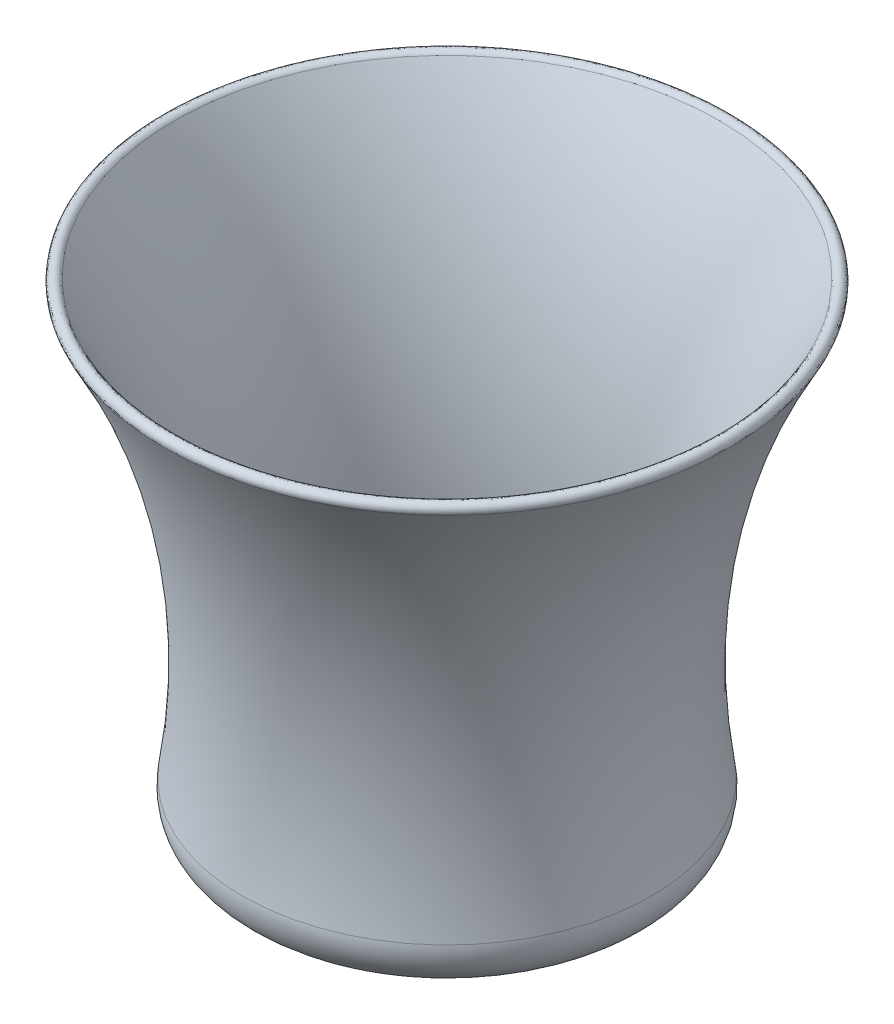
ISO-10303-21;
HEADER;
FILE_DESCRIPTION(('STEP AP214'),'2;1');
FILE_NAME('part.step','',(''),(''),'','','');
FILE_SCHEMA(('AUTOMOTIVE_DESIGN { 1 0 10303 214 1 1 1 1 }'));
ENDSEC;
DATA;
#1=APPLICATION_CONTEXT('core data for automotive mechanical design processes');
#2=APPLICATION_PROTOCOL_DEFINITION('international standard','automotive_design',2000,#1);
#3=PRODUCT_CONTEXT('',#1,'mechanical');
#4=PRODUCT('Part','Part','',(#3));
#5=PRODUCT_RELATED_PRODUCT_CATEGORY('part','',(#4));
#6=PRODUCT_DEFINITION_FORMATION('','',#4);
#7=PRODUCT_DEFINITION_CONTEXT('part definition',#1,'design');
#8=PRODUCT_DEFINITION('design','',#6,#7);
#9=PRODUCT_DEFINITION_SHAPE('','',#8);
#10=(LENGTH_UNIT() NAMED_UNIT(*) SI_UNIT(.MILLI.,.METRE.));
#11=(NAMED_UNIT(*) PLANE_ANGLE_UNIT() SI_UNIT($,.RADIAN.));
#12=(NAMED_UNIT(*) SI_UNIT($,.STERADIAN.) SOLID_ANGLE_UNIT());
#13=UNCERTAINTY_MEASURE_WITH_UNIT(LENGTH_MEASURE(1.E-05),#10,'distance_accuracy_value','');
#14=(GEOMETRIC_REPRESENTATION_CONTEXT(3) GLOBAL_UNCERTAINTY_ASSIGNED_CONTEXT((#13)) GLOBAL_UNIT_ASSIGNED_CONTEXT((#10,
#11,#12)) REPRESENTATION_CONTEXT('',''));
#15=CARTESIAN_POINT('',(0.,0.,0.));
#16=DIRECTION('',(0.,0.,1.));
#17=DIRECTION('',(1.,0.,0.));
#18=AXIS2_PLACEMENT_3D('',#15,#16,#17);
#19=CARTESIAN_POINT('',(0.,3.81,-29.0828482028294));
#20=CARTESIAN_POINT('',(1.90346796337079,3.81,-29.0828482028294));
#21=CARTESIAN_POINT('',(3.80688886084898,3.81,-28.8953776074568));
#22=CARTESIAN_POINT('',(7.54067558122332,3.81,-28.1526812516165));
#23=CARTESIAN_POINT('',(9.37094908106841,3.81,-27.597473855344));
#24=CARTESIAN_POINT('',(12.8880992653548,3.81,-26.1406225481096));
#25=CARTESIAN_POINT('',(14.5748889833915,3.81,-25.2390146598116));
#26=CARTESIAN_POINT('',(17.7402405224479,3.81,-23.1239943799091));
#27=CARTESIAN_POINT('',(19.2187240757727,3.81,-21.9106342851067));
#28=CARTESIAN_POINT('',(21.9106342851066,3.81,-19.2187240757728));
#29=CARTESIAN_POINT('',(23.1239943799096,3.81,-17.7402405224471));
#30=CARTESIAN_POINT('',(25.2390146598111,3.81,-14.5748889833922));
#31=CARTESIAN_POINT('',(26.1406225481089,3.81,-12.8880992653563));
#32=CARTESIAN_POINT('',(27.5974738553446,3.81,-9.37094908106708));
#33=CARTESIAN_POINT('',(28.1526812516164,3.81,-7.54067558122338));
#34=CARTESIAN_POINT('',(28.8953776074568,3.81,-3.80688886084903));
#35=CARTESIAN_POINT('',(29.0828482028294,3.81,-1.90346796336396));
#36=CARTESIAN_POINT('',(29.0828482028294,3.81,1.90346796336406));
#37=CARTESIAN_POINT('',(28.8953776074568,3.81,3.80688886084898));
#38=CARTESIAN_POINT('',(28.1526812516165,3.81,7.54067558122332));
#39=CARTESIAN_POINT('',(27.5974738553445,3.81,9.37094908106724));
#40=CARTESIAN_POINT('',(26.1406225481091,3.81,12.888099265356));
#41=CARTESIAN_POINT('',(25.2390146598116,3.81,14.5748889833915));
#42=CARTESIAN_POINT('',(23.1239943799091,3.81,17.7402405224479));
#43=CARTESIAN_POINT('',(21.910634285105,3.81,19.2187240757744));
#44=CARTESIAN_POINT('',(19.2187240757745,3.81,21.9106342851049));
#45=CARTESIAN_POINT('',(17.7402405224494,3.81,23.1239943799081));
#46=CARTESIAN_POINT('',(14.57488898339,3.81,25.2390146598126));
#47=CARTESIAN_POINT('',(12.8880992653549,3.81,26.1406225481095));
#48=CARTESIAN_POINT('',(9.37094908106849,3.81,27.597473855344));
#49=CARTESIAN_POINT('',(7.54067558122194,3.81,28.1526812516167));
#50=CARTESIAN_POINT('',(3.80688886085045,3.81,28.8953776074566));
#51=CARTESIAN_POINT('',(1.90346796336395,3.81,29.0828482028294));
#52=CARTESIAN_POINT('',(-1.90346796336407,3.81,29.0828482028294));
#53=CARTESIAN_POINT('',(-3.80688886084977,3.81,28.8953776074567));
#54=CARTESIAN_POINT('',(-7.54067558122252,3.81,28.1526812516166));
#55=CARTESIAN_POINT('',(-9.37094908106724,3.81,27.5974738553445));
#56=CARTESIAN_POINT('',(-12.888099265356,3.81,26.1406225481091));
#57=CARTESIAN_POINT('',(-14.5748889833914,3.81,25.2390146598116));
#58=CARTESIAN_POINT('',(-17.7402405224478,3.81,23.1239943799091));
#59=CARTESIAN_POINT('',(-19.2187240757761,3.81,21.9106342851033));
#60=CARTESIAN_POINT('',(-21.9106342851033,3.81,19.218724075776));
#61=CARTESIAN_POINT('',(-23.1239943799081,3.81,17.7402405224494));
#62=CARTESIAN_POINT('',(-25.2390146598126,3.81,14.57488898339));
#63=CARTESIAN_POINT('',(-26.1406225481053,3.81,12.8880992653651));
#64=CARTESIAN_POINT('',(-27.5974738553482,3.81,9.3709490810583));
#65=CARTESIAN_POINT('',(-28.1526812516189,3.81,7.54067558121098));
#66=CARTESIAN_POINT('',(-28.8953776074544,3.81,3.80688886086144));
#67=CARTESIAN_POINT('',(-29.0828482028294,3.81,1.90346796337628));
#68=CARTESIAN_POINT('',(-29.0828482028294,3.81,-1.90346796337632));
#69=CARTESIAN_POINT('',(-28.895377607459,3.81,-3.80688886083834));
#70=CARTESIAN_POINT('',(-28.1526812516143,3.81,-7.54067558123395));
#71=CARTESIAN_POINT('',(-27.5974738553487,3.81,-9.3709490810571));
#72=CARTESIAN_POINT('',(-26.1406225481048,3.81,-12.8880992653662));
#73=CARTESIAN_POINT('',(-25.2390146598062,3.81,-14.5748889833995));
#74=CARTESIAN_POINT('',(-23.1239943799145,3.81,-17.7402405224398));
#75=CARTESIAN_POINT('',(-21.9106342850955,3.81,-19.2187240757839));
#76=CARTESIAN_POINT('',(-19.2187240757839,3.81,-21.9106342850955));
#77=CARTESIAN_POINT('',(-17.7402405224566,3.81,-23.1239943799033));
#78=CARTESIAN_POINT('',(-14.5748889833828,3.81,-25.2390146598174));
#79=CARTESIAN_POINT('',(-12.8880992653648,3.81,-26.1406225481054));
#80=CARTESIAN_POINT('',(-9.37094908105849,3.81,-27.5974738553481));
#81=CARTESIAN_POINT('',(-7.54067558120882,3.81,-28.1526812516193));
#82=CARTESIAN_POINT('',(-3.80688886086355,3.81,-28.8953776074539));
#83=CARTESIAN_POINT('',(-1.90346796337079,3.81,-29.0828482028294));
#84=CARTESIAN_POINT('',(0.,3.81,-29.0828482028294));
#85=CARTESIAN_POINT('',(0.,0.,-29.0828482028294));
#86=CARTESIAN_POINT('',(1.90346796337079,0.,-29.0828482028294));
#87=CARTESIAN_POINT('',(3.80688886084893,0.,-28.8953776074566));
#88=CARTESIAN_POINT('',(7.54067558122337,0.,-28.1526812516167));
#89=CARTESIAN_POINT('',(9.37094908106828,0.,-27.5974738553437));
#90=CARTESIAN_POINT('',(12.8880992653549,0.,-26.1406225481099));
#91=CARTESIAN_POINT('',(14.5748889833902,0.,-25.2390146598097));
#92=CARTESIAN_POINT('',(17.7402405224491,0.,-23.123994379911));
#93=CARTESIAN_POINT('',(19.2187240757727,0.,-21.9106342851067));
#94=CARTESIAN_POINT('',(21.9106342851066,0.,-19.2187240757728));
#95=CARTESIAN_POINT('',(23.1239943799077,0.,-17.7402405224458));
#96=CARTESIAN_POINT('',(25.239014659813,0.,-14.5748889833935));
#97=CARTESIAN_POINT('',(26.1406225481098,0.,-12.8880992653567));
#98=CARTESIAN_POINT('',(27.5974738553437,0.,-9.3709490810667));
#99=CARTESIAN_POINT('',(28.1526812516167,0.,-7.54067558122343));
#100=CARTESIAN_POINT('',(28.8953776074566,0.,-3.80688886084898));
#101=CARTESIAN_POINT('',(29.0828482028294,0.,-1.90346796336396));
#102=CARTESIAN_POINT('',(29.0828482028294,0.,1.90346796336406));
#103=CARTESIAN_POINT('',(28.8953776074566,0.,3.80688886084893));
#104=CARTESIAN_POINT('',(28.1526812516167,0.,7.54067558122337));
#105=CARTESIAN_POINT('',(27.597473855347,0.,9.37094908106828));
#106=CARTESIAN_POINT('',(26.1406225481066,0.,12.8880992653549));
#107=CARTESIAN_POINT('',(25.2390146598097,0.,14.5748889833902));
#108=CARTESIAN_POINT('',(23.123994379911,0.,17.7402405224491));
#109=CARTESIAN_POINT('',(21.9106342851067,0.,19.218724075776));
#110=CARTESIAN_POINT('',(19.2187240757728,0.,21.9106342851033));
#111=CARTESIAN_POINT('',(17.7402405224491,0.,23.1239943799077));
#112=CARTESIAN_POINT('',(14.5748889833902,0.,25.239014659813));
#113=CARTESIAN_POINT('',(12.888099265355,0.,26.1406225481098));
#114=CARTESIAN_POINT('',(9.37094908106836,0.,27.5974738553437));
#115=CARTESIAN_POINT('',(7.54067558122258,0.,28.15268125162));
#116=CARTESIAN_POINT('',(3.8068888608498,0.,28.8953776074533));
#117=CARTESIAN_POINT('',(1.90346796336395,0.,29.0828482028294));
#118=CARTESIAN_POINT('',(-1.90346796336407,0.,29.0828482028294));
#119=CARTESIAN_POINT('',(-3.80688886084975,0.,28.8953776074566));
#120=CARTESIAN_POINT('',(-7.54067558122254,0.,28.1526812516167));
#121=CARTESIAN_POINT('',(-9.37094908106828,0.,27.597473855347));
#122=CARTESIAN_POINT('',(-12.8880992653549,0.,26.1406225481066));
#123=CARTESIAN_POINT('',(-14.5748889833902,0.,25.2390146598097));
#124=CARTESIAN_POINT('',(-17.7402405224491,0.,23.123994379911));
#125=CARTESIAN_POINT('',(-19.2187240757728,0.,21.9106342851));
#126=CARTESIAN_POINT('',(-21.9106342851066,0.,19.2187240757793));
#127=CARTESIAN_POINT('',(-23.1239943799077,0.,17.7402405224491));
#128=CARTESIAN_POINT('',(-25.239014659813,0.,14.5748889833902));
#129=CARTESIAN_POINT('',(-26.1406225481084,0.,12.8880992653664));
#130=CARTESIAN_POINT('',(-27.5974738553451,0.,9.370949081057));
#131=CARTESIAN_POINT('',(-28.1526812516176,0.,7.54067558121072));
#132=CARTESIAN_POINT('',(-28.8953776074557,0.,3.8068888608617));
#133=CARTESIAN_POINT('',(-29.0828482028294,0.,1.90346796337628));
#134=CARTESIAN_POINT('',(-29.0828482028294,0.,-1.90346796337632));
#135=CARTESIAN_POINT('',(-28.8953776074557,0.,-3.8068888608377));
#136=CARTESIAN_POINT('',(-28.1526812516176,0.,-7.5406755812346));
#137=CARTESIAN_POINT('',(-27.5974738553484,0.,-9.37094908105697));
#138=CARTESIAN_POINT('',(-26.1406225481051,0.,-12.8880992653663));
#139=CARTESIAN_POINT('',(-25.2390146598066,0.,-14.5748889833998));
#140=CARTESIAN_POINT('',(-23.1239943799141,0.,-17.7402405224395));
#141=CARTESIAN_POINT('',(-21.9106342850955,0.,-19.2187240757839));
#142=CARTESIAN_POINT('',(-19.2187240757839,0.,-21.9106342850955));
#143=CARTESIAN_POINT('',(-17.7402405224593,0.,-23.1239943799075));
#144=CARTESIAN_POINT('',(-14.57488898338,0.,-25.2390146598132));
#145=CARTESIAN_POINT('',(-12.8880992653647,0.,-26.1406225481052));
#146=CARTESIAN_POINT('',(-9.3709490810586,0.,-27.5974738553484));
#147=CARTESIAN_POINT('',(-7.54067558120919,0.,-28.1526812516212));
#148=CARTESIAN_POINT('',(-3.80688886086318,0.,-28.8953776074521));
#149=CARTESIAN_POINT('',(-1.90346796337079,0.,-29.0828482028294));
#150=CARTESIAN_POINT('',(0.,0.,-29.0828482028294));
#151=CARTESIAN_POINT('',(0.,0.,-32.8928482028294));
#152=CARTESIAN_POINT('',(2.15283188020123,0.,-32.8928482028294));
#153=CARTESIAN_POINT('',(4.30561052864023,0.,-32.680818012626));
#154=CARTESIAN_POINT('',(8.52854216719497,0.,-31.8408246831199));
#155=CARTESIAN_POINT('',(10.5985907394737,0.,-31.2128823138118));
#156=CARTESIAN_POINT('',(14.5765053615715,0.,-29.5651761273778));
#157=CARTESIAN_POINT('',(16.4842730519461,0.,-28.5454530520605));
#158=CARTESIAN_POINT('',(20.0643016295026,0.,-26.1533544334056));
#159=CARTESIAN_POINT('',(21.7364739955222,0.,-24.781038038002));
#160=CARTESIAN_POINT('',(24.7810380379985,0.,-21.736473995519));
#161=CARTESIAN_POINT('',(26.153354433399,0.,-20.0643016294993));
#162=CARTESIAN_POINT('',(28.5454530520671,0.,-16.4842730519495));
#163=CARTESIAN_POINT('',(29.5651761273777,0.,-14.5765053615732));
#164=CARTESIAN_POINT('',(31.2128823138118,0.,-10.5985907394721));
#165=CARTESIAN_POINT('',(31.8408246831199,0.,-8.52854216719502));
#166=CARTESIAN_POINT('',(32.680818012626,0.,-4.30561052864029));
#167=CARTESIAN_POINT('',(32.8928482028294,0.,-2.15283188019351));
#168=CARTESIAN_POINT('',(32.8928482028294,0.,2.15283188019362));
#169=CARTESIAN_POINT('',(32.680818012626,0.,4.30561052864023));
#170=CARTESIAN_POINT('',(31.8408246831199,0.,8.52854216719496));
#171=CARTESIAN_POINT('',(31.2128823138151,0.,10.5985907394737));
#172=CARTESIAN_POINT('',(29.5651761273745,0.,14.5765053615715));
#173=CARTESIAN_POINT('',(28.5454530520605,0.,16.4842730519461));
#174=CARTESIAN_POINT('',(26.1533544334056,0.,20.0643016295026));
#175=CARTESIAN_POINT('',(24.7810380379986,0.,21.7364739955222));
#176=CARTESIAN_POINT('',(21.7364739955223,0.,24.7810380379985));
#177=CARTESIAN_POINT('',(20.0643016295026,0.,26.153354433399));
#178=CARTESIAN_POINT('',(16.4842730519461,0.,28.5454530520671));
#179=CARTESIAN_POINT('',(14.5765053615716,0.,29.5651761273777));
#180=CARTESIAN_POINT('',(10.5985907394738,0.,31.2128823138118));
#181=CARTESIAN_POINT('',(8.52854216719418,0.,31.8408246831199));
#182=CARTESIAN_POINT('',(4.3056105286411,0.,32.680818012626));
#183=CARTESIAN_POINT('',(2.15283188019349,0.,32.8928482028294));
#184=CARTESIAN_POINT('',(-2.15283188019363,0.,32.8928482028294));
#185=CARTESIAN_POINT('',(-4.30561052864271,0.,32.680818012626));
#186=CARTESIAN_POINT('',(-8.52854216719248,0.,31.8408246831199));
#187=CARTESIAN_POINT('',(-10.5985907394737,0.,31.2128823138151));
#188=CARTESIAN_POINT('',(-14.5765053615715,0.,29.5651761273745));
#189=CARTESIAN_POINT('',(-16.4842730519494,0.,28.5454530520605));
#190=CARTESIAN_POINT('',(-20.0643016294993,0.,26.1533544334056));
#191=CARTESIAN_POINT('',(-21.736473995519,0.,24.7810380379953));
#192=CARTESIAN_POINT('',(-24.7810380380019,0.,21.7364739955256));
#193=CARTESIAN_POINT('',(-26.1533544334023,0.,20.0643016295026));
#194=CARTESIAN_POINT('',(-28.5454530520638,0.,16.4842730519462));
#195=CARTESIAN_POINT('',(-29.5651761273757,0.,14.5765053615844));
#196=CARTESIAN_POINT('',(-31.2128823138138,0.,10.5985907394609));
#197=CARTESIAN_POINT('',(-31.8408246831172,0.,8.52854216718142));
#198=CARTESIAN_POINT('',(-32.6808180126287,0.,4.30561052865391));
#199=CARTESIAN_POINT('',(-32.8928482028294,0.,2.15283188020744));
#200=CARTESIAN_POINT('',(-32.8928482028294,0.,-2.15283188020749));
#201=CARTESIAN_POINT('',(-32.6808180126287,0.,-4.30561052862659));
#202=CARTESIAN_POINT('',(-31.8408246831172,0.,-8.52854216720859));
#203=CARTESIAN_POINT('',(-31.2128823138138,0.,-10.5985907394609));
#204=CARTESIAN_POINT('',(-29.5651761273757,0.,-14.5765053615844));
#205=CARTESIAN_POINT('',(-28.5454530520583,0.,-16.4842730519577));
#206=CARTESIAN_POINT('',(-26.1533544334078,0.,-20.064301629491));
#207=CARTESIAN_POINT('',(-24.7810380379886,0.,-21.7364739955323));
#208=CARTESIAN_POINT('',(-21.7364739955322,0.,-24.7810380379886));
#209=CARTESIAN_POINT('',(-20.0643016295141,0.,-26.1533544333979));
#210=CARTESIAN_POINT('',(-16.4842730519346,0.,-28.5454530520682));
#211=CARTESIAN_POINT('',(-14.5765053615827,0.,-29.5651761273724));
#212=CARTESIAN_POINT('',(-10.5985907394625,0.,-31.2128823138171));
#213=CARTESIAN_POINT('',(-8.52854216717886,0.,-31.8408246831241));
#214=CARTESIAN_POINT('',(-4.30561052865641,0.,-32.6808180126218));
#215=CARTESIAN_POINT('',(-2.15283188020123,0.,-32.8928482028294));
#216=CARTESIAN_POINT('',(0.,0.,-32.8928482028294));
#217=(BOUNDED_SURFACE() B_SPLINE_SURFACE(2,3,((#19,#20,#21,#22,#23,#24,#25,#26,#27,#28,#29,#30,
#31,#32,#33,#34,#35,#36,#37,#38,#39,#40,#41,#42,#43,#44,#45,#46,#47,#48,#49,#50,#51,#52,#53,#54,
#55,#56,#57,#58,#59,#60,#61,#62,#63,#64,#65,#66,#67,#68,#69,#70,#71,#72,#73,#74,#75,#76,#77,#78,
#79,#80,#81,#82,#83,#84),(#85,#86,#87,#88,#89,#90,#91,#92,#93,#94,#95,#96,#97,#98,#99,#100,#101,
#102,#103,#104,#105,#106,#107,#108,#109,#110,#111,#112,#113,#114,#115,#116,#117,#118,#119,#120,
#121,#122,#123,#124,#125,#126,#127,#128,#129,#130,#131,#132,#133,#134,#135,#136,#137,#138,#139,
#140,#141,#142,#143,#144,#145,#146,#147,#148,#149,#150),(#151,#152,#153,#154,#155,#156,#157,
#158,#159,#160,#161,#162,#163,#164,#165,#166,#167,#168,#169,#170,#171,#172,#173,#174,#175,#176,
#177,#178,#179,#180,#181,#182,#183,#184,#185,#186,#187,#188,#189,#190,#191,#192,#193,#194,#195,
#196,#197,#198,#199,#200,#201,#202,#203,#204,#205,#206,#207,#208,#209,#210,#211,#212,#213,#214,
#215,#216)),.UNSPECIFIED.,.F.,.T.,.F.) B_SPLINE_SURFACE_WITH_KNOTS((3,3),(4,2,2,2,2,2,2,2,2,2,2,
2,2,2,2,2,2,2,2,2,2,2,2,2,2,2,2,2,2,2,2,2,4),(0.,1.),(-6.28318530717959,-6.08683576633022,
-5.89048622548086,-5.6941366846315,-5.49778714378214,-5.30143760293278,-5.10508806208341,
-4.90873852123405,-4.71238898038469,-4.51603943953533,-4.31968989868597,-4.1233403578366,
-3.92699081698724,-3.73064127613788,-3.53429173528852,-3.33794219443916,-3.14159265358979,
-2.94524311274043,-2.74889357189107,-2.55254403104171,-2.35619449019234,-2.15984494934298,
-1.96349540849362,-1.76714586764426,-1.5707963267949,-1.37444678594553,-1.17809724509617,
-0.98174770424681,-0.785398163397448,-0.589048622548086,-0.392699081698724,-0.196349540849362,
0.),.UNSPECIFIED.) GEOMETRIC_REPRESENTATION_ITEM() RATIONAL_B_SPLINE_SURFACE(((1.,1.,1.,1.,1.,
1.,1.,1.,1.,1.,1.,1.,1.,1.,1.,1.,1.,1.,1.,1.,1.,1.,1.,1.,1.,1.,1.,1.,1.,1.,1.,1.,1.,1.,1.,1.,1.,
1.,1.,1.,1.,1.,1.,1.,1.,1.,1.,1.,1.,1.,1.,1.,1.,1.,1.,1.,1.,1.,1.,1.,1.,1.,1.,1.,1.,1.),
(0.707106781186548,0.707106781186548,0.707106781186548,0.707106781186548,0.707106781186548,
0.707106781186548,0.707106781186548,0.707106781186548,0.707106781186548,0.707106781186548,
0.707106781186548,0.707106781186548,0.707106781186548,0.707106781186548,0.707106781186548,
0.707106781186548,0.707106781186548,0.707106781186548,0.707106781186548,0.707106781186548,
0.707106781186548,0.707106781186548,0.707106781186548,0.707106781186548,0.707106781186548,
0.707106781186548,0.707106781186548,0.707106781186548,0.707106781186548,0.707106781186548,
0.707106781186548,0.707106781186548,0.707106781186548,0.707106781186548,0.707106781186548,
0.707106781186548,0.707106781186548,0.707106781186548,0.707106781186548,0.707106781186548,
0.707106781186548,0.707106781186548,0.707106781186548,0.707106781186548,0.707106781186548,
0.707106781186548,0.707106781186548,0.707106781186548,0.707106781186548,0.707106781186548,
0.707106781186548,0.707106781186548,0.707106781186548,0.707106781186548,0.707106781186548,
0.707106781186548,0.707106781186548,0.707106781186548,0.707106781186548,0.707106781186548,
0.707106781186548,0.707106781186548,0.707106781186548,0.707106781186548,0.707106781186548,
0.707106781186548),(1.,1.,1.,1.,1.,1.,1.,1.,1.,1.,1.,1.,1.,1.,1.,1.,1.,1.,1.,1.,1.,1.,1.,1.,1.,
1.,1.,1.,1.,1.,1.,1.,1.,1.,1.,1.,1.,1.,1.,1.,1.,1.,1.,1.,1.,1.,1.,1.,1.,1.,1.,1.,1.,1.,1.,1.,1.,
1.,1.,1.,1.,1.,1.,1.,1.,1.))) REPRESENTATION_ITEM('') SURFACE());
#218=CARTESIAN_POINT('',(4.38154962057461,1.90499850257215,-29.2670685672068));
#219=CARTESIAN_POINT('',(4.21877127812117,3.81,-28.1793289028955));
#220=CARTESIAN_POINT('',(3.89321433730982,3.81,-26.003847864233));
#221=CARTESIAN_POINT('',(3.55901934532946,1.9049973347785,-29.390155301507));
#222=CARTESIAN_POINT('',(3.42680896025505,3.81,-28.2978410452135));
#223=CARTESIAN_POINT('',(3.16238807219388,3.81,-26.1132094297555));
#224=CARTESIAN_POINT('',(2.73128795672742,1.90499691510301,-29.4785779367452));
#225=CARTESIAN_POINT('',(2.62976114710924,3.81,-28.3829872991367));
#226=CARTESIAN_POINT('',(2.4267069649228,3.81,-26.1918024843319));
#227=CARTESIAN_POINT('',(1.48643081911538,1.90499832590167,-29.5587982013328));
#228=CARTESIAN_POINT('',(1.43111598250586,3.81,-28.4602296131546));
#229=CARTESIAN_POINT('',(1.32048620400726,3.81,-26.263090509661));
#230=CARTESIAN_POINT('',(1.07088823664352,1.90499913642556,-29.5768017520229));
#231=CARTESIAN_POINT('',(1.03101033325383,3.81,-28.4775633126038));
#232=CARTESIAN_POINT('',(0.951254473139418,3.81,-26.2790854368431));
#233=CARTESIAN_POINT('',(0.23916628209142,1.90499997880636,-29.5952446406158));
#234=CARTESIAN_POINT('',(0.230247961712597,3.81,-28.4953200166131));
#235=CARTESIAN_POINT('',(0.212411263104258,3.81,-26.2954707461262));
#236=CARTESIAN_POINT('',(-0.177013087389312,1.90500001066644,-29.5956840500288));
#237=CARTESIAN_POINT('',(-0.170408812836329,3.81,-28.4957430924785));
#238=CARTESIAN_POINT('',(-0.157200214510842,3.81,-26.2958611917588));
#239=CARTESIAN_POINT('',(-1.00880405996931,1.90499924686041,-29.5789882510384));
#240=CARTESIAN_POINT('',(-0.971235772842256,3.81,-28.4796683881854));
#241=CARTESIAN_POINT('',(-0.896099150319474,3.81,-26.2810277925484));
#242=CARTESIAN_POINT('',(-1.42441566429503,1.90499845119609,-29.561853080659));
#243=CARTESIAN_POINT('',(-1.371406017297,3.81,-28.4631706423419));
#244=CARTESIAN_POINT('',(-1.26538660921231,3.81,-26.2658039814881));
#245=CARTESIAN_POINT('',(-2.2544849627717,1.90499740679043,-29.5101136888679));
#246=CARTESIAN_POINT('',(-2.17065590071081,3.81,-28.41335274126));
#247=CARTESIAN_POINT('',(-2.00299748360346,3.81,-26.2198278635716));
#248=CARTESIAN_POINT('',(-2.66894265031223,1.90499715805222,-29.4755093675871));
#249=CARTESIAN_POINT('',(-2.56973549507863,3.81,-28.3800324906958));
#250=CARTESIAN_POINT('',(-2.3713208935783,3.81,-26.1890754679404));
#251=CARTESIAN_POINT('',(-3.49604017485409,1.90499735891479,-29.3888946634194));
#252=CARTESIAN_POINT('',(-3.3661429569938,3.81,-28.296631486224));
#253=CARTESIAN_POINT('',(-3.10634817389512,3.81,-26.1121021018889));
#254=CARTESIAN_POINT('',(-3.90868001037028,1.90499780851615,-29.3368842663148));
#255=CARTESIAN_POINT('',(-3.76347077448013,3.81,-28.2465507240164));
#256=CARTESIAN_POINT('',(-3.47305204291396,3.81,-26.0658811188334));
#257=CARTESIAN_POINT('',(-4.73153032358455,1.90499901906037,-29.2155112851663));
#258=CARTESIAN_POINT('',(-4.55574833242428,3.81,-28.129687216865));
#259=CARTESIAN_POINT('',(-4.20418420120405,3.81,-25.9580379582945));
#260=CARTESIAN_POINT('',(-5.14174081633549,1.90499978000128,-29.1461488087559));
#261=CARTESIAN_POINT('',(-4.95069806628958,3.81,-28.0629045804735));
#262=CARTESIAN_POINT('',(-4.56861250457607,3.81,-25.8964158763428));
#263=CARTESIAN_POINT('',(-5.95918781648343,1.9050000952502,-28.9900737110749));
#264=CARTESIAN_POINT('',(-5.7377049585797,3.80999999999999,-27.912641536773));
#265=CARTESIAN_POINT('',(-5.29473930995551,3.81,-25.7577772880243));
#266=CARTESIAN_POINT('',(-6.36642262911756,1.9049996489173,-28.9033518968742));
#267=CARTESIAN_POINT('',(-6.12976055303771,3.81,-27.8291522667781));
#268=CARTESIAN_POINT('',(-5.65643625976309,3.81,-25.6807526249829));
#269=CARTESIAN_POINT('',(-7.17662906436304,1.90499849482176,-28.7128643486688));
#270=CARTESIAN_POINT('',(-6.90982828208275,3.81,-27.6457504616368));
#271=CARTESIAN_POINT('',(-6.37622624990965,3.81,-25.5115210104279));
#272=CARTESIAN_POINT('',(-7.57960066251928,1.90499778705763,-28.6090985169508));
#273=CARTESIAN_POINT('',(-7.2978404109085,3.81,-27.5458378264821));
#274=CARTESIAN_POINT('',(-6.7343192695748,3.81,-25.4193139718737));
#275=CARTESIAN_POINT('',(-8.78138294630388,1.90499691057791,-28.272504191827));
#276=CARTESIAN_POINT('',(-8.45503031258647,3.81,-27.2217325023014));
#277=CARTESIAN_POINT('',(-7.80232380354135,3.81,-25.1201857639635));
#278=CARTESIAN_POINT('',(-9.57324559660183,1.90499798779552,-28.0143435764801));
#279=CARTESIAN_POINT('',(-9.21753882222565,3.81,-26.9731385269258));
#280=CARTESIAN_POINT('',(-8.50612469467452,3.81,-24.8907261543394));
#281=CARTESIAN_POINT('',(-10.7428292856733,1.90499956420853,-27.5776501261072));
#282=CARTESIAN_POINT('',(-10.3436126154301,3.81,-26.552691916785));
#283=CARTESIAN_POINT('',(-9.54517913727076,3.81,-24.5027750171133));
#284=CARTESIAN_POINT('',(-11.1296981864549,1.90500008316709,-27.4238233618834));
#285=CARTESIAN_POINT('',(-10.7160634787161,3.81,-26.4045976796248));
#286=CARTESIAN_POINT('',(-9.88879405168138,3.81,-24.3661464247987));
#287=CARTESIAN_POINT('',(-11.8965021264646,1.90499981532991,-27.0999805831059));
#288=CARTESIAN_POINT('',(-11.4543142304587,3.81,-26.0928135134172));
#289=CARTESIAN_POINT('',(-10.5699383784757,3.81,-24.0784791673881));
#290=CARTESIAN_POINT('',(-12.276437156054,1.90499902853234,-26.9299645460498));
#291=CARTESIAN_POINT('',(-11.8201141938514,3.81,-25.929123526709));
#292=CARTESIAN_POINT('',(-10.9074677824,3.81,-23.9274404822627));
#293=CARTESIAN_POINT('',(-13.4048335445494,1.90499728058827,-26.3961902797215));
#294=CARTESIAN_POINT('',(-12.906579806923,3.81,-25.4151837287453));
#295=CARTESIAN_POINT('',(-11.9100706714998,3.81,-23.4531679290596));
#296=CARTESIAN_POINT('',(-14.1420617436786,1.90499693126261,-26.0086402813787));
#297=CARTESIAN_POINT('',(-13.6164798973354,3.81000000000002,-25.042001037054));
#298=CARTESIAN_POINT('',(-12.5653147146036,3.81,-23.1087193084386));
#299=CARTESIAN_POINT('',(-15.2213415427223,1.90499838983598,-25.3819436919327));
#300=CARTESIAN_POINT('',(-14.6556914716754,3.81000000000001,-24.438570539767));
#301=CARTESIAN_POINT('',(-13.524390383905,3.81,-22.5518226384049));
#302=CARTESIAN_POINT('',(-15.5766797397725,1.90499920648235,-25.1654791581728));
#303=CARTESIAN_POINT('',(-14.9978273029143,3.81,-24.2301474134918));
#304=CARTESIAN_POINT('',(-13.8401219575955,3.81,-22.359483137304));
#305=CARTESIAN_POINT('',(-16.2780944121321,1.90500000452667,-24.7175955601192));
#306=CARTESIAN_POINT('',(-15.6731316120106,3.81,-23.7989367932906));
#307=CARTESIAN_POINT('',(-14.4632060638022,3.81,-21.9616192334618));
#308=CARTESIAN_POINT('',(-16.6241709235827,1.90499998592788,-24.4861765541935));
#309=CARTESIAN_POINT('',(-16.0063001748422,3.81,-23.5761493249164));
#310=CARTESIAN_POINT('',(-14.7705586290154,3.81,-21.7560948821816));
#311=CARTESIAN_POINT('',(-17.3060569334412,1.90499917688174,-24.0090519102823));
#312=CARTESIAN_POINT('',(-16.6628036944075,3.81,-23.1167846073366));
#313=CARTESIAN_POINT('',(-15.3762966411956,3.81,-21.3322492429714));
#314=CARTESIAN_POINT('',(-17.6418664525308,1.90499838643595,-23.7633463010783));
#315=CARTESIAN_POINT('',(-16.9861387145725,3.81,-22.880207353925));
#316=CARTESIAN_POINT('',(-15.6746821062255,3.81,-21.1139279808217));
#317=CARTESIAN_POINT('',(-18.3027991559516,1.90499737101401,-23.2580540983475));
#318=CARTESIAN_POINT('',(-17.6225336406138,3.81,-22.3936752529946));
#319=CARTESIAN_POINT('',(-16.2620006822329,3.81,-20.6649152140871));
#320=CARTESIAN_POINT('',(-18.6279222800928,1.90499714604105,-22.9984674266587));
#321=CARTESIAN_POINT('',(-17.9355934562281,3.81,-22.1437203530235));
#322=CARTESIAN_POINT('',(-16.5509337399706,3.81,-20.4342236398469));
#323=CARTESIAN_POINT('',(-19.2669601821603,1.90499739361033,-22.4658380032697));
#324=CARTESIAN_POINT('',(-18.550919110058,3.81,-21.6308544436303));
#325=CARTESIAN_POINT('',(-17.1188350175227,3.81,-19.9608850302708));
#326=CARTESIAN_POINT('',(-19.5808749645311,1.90499786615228,-22.1927952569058));
#327=CARTESIAN_POINT('',(-18.8531849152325,3.81,-21.3679434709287));
#328=CARTESIAN_POINT('',(-17.3978032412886,3.81,-19.7182379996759));
#329=CARTESIAN_POINT('',(-20.197022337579,1.90499908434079,-21.6336321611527));
#330=CARTESIAN_POINT('',(-19.4464371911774,3.81,-20.829557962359));
#331=CARTESIAN_POINT('',(-17.9452662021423,3.81,-19.2214087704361));
#332=CARTESIAN_POINT('',(-20.4992550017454,1.90499982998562,-21.347511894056));
#333=CARTESIAN_POINT('',(-19.7374237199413,3.81,-20.5540835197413));
#334=CARTESIAN_POINT('',(-18.213761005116,3.81,-18.9672266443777));
#335=CARTESIAN_POINT('',(-21.091410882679,1.90500008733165,-20.7626733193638));
#336=CARTESIAN_POINT('',(-20.3075284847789,3.81,-19.9910236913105));
#337=CARTESIAN_POINT('',(-18.7397637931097,3.81,-18.4477244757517));
#338=CARTESIAN_POINT('',(-21.3813340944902,1.90499959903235,-20.4639550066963));
#339=CARTESIAN_POINT('',(-20.5866467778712,3.81,-19.7034382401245));
#340=CARTESIAN_POINT('',(-18.9972717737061,3.81,-18.1824044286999));
#341=CARTESIAN_POINT('',(-21.9481599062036,1.90499842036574,-19.8547375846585));
#342=CARTESIAN_POINT('',(-21.1323894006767,3.81,-19.1168805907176));
#343=CARTESIAN_POINT('',(-19.5008470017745,3.81,-17.6411654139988));
#344=CARTESIAN_POINT('',(-22.2250624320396,1.90499772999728,-19.5442384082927));
#345=CARTESIAN_POINT('',(-21.3990136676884,3.81,-18.8179083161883));
#346=CARTESIAN_POINT('',(-19.7469141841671,3.81,-17.365246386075));
#347=CARTESIAN_POINT('',(-23.0355649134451,1.90499692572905,-18.5959450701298));
#348=CARTESIAN_POINT('',(-22.1794428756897,3.81000000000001,-17.9048002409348));
#349=CARTESIAN_POINT('',(-20.467195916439,3.81,-16.5225084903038));
#350=CARTESIAN_POINT('',(-23.5493203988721,1.90499807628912,-17.9409986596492));
#351=CARTESIAN_POINT('',(-22.6741511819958,3.81,-17.2741303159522));
#352=CARTESIAN_POINT('',(-20.9238110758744,3.81,-15.9403921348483));
#353=CARTESIAN_POINT('',(-24.2773427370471,1.90499960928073,-16.9276609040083));
#354=CARTESIAN_POINT('',(-23.3750884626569,3.81,-16.2984946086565));
#355=CARTESIAN_POINT('',(-21.5705795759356,3.81,-15.0401617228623));
#356=CARTESIAN_POINT('',(-24.5129388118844,1.90500008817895,-16.5846888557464));
#357=CARTESIAN_POINT('',(-23.6019029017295,3.81,-15.9683059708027));
#358=CARTESIAN_POINT('',(-21.7798311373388,3.81,-14.7355403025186));
#359=CARTESIAN_POINT('',(-24.9693678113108,1.90499976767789,-15.8891809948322));
#360=CARTESIAN_POINT('',(-24.0413361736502,3.81,-15.2986958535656));
#361=CARTESIAN_POINT('',(-22.1852726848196,3.81,-14.1177254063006));
#362=CARTESIAN_POINT('',(-25.190200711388,1.90499896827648,-15.5366451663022));
#363=CARTESIAN_POINT('',(-24.2539550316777,3.81,-14.9592742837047));
#364=CARTESIAN_POINT('',(-22.3814626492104,3.81,-13.804531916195));
#365=CARTESIAN_POINT('',(-25.8300454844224,1.90499723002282,-14.4656910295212));
#366=CARTESIAN_POINT('',(-24.8700257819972,3.81,-13.9281119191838));
#367=CARTESIAN_POINT('',(-22.9499834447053,3.81,-12.8529523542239));
#368=CARTESIAN_POINT('',(-26.2265142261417,1.90499695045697,-13.7337717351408));
#369=CARTESIAN_POINT('',(-25.2517983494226,3.81,-13.2233251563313));
#370=CARTESIAN_POINT('',(-23.3023635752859,3.81,-12.2024301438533));
#371=CARTESIAN_POINT('',(-26.7739858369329,1.90499845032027,-12.6129299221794));
#372=CARTESIAN_POINT('',(-25.7789436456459,3.81,-12.1440975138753));
#373=CARTESIAN_POINT('',(-23.7888576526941,3.81,-11.206431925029));
#374=CARTESIAN_POINT('',(-26.9486214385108,1.90499927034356,-12.2354450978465));
#375=CARTESIAN_POINT('',(-25.9470894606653,3.81,-11.7806383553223));
#376=CARTESIAN_POINT('',(-23.9440247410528,3.81,-10.8710245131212));
#377=CARTESIAN_POINT('',(-27.2818821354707,1.90500002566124,-11.4732172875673));
#378=CARTESIAN_POINT('',(-26.2679440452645,3.81,-11.0467863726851));
#379=CARTESIAN_POINT('',(-24.2400679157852,3.81,-10.1939245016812));
#380=CARTESIAN_POINT('',(-27.4405072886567,1.90499996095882,-11.0884743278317));
#381=CARTESIAN_POINT('',(-26.4206528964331,3.80999999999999,-10.6763935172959));
#382=CARTESIAN_POINT('',(-24.3809440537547,3.81,-9.85223192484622));
#383=CARTESIAN_POINT('',(-27.7413223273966,1.90499911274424,-10.3127592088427));
#384=CARTESIAN_POINT('',(-26.7102707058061,3.80999999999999,-9.92955155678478));
#385=CARTESIAN_POINT('',(-24.6481664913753,3.81,-9.16313592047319));
#386=CARTESIAN_POINT('',(-27.8835086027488,1.90499832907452,-9.92178570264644));
#387=CARTESIAN_POINT('',(-26.8471762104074,3.81,-9.55310109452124));
#388=CARTESIAN_POINT('',(-24.774509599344,3.81,-8.81573125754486));
#389=CARTESIAN_POINT('',(-28.1512848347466,1.90499734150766,-9.13425232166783));
#390=CARTESIAN_POINT('',(-27.1050118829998,3.81,-8.79480465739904));
#391=CARTESIAN_POINT('',(-25.0124630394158,3.81,-8.1159084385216));
#392=CARTESIAN_POINT('',(-28.2768746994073,1.90499713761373,-8.73769241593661));
#393=CARTESIAN_POINT('',(-27.2259419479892,3.81,-8.41295869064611));
#394=CARTESIAN_POINT('',(-25.1240732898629,3.81,-7.76349025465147));
#395=CARTESIAN_POINT('',(-28.5112589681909,1.90499742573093,-7.93963273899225));
#396=CARTESIAN_POINT('',(-27.4516288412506,3.81,-7.64451185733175));
#397=CARTESIAN_POINT('',(-25.3323657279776,3.81,-7.05426928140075));
#398=CARTESIAN_POINT('',(-28.6200533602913,1.90499791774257,-7.53813296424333));
#399=CARTESIAN_POINT('',(-27.5563856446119,3.81,-7.25791103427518));
#400=CARTESIAN_POINT('',(-25.4290479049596,3.81,-6.69746648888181));
#401=CARTESIAN_POINT('',(-28.820663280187,1.90499913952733,-6.73076476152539));
#402=CARTESIAN_POINT('',(-27.7495405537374,3.81,-6.48054604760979));
#403=CARTESIAN_POINT('',(-25.6072941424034,3.81,-5.98010836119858));
#404=CARTESIAN_POINT('',(-28.9124789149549,1.90499986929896,-6.32489636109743));
#405=CARTESIAN_POINT('',(-27.837938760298,3.81,-6.08978192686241));
#406=CARTESIAN_POINT('',(-25.6888582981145,3.81,-5.61955304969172));
#407=CARTESIAN_POINT('',(-29.0788736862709,1.905000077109,-5.50955977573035));
#408=CARTESIAN_POINT('',(-27.9981371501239,3.81,-5.30480793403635));
#409=CARTESIAN_POINT('',(-25.8366641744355,3.81,-4.8953042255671));
#410=CARTESIAN_POINT('',(-29.1534527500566,1.90499955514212,-5.10009157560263));
#411=CARTESIAN_POINT('',(-28.0699372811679,3.81,-4.91059796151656));
#412=CARTESIAN_POINT('',(-25.9029058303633,3.81,-4.53161069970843));
#413=CARTESIAN_POINT('',(-29.2852453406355,1.90499835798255,-4.27861166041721));
#414=CARTESIAN_POINT('',(-28.1968281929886,3.81,-4.11967028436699));
#415=CARTESIAN_POINT('',(-26.0199920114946,3.81,-3.80178730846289));
#416=CARTESIAN_POINT('',(-29.3424587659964,1.90499768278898,-3.86659993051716));
#417=CARTESIAN_POINT('',(-28.251918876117,3.81,-3.72295255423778));
#418=CARTESIAN_POINT('',(-26.0708364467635,3.81,-3.43565742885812));
#419=CARTESIAN_POINT('',(-29.4880113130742,1.90499694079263,-2.62753828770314));
#420=CARTESIAN_POINT('',(-28.3920704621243,3.81,-2.52986419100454));
#421=CARTESIAN_POINT('',(-26.2001852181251,3.81,-2.33451586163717));
#422=CARTESIAN_POINT('',(-29.5503001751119,1.90499815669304,-1.79727798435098));
#423=CARTESIAN_POINT('',(-28.4520469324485,3.81,-1.73038169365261));
#424=CARTESIAN_POINT('',(-26.255538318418,3.81,-1.59658881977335));
#425=CARTESIAN_POINT('',(-29.5911000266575,1.90499964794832,-0.549724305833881));
#426=CARTESIAN_POINT('',(-28.4913300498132,3.81,-0.529247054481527));
#427=CARTESIAN_POINT('',(-26.2917896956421,3.81,-0.48829249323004));
#428=CARTESIAN_POINT('',(-29.5959205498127,1.90500008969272,-0.133373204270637));
#429=CARTESIAN_POINT('',(-28.4959705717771,3.81,-0.128416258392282));
#430=CARTESIAN_POINT('',(-26.2960707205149,3.81,-0.118502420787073));
#431=CARTESIAN_POINT('',(-29.5879513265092,1.90499972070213,0.699042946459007));
#432=CARTESIAN_POINT('',(-28.4882978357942,3.81,0.673004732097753));
#433=CARTESIAN_POINT('',(-26.2889905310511,3.81,0.620928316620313));
#434=CARTESIAN_POINT('',(-29.5751615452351,1.90499890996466,1.11510799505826));
#435=CARTESIAN_POINT('',(-28.4759845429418,3.81,1.0735950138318));
#436=CARTESIAN_POINT('',(-26.2776292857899,3.81,0.990568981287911));
#437=CARTESIAN_POINT('',(-29.5105100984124,1.90499718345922,2.36178957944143));
#438=CARTESIAN_POINT('',(-28.4137348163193,3.81,2.27395993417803));
#439=CARTESIAN_POINT('',(-26.2201810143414,3.81,2.09830012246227));
#440=CARTESIAN_POINT('',(-29.4323723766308,1.90499697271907,3.19107953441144));
#441=CARTESIAN_POINT('',(-28.3384943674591,3.81,3.07250833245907));
#442=CARTESIAN_POINT('',(-26.1507348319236,3.81,2.8353657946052));
#443=CARTESIAN_POINT('',(-29.2630707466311,1.90499851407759,4.42779856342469));
#444=CARTESIAN_POINT('',(-28.1754789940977,3.81,4.26330737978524));
#445=CARTESIAN_POINT('',(-26.000293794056,3.81,3.93432477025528));
#446=CARTESIAN_POINT('',(-29.1979439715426,1.90499933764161,4.83888202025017));
#447=CARTESIAN_POINT('',(-28.1127714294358,3.81,4.65911441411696));
#448=CARTESIAN_POINT('',(-25.942425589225,3.81,4.29957908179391));
#449=CARTESIAN_POINT('',(-29.0503252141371,1.90500004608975,5.65815329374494));
#450=CARTESIAN_POINT('',(-27.9706486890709,3.81,5.4478850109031));
#451=CARTESIAN_POINT('',(-25.8112956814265,3.81,5.02734851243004));
#452=CARTESIAN_POINT('',(-28.9678332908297,1.90499993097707,6.0663411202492));
#453=CARTESIAN_POINT('',(-27.8912335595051,3.81,5.84084864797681));
#454=CARTESIAN_POINT('',(-25.7380340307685,3.81,5.38986364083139));
#455=CARTESIAN_POINT('',(-28.7857297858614,1.90499904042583,6.87864145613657));
#456=CARTESIAN_POINT('',(-27.7159073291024,3.81,6.62291576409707));
#457=CARTESIAN_POINT('',(-25.5762613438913,3.81,6.11146409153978));
#458=CARTESIAN_POINT('',(-28.6861182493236,1.90499826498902,7.28275397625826));
#459=CARTESIAN_POINT('',(-27.6199962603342,3.81,7.01201929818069));
#460=CARTESIAN_POINT('',(-25.4877503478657,3.81,6.47054942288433));
#461=CARTESIAN_POINT('',(-28.46998291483,1.90499730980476,8.08638057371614));
#462=CARTESIAN_POINT('',(-27.4118849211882,3.81,7.78581347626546));
#463=CARTESIAN_POINT('',(-25.2956859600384,3.81,7.1846783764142));
#464=CARTESIAN_POINT('',(-28.3534590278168,1.90499713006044,8.48589462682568));
#465=CARTESIAN_POINT('',(-27.2996845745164,3.81,8.17050405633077));
#466=CARTESIAN_POINT('',(-25.1921324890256,3.81,7.53972197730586));
#467=CARTESIAN_POINT('',(-28.1037591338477,1.90499746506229,9.27946411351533));
#468=CARTESIAN_POINT('',(-27.0592498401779,3.81,8.93462688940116));
#469=CARTESIAN_POINT('',(-24.9702284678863,3.81,8.24495153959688));
#470=CARTESIAN_POINT('',(-27.9705918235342,1.90499797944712,9.67352227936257));
#471=CARTESIAN_POINT('',(-26.93102384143,3.81,9.31406172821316));
#472=CARTESIAN_POINT('',(-24.8518856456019,3.81,8.59513993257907));
#473=CARTESIAN_POINT('',(-27.6877179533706,1.90499920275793,10.4558226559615));
#474=CARTESIAN_POINT('',(-26.65866325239,3.81,10.0672873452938));
#475=CARTESIAN_POINT('',(-24.6005529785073,3.81,9.29021643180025));
#476=CARTESIAN_POINT('',(-27.538011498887,1.90499991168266,10.8440649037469));
#477=CARTESIAN_POINT('',(-26.5145287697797,3.81,10.4410781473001));
#478=CARTESIAN_POINT('',(-24.4675632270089,3.81,9.63510457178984));
#479=CARTESIAN_POINT('',(-27.2222861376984,1.90500006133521,11.6139238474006));
#480=CARTESIAN_POINT('',(-26.2105609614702,3.81,11.1822677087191));
#481=CARTESIAN_POINT('',(-24.1871106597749,3.81,10.3189554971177));
#482=CARTESIAN_POINT('',(-27.0562672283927,1.90499950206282,11.9955405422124));
#483=CARTESIAN_POINT('',(-26.0507275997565,3.81,11.5496665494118));
#484=CARTESIAN_POINT('',(-24.0396478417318,3.81,10.6579182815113));
#485=CARTESIAN_POINT('',(-26.7083906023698,1.90499828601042,12.7512263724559));
#486=CARTESIAN_POINT('',(-25.7157876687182,3.81,12.2772501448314));
#487=CARTESIAN_POINT('',(-23.7305800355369,3.81,11.3292967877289));
#488=CARTESIAN_POINT('',(-26.5265327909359,1.90499762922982,13.1252954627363));
#489=CARTESIAN_POINT('',(-25.5406810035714,3.81,12.6374348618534));
#490=CARTESIAN_POINT('',(-23.5689749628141,3.81,11.6617124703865));
#491=CARTESIAN_POINT('',(-25.9576162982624,1.90499696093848,14.2354782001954));
#492=CARTESIAN_POINT('',(-24.9928723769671,3.81,13.7064265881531));
#493=CARTESIAN_POINT('',(-23.0633815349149,3.81,12.6483215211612));
#494=CARTESIAN_POINT('',(-25.5471348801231,1.90499825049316,14.9597614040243));
#495=CARTESIAN_POINT('',(-24.597605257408,3.81,14.4038576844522));
#496=CARTESIAN_POINT('',(-22.6985441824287,3.81,13.2920493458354));
#497=CARTESIAN_POINT('',(-24.8865838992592,1.90499969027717,16.0185283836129));
#498=CARTESIAN_POINT('',(-23.9616353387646,3.81,15.4232274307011));
#499=CARTESIAN_POINT('',(-22.111737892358,3.81,14.2326253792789));
#500=CARTESIAN_POINT('',(-24.6589010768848,1.90500008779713,16.3668781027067));
#501=CARTESIAN_POINT('',(-23.7424405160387,3.81,15.7585901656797));
#502=CARTESIAN_POINT('',(-21.9095195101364,3.81,14.5420143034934));
#503=CARTESIAN_POINT('',(-24.1890910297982,1.90499966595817,17.0535358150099));
#504=CARTESIAN_POINT('',(-23.290123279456,3.81,16.4196805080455));
#505=CARTESIAN_POINT('',(-21.4921874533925,3.81,15.1519696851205));
#506=CARTESIAN_POINT('',(-23.9469637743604,1.90499884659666,17.3918437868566));
#507=CARTESIAN_POINT('',(-23.057000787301,3.80999999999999,16.7454081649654));
#508=CARTESIAN_POINT('',(-21.2770737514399,3.81,15.4525361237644));
#509=CARTESIAN_POINT('',(-23.1996996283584,1.90499713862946,18.3907873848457));
#510=CARTESIAN_POINT('',(-22.3374960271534,3.80999999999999,17.7072427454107));
#511=CARTESIAN_POINT('',(-20.6130863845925,3.81,16.3401511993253));
#512=CARTESIAN_POINT('',(-22.6735039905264,1.90499699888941,19.0357251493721));
#513=CARTESIAN_POINT('',(-21.8308068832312,3.81,18.3282729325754));
#514=CARTESIAN_POINT('',(-20.1454098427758,3.81,16.9133664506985));
#515=CARTESIAN_POINT('',(-21.8449962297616,1.90499857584,19.9681934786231));
#516=CARTESIAN_POINT('',(-21.0330644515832,3.81,19.2261155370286));
#517=CARTESIAN_POINT('',(-19.4091996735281,3.81,17.7419585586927));
#518=CARTESIAN_POINT('',(-21.5622569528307,1.90499939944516,20.2732258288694));
#519=CARTESIAN_POINT('',(-20.7608325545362,3.81,19.5198106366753));
#520=CARTESIAN_POINT('',(-19.1579832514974,3.81,18.0129797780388));
#521=CARTESIAN_POINT('',(-20.9839863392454,1.90500006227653,20.8712291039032));
#522=CARTESIAN_POINT('',(-20.2040915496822,3.81,20.0955500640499));
#523=CARTESIAN_POINT('',(-18.644301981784,3.81,18.5441920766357));
#524=CARTESIAN_POINT('',(-20.6884550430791,1.90499990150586,21.1642000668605));
#525=CARTESIAN_POINT('',(-19.9195824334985,3.81,20.3775944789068));
#526=CARTESIAN_POINT('',(-18.3818371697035,3.81,18.8043831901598));
#527=CARTESIAN_POINT('',(-20.0854142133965,1.90499897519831,21.7372888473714));
#528=CARTESIAN_POINT('',(-19.3389845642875,3.81,20.9293543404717));
#529=CARTESIAN_POINT('',(-17.8461244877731,3.81,19.3134844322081));
#530=CARTESIAN_POINT('',(-19.7779028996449,1.90499820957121,22.0174047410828));
#531=CARTESIAN_POINT('',(-19.042894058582,3.81,21.1990679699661));
#532=CARTESIAN_POINT('',(-17.5728750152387,3.81,19.562392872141));
#533=CARTESIAN_POINT('',(-19.1513994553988,1.90499728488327,22.5644214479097));
#534=CARTESIAN_POINT('',(-18.4396472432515,3.81,21.7257794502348));
#535=CARTESIAN_POINT('',(-17.0161408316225,3.81,20.0484930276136));
#536=CARTESIAN_POINT('',(-18.8324072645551,1.90499712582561,22.8313221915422));
#537=CARTESIAN_POINT('',(-18.1324909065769,3.81,21.982777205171));
#538=CARTESIAN_POINT('',(-16.7326560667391,3.81,20.2856846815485));
#539=CARTESIAN_POINT('',(-18.1834725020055,1.90499749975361,23.3514694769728));
#540=CARTESIAN_POINT('',(-17.5076357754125,3.81,22.4836232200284));
#541=CARTESIAN_POINT('',(-16.1559605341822,3.81,20.747928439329));
#542=CARTESIAN_POINT('',(-17.8535300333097,1.90499803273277,23.6047161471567));
#543=CARTESIAN_POINT('',(-17.1899371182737,3.80999999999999,22.7274715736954));
#544=CARTESIAN_POINT('',(-15.8627498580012,3.81,20.9729806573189));
#545=CARTESIAN_POINT('',(-17.1831349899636,1.90499925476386,24.0971767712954));
#546=CARTESIAN_POINT('',(-16.5444602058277,3.81000000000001,23.2016279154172));
#547=CARTESIAN_POINT('',(-15.2671101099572,3.81,21.4105295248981));
#548=CARTESIAN_POINT('',(-16.8426824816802,1.9049999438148,24.3363908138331));
#549=CARTESIAN_POINT('',(-16.2166820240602,3.81000000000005,23.4319359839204));
#550=CARTESIAN_POINT('',(-14.9646810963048,3.81,21.623026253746));
#551=CARTESIAN_POINT('',(-16.151665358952,1.90500004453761,24.8004033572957));
#552=CARTESIAN_POINT('',(-15.5513983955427,3.81000000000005,23.8786686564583));
#553=CARTESIAN_POINT('',(-14.3508644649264,3.81,22.0351993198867));
#554=CARTESIAN_POINT('',(-15.8010932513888,1.90499945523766,25.0251907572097));
#555=CARTESIAN_POINT('',(-15.2138856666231,3.81000000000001,24.0950826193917));
#556=CARTESIAN_POINT('',(-14.0394702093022,3.81,22.2348657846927));
#557=CARTESIAN_POINT('',(-15.090974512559,1.90499822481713,25.4596637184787));
#558=CARTESIAN_POINT('',(-14.530172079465,3.80999999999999,24.5134000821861));
#559=CARTESIAN_POINT('',(-13.4085662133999,3.81,22.6208710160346));
#560=CARTESIAN_POINT('',(-14.7314278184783,1.90499758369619,25.6693491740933));
#561=CARTESIAN_POINT('',(-14.183971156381,3.80999999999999,24.7153034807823));
#562=CARTESIAN_POINT('',(-13.0890564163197,3.81,22.8072096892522));
#563=CARTESIAN_POINT('',(-13.6400159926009,1.90499698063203,26.2754213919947));
#564=CARTESIAN_POINT('',(-13.1330529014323,3.81000000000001,25.2988885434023));
#565=CARTESIAN_POINT('',(-12.1191252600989,3.81,23.3458196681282));
#566=CARTESIAN_POINT('',(-12.8952537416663,1.90499833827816,26.6489081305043));
#567=CARTESIAN_POINT('',(-12.4158997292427,3.81,25.6585258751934));
#568=CARTESIAN_POINT('',(-11.457190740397,3.81,23.6777596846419));
#569=CARTESIAN_POINT('',(-11.7564729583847,1.90499972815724,27.1610158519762));
#570=CARTESIAN_POINT('',(-11.3194981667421,3.81,26.1515773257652));
#571=CARTESIAN_POINT('',(-10.4455484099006,3.81,24.1327000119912));
#572=CARTESIAN_POINT('',(-11.3733588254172,1.90500008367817,27.32366787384));
#573=CARTESIAN_POINT('',(-10.9506681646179,3.81,26.3081646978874));
#574=CARTESIAN_POINT('',(-10.1052869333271,3.81,24.2771584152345));
#575=CARTESIAN_POINT('',(-10.6007310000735,1.90499961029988,27.6325827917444));
#576=CARTESIAN_POINT('',(-10.2068074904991,3.81,26.6055774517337));
#577=CARTESIAN_POINT('',(-9.41896029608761,3.81,24.5515663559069));
#578=CARTESIAN_POINT('',(-10.2112172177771,1.904998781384,27.7788454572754));
#579=CARTESIAN_POINT('',(-9.83177665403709,3.81,26.7464026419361));
#580=CARTESIAN_POINT('',(-9.07289505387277,3.81,24.6815156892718));
#581=CARTESIAN_POINT('',(-9.03420226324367,1.90499710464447,28.1927357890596));
#582=CARTESIAN_POINT('',(-8.69848270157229,3.81,27.1449188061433));
#583=CARTESIAN_POINT('',(-8.027042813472,3.81,25.0492815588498));
#584=CARTESIAN_POINT('',(-8.23791671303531,1.90499706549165,28.4356054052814));
#585=CARTESIAN_POINT('',(-7.93171928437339,3.81,27.3787846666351));
#586=CARTESIAN_POINT('',(-7.31932330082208,3.81,25.265139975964));
#587=CARTESIAN_POINT('',(-7.12992676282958,1.90499849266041,28.7231891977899));
#588=CARTESIAN_POINT('',(-6.86487011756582,3.81,27.6556899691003));
#589=CARTESIAN_POINT('',(-6.33475638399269,3.81,25.5206898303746));
#590=CARTESIAN_POINT('',(-6.82562041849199,1.90499903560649,28.7970419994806));
#591=CARTESIAN_POINT('',(-6.57186937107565,3.81,27.7267984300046));
#592=CARTESIAN_POINT('',(-6.06436698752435,3.81,25.5863102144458));
#593=CARTESIAN_POINT('',(-6.2146763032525,1.90499981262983,28.9350694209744));
#594=CARTESIAN_POINT('',(-5.98366296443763,3.81,27.8596889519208));
#595=CARTESIAN_POINT('',(-5.52163622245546,3.81,25.708927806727));
#596=CARTESIAN_POINT('',(-5.90803861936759,1.90500004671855,28.9992444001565));
#597=CARTESIAN_POINT('',(-5.68845737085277,3.81,27.9214713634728));
#598=CARTESIAN_POINT('',(-5.24929492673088,3.81,25.7659253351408));
#599=CARTESIAN_POINT('',(-4.98551974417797,1.90499979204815,29.1770328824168));
#600=CARTESIAN_POINT('',(-4.80029710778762,3.81,28.0926378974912));
#601=CARTESIAN_POINT('',(-4.42985174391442,3.81,25.9238477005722));
#602=CARTESIAN_POINT('',(-4.36687349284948,1.9049983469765,29.2759512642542));
#603=CARTESIAN_POINT('',(-4.20464548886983,3.80999999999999,28.1878811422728));
#604=CARTESIAN_POINT('',(-3.8801891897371,3.81,26.0117390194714));
#605=CARTESIAN_POINT('',(-3.1249272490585,1.9049970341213,29.4343730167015));
#606=CARTESIAN_POINT('',(-3.00880935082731,3.81000000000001,28.3404212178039));
#607=CARTESIAN_POINT('',(-2.77657337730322,3.81,26.1525141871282));
#608=CARTESIAN_POINT('',(-2.50162878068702,1.90499716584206,29.4938887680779));
#609=CARTESIAN_POINT('',(-2.4086264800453,3.81000000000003,28.3977299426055));
#610=CARTESIAN_POINT('',(-2.22262152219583,3.81,26.2054090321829));
#611=CARTESIAN_POINT('',(-1.56472375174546,1.90499824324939,29.5534817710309));
#612=CARTESIAN_POINT('',(-1.50650316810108,3.80999999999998,28.4551104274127));
#613=CARTESIAN_POINT('',(-1.39006186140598,3.81,26.2583657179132));
#614=CARTESIAN_POINT('',(-1.25206096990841,1.90499874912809,29.5683993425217));
#615=CARTESIAN_POINT('',(-1.20545368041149,3.80999999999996,28.4694734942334));
#616=CARTESIAN_POINT('',(-1.11223900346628,3.81,26.2716203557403));
#617=CARTESIAN_POINT('',(-0.626290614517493,1.90499962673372,29.588303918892));
#618=CARTESIAN_POINT('',(-0.60296077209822,3.81000000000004,28.4886376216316));
#619=CARTESIAN_POINT('',(-0.556301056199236,3.81,26.2893045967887));
#620=CARTESIAN_POINT('',(-0.313183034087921,1.90499999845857,29.5932907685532));
#621=CARTESIAN_POINT('',(-0.301517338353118,3.81000000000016,28.4934385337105));
#622=CARTESIAN_POINT('',(-0.278185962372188,3.81,26.2937340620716));
#623=CARTESIAN_POINT('',(0.362426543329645,1.9050000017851,29.5932921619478));
#624=CARTESIAN_POINT('',(0.348926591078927,3.81000000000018,28.4934398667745));
#625=CARTESIAN_POINT('',(0.321926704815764,3.81,26.2937352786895));
#626=CARTESIAN_POINT('',(0.724928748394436,1.90499950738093,29.5866094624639));
#627=CARTESIAN_POINT('',(0.697927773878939,3.81000000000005,28.4870063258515));
#628=CARTESIAN_POINT('',(0.643925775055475,3.81,26.2877994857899));
#629=CARTESIAN_POINT('',(1.44928106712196,1.90499844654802,29.5599417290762));
#630=CARTESIAN_POINT('',(1.39534430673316,3.80999999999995,28.461330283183));
#631=CARTESIAN_POINT('',(1.28747065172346,3.81,26.264105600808));
#632=CARTESIAN_POINT('',(1.81113116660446,1.90499788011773,29.5399564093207));
#633=CARTESIAN_POINT('',(1.74375964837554,3.80999999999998,28.4420875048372));
#634=CARTESIAN_POINT('',(1.60901644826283,3.81,26.246347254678));
#635=CARTESIAN_POINT('',(2.8952144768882,1.90499696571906,29.4601110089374));
#636=CARTESIAN_POINT('',(2.78760859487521,3.81000000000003,28.3652056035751));
#637=CARTESIAN_POINT('',(2.57239637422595,3.81,26.1753913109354));
#638=CARTESIAN_POINT('',(3.61607548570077,1.90499740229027,29.3803614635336));
#639=CARTESIAN_POINT('',(3.48173613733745,3.81,28.2884129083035));
#640=CARTESIAN_POINT('',(3.21305725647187,3.81,26.1045127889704));
#641=CARTESIAN_POINT('',(4.69179305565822,1.90499894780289,29.2212095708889));
#642=CARTESIAN_POINT('',(4.51748844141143,3.81,28.1351736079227));
#643=CARTESIAN_POINT('',(4.16887904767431,3.81,25.9631004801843));
#644=CARTESIAN_POINT('',(5.0495850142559,1.90499961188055,29.1615377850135));
#645=CARTESIAN_POINT('',(4.86197554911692,3.81,28.0777201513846));
#646=CARTESIAN_POINT('',(4.48675654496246,3.81,25.910084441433));
#647=CARTESIAN_POINT('',(5.7628508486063,1.90500006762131,29.0290222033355));
#648=CARTESIAN_POINT('',(5.54868099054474,3.81,27.9501394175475));
#649=CARTESIAN_POINT('',(5.12034132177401,3.81,25.7923739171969));
#650=CARTESIAN_POINT('',(6.11832473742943,1.90499985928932,28.9561784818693));
#651=CARTESIAN_POINT('',(5.89089938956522,3.81,27.8800122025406));
#652=CARTESIAN_POINT('',(5.43604861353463,3.81,25.7276794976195));
#653=CARTESIAN_POINT('',(7.18018382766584,1.90499873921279,28.7181312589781));
#654=CARTESIAN_POINT('',(6.91323113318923,3.81,27.6508251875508));
#655=CARTESIAN_POINT('',(6.37932531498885,3.81,25.5162116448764));
#656=CARTESIAN_POINT('',(7.88208080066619,1.90499733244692,28.5334006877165));
#657=CARTESIAN_POINT('',(7.58909263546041,3.80999999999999,27.4729494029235));
#658=CARTESIAN_POINT('',(7.00311553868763,3.81,25.3520438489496));
#659=CARTESIAN_POINT('',(8.97413485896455,1.90499718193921,28.2027305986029));
#660=CARTESIAN_POINT('',(8.64062914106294,3.80999999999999,27.1545487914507));
#661=CARTESIAN_POINT('',(7.9736166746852,3.81,25.0581820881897));
#662=CARTESIAN_POINT('',(9.36956278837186,1.90499755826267,28.0738535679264));
#663=CARTESIAN_POINT('',(9.02138365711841,3.81,27.0304536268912));
#664=CARTESIAN_POINT('',(8.32502455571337,3.81,24.9436510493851));
#665=CARTESIAN_POINT('',(10.1547633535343,1.90499872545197,27.7995239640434));
#666=CARTESIAN_POINT('',(9.77742157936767,3.81,26.7663121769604));
#667=CARTESIAN_POINT('',(9.02273757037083,3.81,24.6998872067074));
#668=CARTESIAN_POINT('',(10.5445358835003,1.90499951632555,27.6540710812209));
#669=CARTESIAN_POINT('',(10.1527048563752,3.81,26.6262656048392));
#670=CARTESIAN_POINT('',(9.36904260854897,3.81,24.5706541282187));
#671=CARTESIAN_POINT('',(11.3177753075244,1.90500007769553,27.3467377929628));
#672=CARTESIAN_POINT('',(10.8971547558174,3.81,26.3303754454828));
#673=CARTESIAN_POINT('',(10.0559137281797,3.81,24.2976508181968));
#674=CARTESIAN_POINT('',(11.7012416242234,1.90499984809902,27.184855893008));
#675=CARTESIAN_POINT('',(11.2663208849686,3.81,26.1745303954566));
#676=CARTESIAN_POINT('',(10.3964792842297,3.81,24.1538792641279));
#677=CARTESIAN_POINT('',(12.4607657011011,1.90499884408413,26.8451605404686));
#678=CARTESIAN_POINT('',(11.9975801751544,3.81,25.8474760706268));
#679=CARTESIAN_POINT('',(11.0712085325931,3.81,23.8521059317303));
#680=CARTESIAN_POINT('',(12.8368234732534,1.90499806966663,26.667347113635));
#681=CARTESIAN_POINT('',(12.3596733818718,3.81,25.6762668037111));
#682=CARTESIAN_POINT('',(11.4053722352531,3.81,23.6941041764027));
#683=CARTESIAN_POINT('',(13.9533782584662,1.90499688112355,26.1103454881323));
#684=CARTESIAN_POINT('',(13.4347897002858,3.81,25.139936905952));
#685=CARTESIAN_POINT('',(12.3976106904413,3.81,23.1991166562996));
#686=CARTESIAN_POINT('',(14.6822582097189,1.90499760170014,25.7075953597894));
#687=CARTESIAN_POINT('',(14.1366505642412,3.81,24.7521137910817));
#688=CARTESIAN_POINT('',(13.0454340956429,3.81,22.8411481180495));
#689=CARTESIAN_POINT('',(15.7483220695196,1.90499932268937,25.058429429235));
#690=CARTESIAN_POINT('',(15.1630768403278,3.81,24.1270856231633));
#691=CARTESIAN_POINT('',(13.9925859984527,3.81,22.2643973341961));
#692=CARTESIAN_POINT('',(16.0991675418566,1.90500000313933,24.8345094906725));
#693=CARTESIAN_POINT('',(15.5008569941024,3.81,23.9115037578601));
#694=CARTESIAN_POINT('',(14.3042358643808,3.81,22.0654923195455));
#695=CARTESIAN_POINT('',(16.7910716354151,1.90499999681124,24.3720322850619));
#696=CARTESIAN_POINT('',(16.1669959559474,3.81,23.4662482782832));
#697=CARTESIAN_POINT('',(14.9188446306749,3.81,21.6546802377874));
#698=CARTESIAN_POINT('',(17.1321302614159,1.90499931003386,24.1334750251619));
#699=CARTESIAN_POINT('',(16.4953548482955,3.81000000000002,23.2365746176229));
#700=CARTESIAN_POINT('',(15.2218035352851,3.81,21.4427731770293));
#701=CARTESIAN_POINT('',(18.1393885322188,1.90499758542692,23.3968214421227));
#702=CARTESIAN_POINT('',(17.465162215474,3.81000000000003,22.5273095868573));
#703=CARTESIAN_POINT('',(16.1167076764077,3.81,20.78828380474));
#704=CARTESIAN_POINT('',(18.7900417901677,1.90499688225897,22.8775170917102));
#705=CARTESIAN_POINT('',(18.091698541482,3.81,22.0272565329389));
#706=CARTESIAN_POINT('',(16.695009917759,3.81,20.3267324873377));
#707=CARTESIAN_POINT('',(19.7314593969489,1.90499808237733,22.0590333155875));
#708=CARTESIAN_POINT('',(18.9981772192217,3.81,21.2391494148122));
#709=CARTESIAN_POINT('',(17.5316113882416,3.81,19.5993799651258));
#710=CARTESIAN_POINT('',(20.0395384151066,1.90499885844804,21.7795830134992));
#711=CARTESIAN_POINT('',(19.2948146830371,3.81,20.9700759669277));
#712=CARTESIAN_POINT('',(17.8053663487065,3.81,19.351060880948));
#713=CARTESIAN_POINT('',(20.643809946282,1.90499985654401,21.2077470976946));
#714=CARTESIAN_POINT('',(19.8765989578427,3.81,20.4195206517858));
#715=CARTESIAN_POINT('',(18.3421769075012,3.81,18.8430676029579));
#716=CARTESIAN_POINT('',(20.940002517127,1.90500007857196,20.9153615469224));
#717=CARTESIAN_POINT('',(20.1617458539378,3.81,20.1380388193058));
#718=CARTESIAN_POINT('',(18.6052325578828,3.81,18.5833934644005));
#719=CARTESIAN_POINT('',(21.5196231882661,1.90499950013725,20.3184806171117));
#720=CARTESIAN_POINT('',(20.7197856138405,3.81,19.5633810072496));
#721=CARTESIAN_POINT('',(19.1201100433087,3.81,18.0531813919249));
#722=CARTESIAN_POINT('',(21.8030520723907,1.90499869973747,20.0139859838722));
#723=CARTESIAN_POINT('',(20.9926792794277,3.81,19.2702056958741));
#724=CARTESIAN_POINT('',(19.3719325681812,3.81,17.7826441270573));
#725=CARTESIAN_POINT('',(22.3567831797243,1.90499756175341,19.3934050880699));
#726=CARTESIAN_POINT('',(21.5258457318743,3.81,18.6726726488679));
#727=CARTESIAN_POINT('',(19.8639686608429,3.81,17.231205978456));
#728=CARTESIAN_POINT('',(22.6270853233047,1.90499722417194,19.0773187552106));
#729=CARTESIAN_POINT('',(21.7861184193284,3.81,18.3683148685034));
#730=CARTESIAN_POINT('',(20.1041821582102,3.81,16.950305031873));
#731=CARTESIAN_POINT('',(23.1541527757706,1.90499724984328,18.4340542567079));
#732=CARTESIAN_POINT('',(22.2936288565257,3.81,17.7489188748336));
#733=CARTESIAN_POINT('',(20.5725785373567,3.81,16.3786461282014));
#734=CARTESIAN_POINT('',(23.4109180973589,1.90499761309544,18.1068761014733));
#735=CARTESIAN_POINT('',(22.54086658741,3.81,17.4338807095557));
#736=CARTESIAN_POINT('',(20.8007614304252,3.81,16.0878881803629));
#737=CARTESIAN_POINT('',(23.9105056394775,1.90499877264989,17.4419210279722));
#738=CARTESIAN_POINT('',(23.0218981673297,3.80999999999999,16.793623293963));
#739=CARTESIAN_POINT('',(21.2446820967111,3.81,15.4970269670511));
#740=CARTESIAN_POINT('',(24.1533279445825,1.90499956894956,17.1041441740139));
#741=CARTESIAN_POINT('',(23.2556920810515,3.80999999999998,16.4684041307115));
#742=CARTESIAN_POINT('',(21.4604199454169,3.81,15.1969237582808));
#743=CARTESIAN_POINT('',(24.6247024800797,1.90500008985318,16.4182914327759));
#744=CARTESIAN_POINT('',(23.709515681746,3.80999999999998,15.8080885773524));
#745=CARTESIAN_POINT('',(21.8791421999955,3.81,14.5876828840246));
#746=CARTESIAN_POINT('',(24.853246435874,1.90499981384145,16.0702097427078));
#747=CARTESIAN_POINT('',(23.9295374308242,3.81,15.4729865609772));
#748=CARTESIAN_POINT('',(22.0821192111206,3.81,14.2785401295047));
#749=CARTESIAN_POINT('',(25.2953015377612,1.90499877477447,15.3649283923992));
#750=CARTESIAN_POINT('',(24.3551430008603,3.81,14.7939492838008));
#751=CARTESIAN_POINT('',(22.4748246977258,3.81,13.6519903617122));
#752=CARTESIAN_POINT('',(25.5088126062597,1.9049980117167,15.0077286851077));
#753=CARTESIAN_POINT('',(24.5607267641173,3.81,14.4500139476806));
#754=CARTESIAN_POINT('',(22.6645531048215,3.81,13.3345833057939));
#755=CARTESIAN_POINT('',(26.126470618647,1.90499688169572,13.9231714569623));
#756=CARTESIAN_POINT('',(25.1554627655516,3.81,13.4057055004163));
#757=CARTESIAN_POINT('',(23.2134437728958,3.81,12.3707720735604));
#758=CARTESIAN_POINT('',(26.5078485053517,1.90499767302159,13.1827012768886));
#759=CARTESIAN_POINT('',(25.5227017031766,3.81,12.6926814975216));
#760=CARTESIAN_POINT('',(23.5524057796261,3.81,11.712640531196));
#761=CARTESIAN_POINT('',(27.032189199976,1.90499937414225,12.0497088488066));
#762=CARTESIAN_POINT('',(26.0275450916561,3.81,11.6018209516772));
#763=CARTESIAN_POINT('',(24.0182562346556,3.81,10.7060448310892));
#764=CARTESIAN_POINT('',(27.1990320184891,1.90500002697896,11.6682836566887));
#765=CARTESIAN_POINT('',(26.1881733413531,3.81,11.2346019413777));
#766=CARTESIAN_POINT('',(24.1664559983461,3.81,10.3672385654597));
#767=CARTESIAN_POINT('',(27.5164243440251,1.90499996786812,10.8987364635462));
#768=CARTESIAN_POINT('',(26.4937465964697,3.81,10.4937110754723));
#769=CARTESIAN_POINT('',(24.4483910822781,3.81,9.68366024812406));
#770=CARTESIAN_POINT('',(27.666973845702,1.90499925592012,10.5106144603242));
#771=CARTESIAN_POINT('',(26.6386916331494,3.81,10.1200391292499));
#772=CARTESIAN_POINT('',(24.5821263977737,3.81,9.33888819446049));
#773=CARTESIAN_POINT('',(28.0937983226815,1.90499751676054,9.33743524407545));
#774=CARTESIAN_POINT('',(27.0496477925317,3.81000000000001,8.99047388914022));
#775=CARTESIAN_POINT('',(24.9613439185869,3.81,8.29655050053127));
#776=CARTESIAN_POINT('',(28.3453278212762,1.90499688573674,8.54339494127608));
#777=CARTESIAN_POINT('',(27.2918554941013,3.81000000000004,8.22586788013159));
#778=CARTESIAN_POINT('',(25.1849074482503,3.81,7.59081250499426));
#779=CARTESIAN_POINT('',(28.6718159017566,1.90499814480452,7.33884499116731));
#780=CARTESIAN_POINT('',(27.6062259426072,3.81000000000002,7.06602527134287));
#781=CARTESIAN_POINT('',(25.4750439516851,3.81,6.52038529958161));
#782=CARTESIAN_POINT('',(28.7721744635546,1.90499893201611,6.93509708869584));
#783=CARTESIAN_POINT('',(27.7028562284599,3.81,6.67727192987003));
#784=CARTESIAN_POINT('',(25.5642185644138,3.81,6.16162129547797));
#785=CARTESIAN_POINT('',(28.9558054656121,1.90499989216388,6.12347269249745));
#786=CARTESIAN_POINT('',(27.8796533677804,3.80999999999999,5.89585366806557));
#787=CARTESIAN_POINT('',(25.7273490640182,3.81,5.44061553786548));
#788=CARTESIAN_POINT('',(29.0390779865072,1.90500006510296,5.71559621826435));
#789=CARTESIAN_POINT('',(27.9598203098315,3.81,5.50318872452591));
#790=CARTESIAN_POINT('',(25.8013050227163,3.81,5.0783738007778));
#791=CARTESIAN_POINT('',(29.1882748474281,1.90499943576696,4.89687569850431));
#792=CARTESIAN_POINT('',(28.1034621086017,3.81,4.71494980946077));
#793=CARTESIAN_POINT('',(25.933835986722,3.81,4.35109792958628));
#794=CARTESIAN_POINT('',(29.2541992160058,1.90499863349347,4.48603165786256));
#795=CARTESIAN_POINT('',(28.1669370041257,3.81,4.31937577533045));
#796=CARTESIAN_POINT('',(25.9924110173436,3.81,3.9860638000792));
#797=CARTESIAN_POINT('',(29.3686830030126,1.90499751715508,3.66201501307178));
#798=CARTESIAN_POINT('',(28.2771697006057,3.81,3.52595981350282));
#799=CARTESIAN_POINT('',(26.0941402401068,3.81,3.2538491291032));
#800=CARTESIAN_POINT('',(29.4172423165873,1.90499720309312,3.24884239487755));
#801=CARTESIAN_POINT('',(28.32392739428,3.81,3.12811790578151));
#802=CARTESIAN_POINT('',(26.1372943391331,3.81,2.88666857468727));
#803=CARTESIAN_POINT('',(29.4969310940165,1.90499727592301,2.42081921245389));
#804=CARTESIAN_POINT('',(28.4006592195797,3.81,2.33081879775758));
#805=CARTESIAN_POINT('',(26.2081123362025,3.81,2.15081770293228));
#806=CARTESIAN_POINT('',(29.5280606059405,1.90499766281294,2.00596865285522));
#807=CARTESIAN_POINT('',(28.4306333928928,3.81,1.93136165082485));
#808=CARTESIAN_POINT('',(26.2357762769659,3.81,1.78214738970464));
#809=CARTESIAN_POINT('',(29.572825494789,1.90499884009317,1.17521836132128));
#810=CARTESIAN_POINT('',(28.4737352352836,3.81,1.13146983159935));
#811=CARTESIAN_POINT('',(26.2755533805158,3.81,1.04397268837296));
#812=CARTESIAN_POINT('',(29.5864609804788,1.90499963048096,0.75931863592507));
#813=CARTESIAN_POINT('',(28.4868630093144,3.81,0.731035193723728));
#814=CARTESIAN_POINT('',(26.2876666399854,3.81,0.674468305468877));
#815=CARTESIAN_POINT('',(29.5961294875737,1.9050000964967,-0.0728386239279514));
#816=CARTESIAN_POINT('',(28.4961717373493,3.81,-0.0701364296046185));
#817=CARTESIAN_POINT('',(26.2962563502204,3.81,-0.0647320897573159));
#818=CARTESIAN_POINT('',(29.5921624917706,1.90499977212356,-0.489096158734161));
#819=CARTESIAN_POINT('',(28.4923526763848,3.81,-0.470873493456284));
#820=CARTESIAN_POINT('',(26.2927327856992,3.81,-0.434428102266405));
#821=CARTESIAN_POINT('',(29.5666781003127,1.9049986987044,-1.32081657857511));
#822=CARTESIAN_POINT('',(28.4678162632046,3.81,-1.27164733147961));
#823=CARTESIAN_POINT('',(26.2700910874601,3.81,-1.17330873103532));
#824=CARTESIAN_POINT('',(29.5451606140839,1.90499794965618,-1.73627945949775));
#825=CARTESIAN_POINT('',(28.4470988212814,3.81,-1.67168413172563));
#826=CARTESIAN_POINT('',(26.2509728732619,3.81,-1.54249334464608));
#827=CARTESIAN_POINT('',(29.4544282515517,1.90499688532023,-2.98043184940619));
#828=CARTESIAN_POINT('',(28.3597332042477,3.81,-2.86966717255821));
#829=CARTESIAN_POINT('',(26.1703395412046,3.81,-2.64813725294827));
#830=CARTESIAN_POINT('',(29.3590386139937,1.90499775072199,-3.80734300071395));
#831=CARTESIAN_POINT('',(28.2678767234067,3.81,-3.66592651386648));
#832=CARTESIAN_POINT('',(26.0855503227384,3.81,-3.38309342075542));
#833=CARTESIAN_POINT('',(29.1639558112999,1.90499942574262,-5.0396744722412));
#834=CARTESIAN_POINT('',(28.0800501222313,3.81,-4.85242733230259));
#835=CARTESIAN_POINT('',(25.9122380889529,3.81,-4.47793297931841));
#836=CARTESIAN_POINT('',(29.0902507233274,1.90500004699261,-5.44915753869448));
#837=CARTESIAN_POINT('',(28.0090902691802,3.81,-5.24665629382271));
#838=CARTESIAN_POINT('',(25.8467694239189,3.81,-4.84165376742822));
#839=CARTESIAN_POINT('',(28.9256033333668,1.90499993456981,-6.26460257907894));
#840=CARTESIAN_POINT('',(27.85057390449,3.81,-6.03173596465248));
#841=CARTESIAN_POINT('',(25.7005149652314,3.81,-5.56600275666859));
#842=CARTESIAN_POINT('',(28.8346610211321,1.90499920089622,-6.67056455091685));
#843=CARTESIAN_POINT('',(27.7630173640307,3.81,-6.42258676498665));
#844=CARTESIAN_POINT('',(25.6197291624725,3.81,-5.92663095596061));
#845=CARTESIAN_POINT('',(28.5363397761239,1.90499745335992,-7.88196934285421));
#846=CARTESIAN_POINT('',(27.4757846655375,3.81,-7.58896138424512));
#847=CARTESIAN_POINT('',(25.3546716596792,3.81,-7.00294444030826));
#848=CARTESIAN_POINT('',(28.3034369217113,1.90499689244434,-8.68111769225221));
#849=CARTESIAN_POINT('',(27.251516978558,3.81,-8.35848685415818));
#850=CARTESIAN_POINT('',(25.1476735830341,3.81,-7.71322433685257));
#851=CARTESIAN_POINT('',(27.9043831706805,1.90499820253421,-9.86291552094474));
#852=CARTESIAN_POINT('',(26.8672751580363,3.81,-9.49641932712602));
#853=CARTESIAN_POINT('',(24.793057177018,3.81,-8.7634262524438));
#854=CARTESIAN_POINT('',(27.763063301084,1.90499899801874,-10.2540704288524));
#855=CARTESIAN_POINT('',(26.7312031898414,3.81,-9.87304558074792));
#856=CARTESIAN_POINT('',(24.6674818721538,3.81,-9.11099550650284));
#857=CARTESIAN_POINT('',(27.4639401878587,1.90499992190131,-11.0303008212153));
#858=CARTESIAN_POINT('',(26.4432134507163,3.81,-10.6203855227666));
#859=CARTESIAN_POINT('',(24.4017598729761,3.81,-9.8005549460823));
#860=CARTESIAN_POINT('',(27.3061370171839,1.9050000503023,-11.4153763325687));
#861=CARTESIAN_POINT('',(26.2912957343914,3.81000000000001,-10.9910992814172));
#862=CARTESIAN_POINT('',(24.2616132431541,3.81,-10.1425451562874));
#863=CARTESIAN_POINT('',(26.9744359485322,1.9049993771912,-12.1784411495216));
#864=CARTESIAN_POINT('',(25.9719433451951,3.81000000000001,-11.7257555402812));
#865=CARTESIAN_POINT('',(23.9669574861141,3.81,-10.8203840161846));
#866=CARTESIAN_POINT('',(26.8005335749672,1.9049985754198,-12.5564284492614));
#867=CARTESIAN_POINT('',(25.8045043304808,3.81,-12.0896961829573));
#868=CARTESIAN_POINT('',(23.8124443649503,3.81,-11.1562309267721));
#869=CARTESIAN_POINT('',(26.4370063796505,1.90499748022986,-13.3046787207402));
#870=CARTESIAN_POINT('',(25.4544765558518,3.81,-12.8101614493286));
#871=CARTESIAN_POINT('',(23.4894143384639,3.81,-11.8211255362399));
#872=CARTESIAN_POINT('',(26.247381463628,1.90499718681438,-13.6749416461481));
#873=CARTESIAN_POINT('',(25.2718877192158,3.81,-13.1666859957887));
#874=CARTESIAN_POINT('',(23.3208973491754,3.81,-12.1501731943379));
#875=CARTESIAN_POINT('',(25.852717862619,1.90499730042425,-14.4071626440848));
#876=CARTESIAN_POINT('',(24.8918681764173,3.81,-13.8717375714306));
#877=CARTESIAN_POINT('',(22.9701660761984,3.81,-12.8008859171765));
#878=CARTESIAN_POINT('',(25.6476791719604,1.90499770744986,-14.7691207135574));
#879=CARTESIAN_POINT('',(24.6944374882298,3.81,-14.2202645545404));
#880=CARTESIAN_POINT('',(22.7879517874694,3.81,-13.1225509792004));
#881=CARTESIAN_POINT('',(25.2224806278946,1.90499889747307,-15.4841770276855));
#882=CARTESIAN_POINT('',(24.2850341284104,3.81,-14.9087577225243));
#883=CARTESIAN_POINT('',(22.4101400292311,3.81,-13.7579184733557));
#884=CARTESIAN_POINT('',(25.0023208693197,1.9049996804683,-15.8372753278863));
#885=CARTESIAN_POINT('',(24.0730615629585,3.81,-15.2487239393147));
#886=CARTESIAN_POINT('',(22.2145426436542,3.81,-14.0716209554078));
#887=CARTESIAN_POINT('',(24.5471845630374,1.90500009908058,-16.5339624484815));
#888=CARTESIAN_POINT('',(23.6348730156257,3.81,-15.9194691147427));
#889=CARTESIAN_POINT('',(21.810249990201,3.81,-14.6904825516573));
#890=CARTESIAN_POINT('',(24.3122079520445,1.90499973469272,-16.8775512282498));
#891=CARTESIAN_POINT('',(23.4086569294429,3.81,-16.2502481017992));
#892=CARTESIAN_POINT('',(21.6015546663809,3.81,-14.9956416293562));
#893=CARTESIAN_POINT('',(23.8281189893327,1.90499863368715,-17.5543036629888));
#894=CARTESIAN_POINT('',(22.9425783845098,3.81,-16.9018217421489));
#895=CARTESIAN_POINT('',(21.171495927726,3.81,-15.5968569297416));
#896=CARTESIAN_POINT('',(23.5790065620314,1.90499789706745,-17.8874672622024));
#897=CARTESIAN_POINT('',(22.7027158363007,3.81,-17.2226163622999));
#898=CARTESIAN_POINT('',(20.9501324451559,3.81,-15.8929131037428));
#899=CARTESIAN_POINT('',(22.8109991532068,1.90499689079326,-18.8707455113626));
#900=CARTESIAN_POINT('',(21.9632071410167,3.81,-18.1694072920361));
#901=CARTESIAN_POINT('',(20.2676204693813,3.81,-16.7667284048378));
#902=CARTESIAN_POINT('',(22.2713312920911,1.90499782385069,-19.5048047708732));
#903=CARTESIAN_POINT('',(21.4435412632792,3.81000000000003,-18.7799616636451));
#904=CARTESIAN_POINT('',(19.787959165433,3.81,-17.3302739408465));
#905=CARTESIAN_POINT('',(21.4229611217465,1.90499947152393,-20.4203748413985));
#906=CARTESIAN_POINT('',(20.6267262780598,3.81000000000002,-19.6614786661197));
#907=CARTESIAN_POINT('',(19.0342561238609,3.81,-18.1436859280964));
#908=CARTESIAN_POINT('',(21.1336011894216,1.90500006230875,-20.7197287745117));
#909=CARTESIAN_POINT('',(20.348146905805,3.81,-19.9496791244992));
#910=CARTESIAN_POINT('',(18.7772384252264,3.81,-18.4095798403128));
#911=CARTESIAN_POINT('',(20.5425176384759,1.90499989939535,-21.3058886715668));
#912=CARTESIAN_POINT('',(19.7790737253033,3.81,-20.5140118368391));
#913=CARTESIAN_POINT('',(18.2521857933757,3.81,-18.9302581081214));
#914=CARTESIAN_POINT('',(20.2407940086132,1.90499914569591,-21.5926946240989));
#915=CARTESIAN_POINT('',(19.4885798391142,3.81,-20.7901441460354));
#916=CARTESIAN_POINT('',(17.9841508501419,3.81,-19.1850424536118));
#917=CARTESIAN_POINT('',(19.3180223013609,1.90499739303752,-22.4335211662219));
#918=CARTESIAN_POINT('',(18.6001050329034,3.81,-21.5997187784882));
#919=CARTESIAN_POINT('',(17.1642687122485,3.81,-19.9321115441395));
#920=CARTESIAN_POINT('',(18.6792464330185,1.90499690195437,-22.9680873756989));
#921=CARTESIAN_POINT('',(17.9850089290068,3.81,-22.114470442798));
#922=CARTESIAN_POINT('',(16.5965314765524,3.81,-20.4072339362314));
#923=CARTESIAN_POINT('',(17.6891677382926,1.90499826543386,-23.7281569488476));
#924=CARTESIAN_POINT('',(17.0316818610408,3.81,-22.8463263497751));
#925=CARTESIAN_POINT('',(15.7167089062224,3.81,-21.0826635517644));
#926=CARTESIAN_POINT('',(17.3537825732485,1.90499907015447,-23.974575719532));
#927=CARTESIAN_POINT('',(16.7087541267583,3.81,-23.083590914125));
#928=CARTESIAN_POINT('',(15.4186965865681,3.81,-21.3016204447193));
#929=CARTESIAN_POINT('',(16.6726919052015,1.90499995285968,-24.4531632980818));
#930=CARTESIAN_POINT('',(16.0530148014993,3.81,-23.5443650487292));
#931=CARTESIAN_POINT('',(14.8136605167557,3.81,-21.7267685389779));
#932=CARTESIAN_POINT('',(16.3269864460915,1.90500003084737,-24.6853321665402));
#933=CARTESIAN_POINT('',(15.7202032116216,3.81,-23.7678747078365));
#934=CARTESIAN_POINT('',(14.5066368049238,3.81,-21.9329597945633));
#935=CARTESIAN_POINT('',(15.6262462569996,1.90499930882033,-25.1347372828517));
#936=CARTESIAN_POINT('',(15.045549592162,3.81,-24.2005492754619));
#937=CARTESIAN_POINT('',(13.8841558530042,3.81,-22.3321725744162));
#938=CARTESIAN_POINT('',(15.2712115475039,1.90499850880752,-25.3519735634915));
#939=CARTESIAN_POINT('',(14.703707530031,3.81,-24.409714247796));
#940=CARTESIAN_POINT('',(13.5686986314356,3.81,-22.5251941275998));
#941=CARTESIAN_POINT('',(14.5523711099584,1.9049974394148,-25.771268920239));
#942=CARTESIAN_POINT('',(14.0115585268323,3.81,-24.8134411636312));
#943=CARTESIAN_POINT('',(12.9299319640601,3.81,-22.8977830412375));
#944=CARTESIAN_POINT('',(14.1885653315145,1.90499717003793,-25.9733279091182));
#945=CARTESIAN_POINT('',(13.6612515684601,3.81,-25.0080030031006));
#946=CARTESIAN_POINT('',(12.6066224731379,3.81,-23.0773503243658));
#947=CARTESIAN_POINT('',(13.452968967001,1.90499733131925,-26.3618474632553));
#948=CARTESIAN_POINT('',(12.9529498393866,3.81,-25.3821061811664));
#949=CARTESIAN_POINT('',(11.9529101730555,3.81,-23.4226208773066));
#950=CARTESIAN_POINT('',(13.0811828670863,1.9049977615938,-26.5483165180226));
#951=CARTESIAN_POINT('',(12.5949594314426,3.81,-25.5616556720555));
#952=CARTESIAN_POINT('',(11.6225113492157,3.81,-23.5883316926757));
#953=CARTESIAN_POINT('',(12.3299774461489,1.90499896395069,-26.9054831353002));
#954=CARTESIAN_POINT('',(11.8716624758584,3.81,-25.9055528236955));
#955=CARTESIAN_POINT('',(10.9550320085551,3.81,-23.9056911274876));
#956=CARTESIAN_POINT('',(11.9505581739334,1.90499973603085,-27.0761807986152));
#957=CARTESIAN_POINT('',(11.5063559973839,3.81,-26.0699005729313));
#958=CARTESIAN_POINT('',(10.6179515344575,3.81,-24.05733983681));
#959=CARTESIAN_POINT('',(11.1847238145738,1.90500009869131,-27.4014248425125));
#960=CARTESIAN_POINT('',(10.7690393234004,3.81,-26.3830335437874));
#961=CARTESIAN_POINT('',(9.93767034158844,3.81,-24.3462510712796));
#962=CARTESIAN_POINT('',(10.798308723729,1.90499968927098,-27.5559712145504));
#963=CARTESIAN_POINT('',(10.3970290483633,3.81,-26.5318187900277));
#964=CARTESIAN_POINT('',(9.59446961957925,3.81,-24.4835135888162));
#965=CARTESIAN_POINT('',(10.0195414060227,1.90499855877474,-27.8485434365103));
#966=CARTESIAN_POINT('',(9.64723318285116,3.81,-26.8135066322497));
#967=CARTESIAN_POINT('',(8.90261621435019,3.81,-24.7434314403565));
#968=CARTESIAN_POINT('',(9.62718914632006,1.90499783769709,-27.9865691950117));
#969=CARTESIAN_POINT('',(9.26944753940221,3.81,-26.9464091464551));
#970=CARTESIAN_POINT('',(8.55396350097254,3.81,-24.8660866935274));
#971=CARTESIAN_POINT('',(8.44199111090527,1.90499690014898,-28.3756811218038));
#972=CARTESIAN_POINT('',(8.12822760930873,3.81,-27.3210822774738));
#973=CARTESIAN_POINT('',(7.5006997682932,3.81,-25.211881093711));
#974=CARTESIAN_POINT('',(7.64082850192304,1.90499790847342,-28.6018764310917));
#975=CARTESIAN_POINT('',(7.35676166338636,3.81,-27.5388900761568));
#976=CARTESIAN_POINT('',(6.78862716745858,3.81,-25.4129150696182));
#977=CARTESIAN_POINT('',(6.42671146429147,1.90499952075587,-28.8900030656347));
#978=CARTESIAN_POINT('',(6.18780773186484,3.81,-27.8163000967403));
#979=CARTESIAN_POINT('',(5.71000010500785,3.81,-25.6688936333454));
#980=CARTESIAN_POINT('',(6.01989760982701,1.90500007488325,-28.9775244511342));
#981=CARTESIAN_POINT('',(5.79615301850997,3.81,-27.9005597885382));
#982=CARTESIAN_POINT('',(5.34866390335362,3.81,-25.7466305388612));
#983=CARTESIAN_POINT('',(5.2030060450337,1.90499985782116,-29.1352770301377));
#984=CARTESIAN_POINT('',(5.00968006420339,3.81,-28.0524379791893));
#985=CARTESIAN_POINT('',(4.62302804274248,3.81,-25.8867597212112));
#986=CARTESIAN_POINT('',(4.79292833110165,1.90499908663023,-29.2055082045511));
#987=CARTESIAN_POINT('',(4.61486172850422,3.81,-28.1200564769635));
#988=CARTESIAN_POINT('',(4.258728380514,3.81,-25.9491519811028));
#989=CARTESIAN_POINT('',(4.38154962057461,1.90499850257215,-29.2670685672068));
#990=CARTESIAN_POINT('',(4.21877127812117,3.81,-28.1793289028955));
#991=CARTESIAN_POINT('',(3.89321433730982,3.81,-26.003847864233));
#992=(BOUNDED_SURFACE() B_SPLINE_SURFACE(3,2,((#218,#219,#220),(#221,#222,#223),(#224,#225,
#226),(#227,#228,#229),(#230,#231,#232),(#233,#234,#235),(#236,#237,#238),(#239,#240,#241),
(#242,#243,#244),(#245,#246,#247),(#248,#249,#250),(#251,#252,#253),(#254,#255,#256),(#257,#258,
#259),(#260,#261,#262),(#263,#264,#265),(#266,#267,#268),(#269,#270,#271),(#272,#273,#274),
(#275,#276,#277),(#278,#279,#280),(#281,#282,#283),(#284,#285,#286),(#287,#288,#289),(#290,#291,
#292),(#293,#294,#295),(#296,#297,#298),(#299,#300,#301),(#302,#303,#304),(#305,#306,#307),
(#308,#309,#310),(#311,#312,#313),(#314,#315,#316),(#317,#318,#319),(#320,#321,#322),(#323,#324,
#325),(#326,#327,#328),(#329,#330,#331),(#332,#333,#334),(#335,#336,#337),(#338,#339,#340),
(#341,#342,#343),(#344,#345,#346),(#347,#348,#349),(#350,#351,#352),(#353,#354,#355),(#356,#357,
#358),(#359,#360,#361),(#362,#363,#364),(#365,#366,#367),(#368,#369,#370),(#371,#372,#373),
(#374,#375,#376),(#377,#378,#379),(#380,#381,#382),(#383,#384,#385),(#386,#387,#388),(#389,#390,
#391),(#392,#393,#394),(#395,#396,#397),(#398,#399,#400),(#401,#402,#403),(#404,#405,#406),
(#407,#408,#409),(#410,#411,#412),(#413,#414,#415),(#416,#417,#418),(#419,#420,#421),(#422,#423,
#424),(#425,#426,#427),(#428,#429,#430),(#431,#432,#433),(#434,#435,#436),(#437,#438,#439),
(#440,#441,#442),(#443,#444,#445),(#446,#447,#448),(#449,#450,#451),(#452,#453,#454),(#455,#456,
#457),(#458,#459,#460),(#461,#462,#463),(#464,#465,#466),(#467,#468,#469),(#470,#471,#472),
(#473,#474,#475),(#476,#477,#478),(#479,#480,#481),(#482,#483,#484),(#485,#486,#487),(#488,#489,
#490),(#491,#492,#493),(#494,#495,#496),(#497,#498,#499),(#500,#501,#502),(#503,#504,#505),
(#506,#507,#508),(#509,#510,#511),(#512,#513,#514),(#515,#516,#517),(#518,#519,#520),(#521,#522,
#523),(#524,#525,#526),(#527,#528,#529),(#530,#531,#532),(#533,#534,#535),(#536,#537,#538),
(#539,#540,#541),(#542,#543,#544),(#545,#546,#547),(#548,#549,#550),(#551,#552,#553),(#554,#555,
#556),(#557,#558,#559),(#560,#561,#562),(#563,#564,#565),(#566,#567,#568),(#569,#570,#571),
(#572,#573,#574),(#575,#576,#577),(#578,#579,#580),(#581,#582,#583),(#584,#585,#586),(#587,#588,
#589),(#590,#591,#592),(#593,#594,#595),(#596,#597,#598),(#599,#600,#601),(#602,#603,#604),
(#605,#606,#607),(#608,#609,#610),(#611,#612,#613),(#614,#615,#616),(#617,#618,#619),(#620,#621,
#622),(#623,#624,#625),(#626,#627,#628),(#629,#630,#631),(#632,#633,#634),(#635,#636,#637),
(#638,#639,#640),(#641,#642,#643),(#644,#645,#646),(#647,#648,#649),(#650,#651,#652),(#653,#654,
#655),(#656,#657,#658),(#659,#660,#661),(#662,#663,#664),(#665,#666,#667),(#668,#669,#670),
(#671,#672,#673),(#674,#675,#676),(#677,#678,#679),(#680,#681,#682),(#683,#684,#685),(#686,#687,
#688),(#689,#690,#691),(#692,#693,#694),(#695,#696,#697),(#698,#699,#700),(#701,#702,#703),
(#704,#705,#706),(#707,#708,#709),(#710,#711,#712),(#713,#714,#715),(#716,#717,#718),(#719,#720,
#721),(#722,#723,#724),(#725,#726,#727),(#728,#729,#730),(#731,#732,#733),(#734,#735,#736),
(#737,#738,#739),(#740,#741,#742),(#743,#744,#745),(#746,#747,#748),(#749,#750,#751),(#752,#753,
#754),(#755,#756,#757),(#758,#759,#760),(#761,#762,#763),(#764,#765,#766),(#767,#768,#769),
(#770,#771,#772),(#773,#774,#775),(#776,#777,#778),(#779,#780,#781),(#782,#783,#784),(#785,#786,
#787),(#788,#789,#790),(#791,#792,#793),(#794,#795,#796),(#797,#798,#799),(#800,#801,#802),
(#803,#804,#805),(#806,#807,#808),(#809,#810,#811),(#812,#813,#814),(#815,#816,#817),(#818,#819,
#820),(#821,#822,#823),(#824,#825,#826),(#827,#828,#829),(#830,#831,#832),(#833,#834,#835),
(#836,#837,#838),(#839,#840,#841),(#842,#843,#844),(#845,#846,#847),(#848,#849,#850),(#851,#852,
#853),(#854,#855,#856),(#857,#858,#859),(#860,#861,#862),(#863,#864,#865),(#866,#867,#868),
(#869,#870,#871),(#872,#873,#874),(#875,#876,#877),(#878,#879,#880),(#881,#882,#883),(#884,#885,
#886),(#887,#888,#889),(#890,#891,#892),(#893,#894,#895),(#896,#897,#898),(#899,#900,#901),
(#902,#903,#904),(#905,#906,#907),(#908,#909,#910),(#911,#912,#913),(#914,#915,#916),(#917,#918,
#919),(#920,#921,#922),(#923,#924,#925),(#926,#927,#928),(#929,#930,#931),(#932,#933,#934),
(#935,#936,#937),(#938,#939,#940),(#941,#942,#943),(#944,#945,#946),(#947,#948,#949),(#950,#951,
#952),(#953,#954,#955),(#956,#957,#958),(#959,#960,#961),(#962,#963,#964),(#965,#966,#967),
(#968,#969,#970),(#971,#972,#973),(#974,#975,#976),(#977,#978,#979),(#980,#981,#982),(#983,#984,
#985),(#986,#987,#988),(#989,#990,#991)),.UNSPECIFIED.,.T.,.F.,
.F.) B_SPLINE_SURFACE_WITH_KNOTS((4,2,2,2,2,2,2,2,2,2,2,2,2,2,2,2,2,2,2,2,2,2,2,2,2,2,2,2,2,2,2,
2,2,2,2,2,2,2,2,2,2,2,2,2,2,2,2,2,2,2,2,2,2,2,2,2,2,2,2,2,2,2,2,2,2,2,2,2,2,2,2,2,2,2,2,2,2,2,2,
2,2,2,2,2,2,2,2,2,2,2,2,2,2,2,2,2,2,2,2,2,2,2,2,2,2,2,2,2,2,2,2,2,2,2,2,2,2,2,2,2,2,2,2,2,2,2,2,
2,4),(3,3),(0.,2.21647653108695,3.32496385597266,4.43344666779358,5.54192708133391,
6.65041383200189,7.7589014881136,8.86738226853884,9.97645162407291,11.0855273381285,
13.3031796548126,14.4122566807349,15.5213352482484,17.7389946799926,18.8478590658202,
19.9567191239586,21.0655769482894,22.1744410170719,23.2833046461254,24.3921612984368,
25.5010183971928,26.6098818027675,28.8262611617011,29.934696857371,31.0431343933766,
33.2595048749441,34.3679394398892,35.4763700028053,36.5850435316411,37.6937232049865,
38.8024036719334,39.9110771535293,41.0197553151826,42.1284399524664,44.3453103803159,
45.454486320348,46.5636644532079,48.7815238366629,49.8907063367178,50.9998850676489,
52.1090608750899,53.2182425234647,54.3268469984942,55.4354444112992,56.5440420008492,
57.652646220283,59.869297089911,60.9778679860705,62.0864412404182,64.3027032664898,
65.4110858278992,66.5194648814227,67.6280092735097,68.7365594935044,69.8450992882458,
70.9536320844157,72.0630078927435,73.1723914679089,75.3907573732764,76.4994580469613,
77.6081743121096,79.8247018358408,80.6593264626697,81.4939200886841,83.162669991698,
84.8308953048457,85.6651935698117,86.4995048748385,87.4654297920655,88.4313754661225,
90.3630147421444,91.3296430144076,92.2962658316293,94.2293118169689,95.3378491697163,
96.4464072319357,97.555066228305,98.6637234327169,100.881033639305,101.989909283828,
103.09878438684,105.315380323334,106.423933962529,107.532482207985,108.640962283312,
109.749449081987,110.857934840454,111.966413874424,113.075529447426,114.184650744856,
116.402395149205,117.511530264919,118.620665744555,120.838439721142,121.94723489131,
123.056024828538,124.164812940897,125.273607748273,126.382399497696,127.491184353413,
128.599970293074,129.708761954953,131.92512845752,133.033558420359,134.141989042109,
136.358348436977,137.466777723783,138.575202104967,139.68393555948,140.792675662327,
141.901416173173,143.010149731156,144.118888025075,145.22763224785,147.444621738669,
148.553776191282,149.662931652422,151.880746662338,152.989905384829,154.099059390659,
155.208210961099,156.317368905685,157.425918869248,158.534461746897,159.643005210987,
160.751554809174,162.968147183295,164.076690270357,165.185234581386),(0.,1.),
.UNSPECIFIED.) GEOMETRIC_REPRESENTATION_ITEM() RATIONAL_B_SPLINE_SURFACE(((1.,0.866025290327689,
1.),(1.,0.866025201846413,1.),(1.,0.866025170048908,1.),(1.,0.866025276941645,1.),(1.,
0.866025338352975,1.),(1.,0.866025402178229,1.),(1.,0.866025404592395,1.),(1.,0.866025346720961,
1.),(1.,0.866025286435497,1.),(1.,0.866025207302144,1.),(1.,0.866025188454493,1.),(1.,
0.866025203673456,1.),(1.,0.866025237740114,1.),(1.,0.866025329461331,1.),(1.,0.866025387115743,
1.),(1.,0.86602541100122,1.),(1.,0.866025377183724,1.),(1.,0.866025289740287,1.),(1.,
0.866025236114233,1.),(1.,0.866025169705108,1.),(1.,0.866025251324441,1.),(1.,0.866025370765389,
1.),(1.,0.866025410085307,1.),(1.,0.866025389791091,1.),(1.,0.86602533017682,1.),(1.,
0.866025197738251,1.),(1.,0.866025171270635,1.),(1.,0.866025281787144,1.),(1.,0.866025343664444,
1.),(1.,0.866025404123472,1.),(1.,0.866025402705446,1.),(1.,0.866025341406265,1.),(1.,
0.866025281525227,1.),(1.,0.866025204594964,1.),(1.,0.86602518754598,1.),(1.,0.866025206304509,
1.),(1.,0.866025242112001,1.),(1.,0.866025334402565,1.),(1.,0.866025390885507,1.),(1.,
0.866025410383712,1.),(1.,0.866025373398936,1.),(1.,0.86602528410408,1.),(1.,0.866025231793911,
1.),(1.,0.866025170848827,1.),(1.,0.866025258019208,1.),(1.,0.866025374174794,1.),(1.,
0.866025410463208,1.),(1.,0.866025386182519,1.),(1.,0.866025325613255,1.),(1.,0.866025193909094,
1.),(1.,0.866025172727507,1.),(1.,0.866025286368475,1.),(1.,0.866025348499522,1.),(1.,
0.866025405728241,1.),(1.,0.866025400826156,1.),(1.,0.866025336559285,1.),(1.,0.866025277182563,
1.),(1.,0.866025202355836,1.),(1.,0.866025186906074,1.),(1.,0.866025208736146,1.),(1.,
0.866025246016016,1.),(1.,0.866025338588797,1.),(1.,0.866025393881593,1.),(1.,0.866025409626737,
1.),(1.,0.866025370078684,1.),(1.,0.866025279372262,1.),(1.,0.866025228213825,1.),(1.,
0.86602517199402,1.),(1.,0.86602526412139,1.),(1.,0.866025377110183,1.),(1.,0.866025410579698,
1.),(1.,0.866025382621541,1.),(1.,0.866025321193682,1.),(1.,0.866025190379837,1.),(1.,
0.866025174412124,1.),(1.,0.866025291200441,1.),(1.,0.866025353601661,1.),(1.,0.86602540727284,
1.),(1.,0.866025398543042,1.),(1.,0.866025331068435,1.),(1.,0.866025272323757,1.),(1.,
0.866025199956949,1.),(1.,0.866025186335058,1.),(1.,0.866025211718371,1.),(1.,0.866025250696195,
1.),(1.,0.866025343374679,1.),(1.,0.866025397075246,1.),(1.,0.866025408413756,1.),(1.,
0.866025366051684,1.),(1.,0.866025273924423,1.),(1.,0.86602522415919,1.),(1.,0.866025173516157,
1.),(1.,0.86602527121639,1.),(1.,0.866025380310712,1.),(1.,0.866025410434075,1.),(1.,
0.866025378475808,1.),(1.,0.866025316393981,1.),(1.,0.866025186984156,1.),(1.,0.866025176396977,
1.),(1.,0.866025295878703,1.),(1.,0.866025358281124,1.),(1.,0.866025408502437,1.),(1.,
0.866025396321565,1.),(1.,0.866025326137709,1.),(1.,0.86602526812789,1.),(1.,0.866025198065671,
1.),(1.,0.866025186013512,1.),(1.,0.866025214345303,1.),(1.,0.86602525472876,1.),(1.,
0.866025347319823,1.),(1.,0.866025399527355,1.),(1.,0.866025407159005,1.),(1.,0.866025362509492,
1.),(1.,0.866025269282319,1.),(1.,0.866025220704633,1.),(1.,0.866025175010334,1.),(1.,
0.866025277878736,1.),(1.,0.866025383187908,1.),(1.,0.866025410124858,1.),(1.,0.866025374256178,
1.),(1.,0.866025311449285,1.),(1.,0.866025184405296,1.),(1.,0.866025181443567,1.),(1.,
0.866025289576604,1.),(1.,0.866025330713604,1.),(1.,0.866025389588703,1.),(1.,0.866025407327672,
1.),(1.,0.866025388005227,1.),(1.,0.866025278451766,1.),(1.,0.86602517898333,1.),(1.,
0.866025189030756,1.),(1.,0.866025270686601,1.),(1.,0.866025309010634,1.),(1.,0.866025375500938,
1.),(1.,0.866025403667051,1.),(1.,0.866025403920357,1.),(1.,0.866025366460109,1.),(1.,
0.866025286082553,1.),(1.,0.866025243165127,1.),(1.,0.866025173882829,1.),(1.,0.866025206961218,
1.),(1.,0.866025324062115,1.),(1.,0.866025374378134,1.),(1.,0.866025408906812,1.),(1.,
0.866025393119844,1.),(1.,0.866025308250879,1.),(1.,0.866025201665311,1.),(1.,0.866025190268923,
1.),(1.,0.866025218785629,1.),(1.,0.866025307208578,1.),(1.,0.866025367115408,1.),(1.,
0.866025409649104,1.),(1.,0.866025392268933,1.),(1.,0.866025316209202,1.),(1.,0.866025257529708,
1.),(1.,0.866025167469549,1.),(1.,0.866025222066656,1.),(1.,0.866025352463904,1.),(1.,
0.866025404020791,1.),(1.,0.866025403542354,1.),(1.,0.866025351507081,1.),(1.,0.866025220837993,
1.),(1.,0.866025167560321,1.),(1.,0.866025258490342,1.),(1.,0.866025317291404,1.),(1.,
0.866025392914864,1.),(1.,0.866025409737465,1.),(1.,0.866025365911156,1.),(1.,0.866025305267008,
1.),(1.,0.866025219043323,1.),(1.,0.866025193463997,1.),(1.,0.866025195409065,1.),(1.,
0.866025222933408,1.),(1.,0.866025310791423,1.),(1.,0.866025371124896,1.),(1.,0.866025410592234,
1.),(1.,0.866025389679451,1.),(1.,0.866025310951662,1.),(1.,0.866025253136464,1.),(1.,
0.866025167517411,1.),(1.,0.866025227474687,1.),(1.,0.866025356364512,1.),(1.,0.866025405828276,
1.),(1.,0.866025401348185,1.),(1.,0.866025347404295,1.),(1.,0.86602521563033,1.),(1.,
0.866025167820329,1.),(1.,0.866025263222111,1.),(1.,0.866025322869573,1.),(1.,0.866025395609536,
1.),(1.,0.866025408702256,1.),(1.,0.866025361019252,1.),(1.,0.86602530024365,1.),(1.,
0.866025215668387,1.),(1.,0.86602519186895,1.),(1.,0.866025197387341,1.),(1.,0.866025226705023,
1.),(1.,0.866025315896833,1.),(1.,0.866025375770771,1.),(1.,0.866025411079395,1.),(1.,
0.866025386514,1.),(1.,0.866025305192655,1.),(1.,0.86602524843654,1.),(1.,0.866025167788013,1.),
(1.,0.866025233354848,1.),(1.,0.866025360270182,1.),(1.,0.866025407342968,1.),(1.,
0.866025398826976,1.),(1.,0.866025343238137,1.),(1.,0.866025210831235,1.),(1.,0.866025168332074,
1.),(1.,0.866025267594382,1.),(1.,0.86602532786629,1.),(1.,0.866025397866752,1.),(1.,
0.866025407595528,1.),(1.,0.866025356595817,1.),(1.,0.866025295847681,1.),(1.,0.866025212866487,
1.),(1.,0.866025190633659,1.),(1.,0.866025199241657,1.),(1.,0.866025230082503,1.),(1.,
0.866025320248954,1.),(1.,0.866025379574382,1.),(1.,0.86602541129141,1.),(1.,0.866025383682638,
1.),(1.,0.866025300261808,1.),(1.,0.866025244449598,1.),(1.,0.866025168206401,1.),(1.,
0.866025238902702,1.),(1.,0.866025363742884,1.),(1.,0.866025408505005,1.),(1.,0.866025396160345,
1.),(1.,0.866025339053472,1.),(1.,0.86602520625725,1.),(1.,0.866025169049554,1.),(1.,
0.866025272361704,1.),(1.,0.86602533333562,1.),(1.,0.866025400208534,1.),(1.,0.866025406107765,
1.),(1.,0.866025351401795,1.),(1.,0.866025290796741,1.),(1.,0.866025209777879,1.),(1.,
0.866025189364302,1.),(1.,0.86602520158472,1.),(1.,0.866025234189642,1.),(1.,0.866025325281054,
1.),(1.,0.86602538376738,1.),(1.,0.866025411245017,1.),(1.,0.866025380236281,1.),(1.,
0.866025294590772,1.),(1.,0.86602523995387,1.),(1.,0.866025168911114,1.),(1.,0.866025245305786,
1.),(1.,0.866025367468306,1.),(1.,0.866025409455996,1.),(1.,0.86602539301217,1.),(1.,
0.866025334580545,1.),(1.,0.866025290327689,1.))) REPRESENTATION_ITEM('') SURFACE());
#993=CARTESIAN_POINT('',(4.38154962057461,1.90499850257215,-29.2670685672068));
#994=CARTESIAN_POINT('',(3.55901934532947,1.9049973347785,-29.390155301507));
#995=CARTESIAN_POINT('',(2.73128795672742,1.90499691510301,-29.4785779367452));
#996=CARTESIAN_POINT('',(1.48643081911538,1.90499832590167,-29.5587982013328));
#997=CARTESIAN_POINT('',(1.07088823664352,1.90499913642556,-29.5768017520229));
#998=CARTESIAN_POINT('',(0.23916628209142,1.90499997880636,-29.5952446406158));
#999=CARTESIAN_POINT('',(-0.177013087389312,1.90500001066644,-29.5956840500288));
#1000=CARTESIAN_POINT('',(-1.00880405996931,1.90499924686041,-29.5789882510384));
#1001=CARTESIAN_POINT('',(-1.42441566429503,1.90499845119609,-29.561853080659));
#1002=CARTESIAN_POINT('',(-2.2544849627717,1.90499740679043,-29.5101136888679));
#1003=CARTESIAN_POINT('',(-2.66894265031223,1.90499715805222,-29.4755093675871));
#1004=CARTESIAN_POINT('',(-3.49604017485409,1.90499735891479,-29.3888946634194));
#1005=CARTESIAN_POINT('',(-3.90868001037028,1.90499780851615,-29.3368842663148));
#1006=CARTESIAN_POINT('',(-4.73153032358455,1.90499901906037,-29.2155112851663));
#1007=CARTESIAN_POINT('',(-5.14174081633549,1.90499978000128,-29.1461488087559));
#1008=CARTESIAN_POINT('',(-5.95918781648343,1.9050000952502,-28.9900737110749));
#1009=CARTESIAN_POINT('',(-6.36642262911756,1.9049996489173,-28.9033518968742));
#1010=CARTESIAN_POINT('',(-7.17662906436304,1.90499849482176,-28.7128643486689));
#1011=CARTESIAN_POINT('',(-7.57960066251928,1.90499778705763,-28.6090985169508));
#1012=CARTESIAN_POINT('',(-8.78138294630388,1.90499691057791,-28.272504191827));
#1013=CARTESIAN_POINT('',(-9.57324559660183,1.90499798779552,-28.0143435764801));
#1014=CARTESIAN_POINT('',(-10.7428292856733,1.90499956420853,-27.5776501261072));
#1015=CARTESIAN_POINT('',(-11.1296981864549,1.90500008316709,-27.4238233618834));
#1016=CARTESIAN_POINT('',(-11.8965021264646,1.9049998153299,-27.0999805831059));
#1017=CARTESIAN_POINT('',(-12.276437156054,1.90499902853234,-26.9299645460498));
#1018=CARTESIAN_POINT('',(-13.4048335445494,1.90499728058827,-26.3961902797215));
#1019=CARTESIAN_POINT('',(-14.1420617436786,1.90499693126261,-26.0086402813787));
#1020=CARTESIAN_POINT('',(-15.2213415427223,1.90499838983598,-25.3819436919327));
#1021=CARTESIAN_POINT('',(-15.5766797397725,1.90499920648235,-25.1654791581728));
#1022=CARTESIAN_POINT('',(-16.2780944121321,1.90500000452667,-24.7175955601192));
#1023=CARTESIAN_POINT('',(-16.6241709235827,1.90499998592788,-24.4861765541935));
#1024=CARTESIAN_POINT('',(-17.3060569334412,1.90499917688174,-24.0090519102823));
#1025=CARTESIAN_POINT('',(-17.6418664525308,1.90499838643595,-23.7633463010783));
#1026=CARTESIAN_POINT('',(-18.3027991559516,1.90499737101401,-23.2580540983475));
#1027=CARTESIAN_POINT('',(-18.6279222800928,1.90499714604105,-22.9984674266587));
#1028=CARTESIAN_POINT('',(-19.2669601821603,1.90499739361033,-22.4658380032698));
#1029=CARTESIAN_POINT('',(-19.5808749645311,1.90499786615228,-22.1927952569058));
#1030=CARTESIAN_POINT('',(-20.197022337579,1.90499908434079,-21.6336321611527));
#1031=CARTESIAN_POINT('',(-20.4992550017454,1.90499982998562,-21.347511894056));
#1032=CARTESIAN_POINT('',(-21.091410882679,1.90500008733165,-20.7626733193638));
#1033=CARTESIAN_POINT('',(-21.3813340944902,1.90499959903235,-20.4639550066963));
#1034=CARTESIAN_POINT('',(-21.9481599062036,1.90499842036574,-19.8547375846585));
#1035=CARTESIAN_POINT('',(-22.2250624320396,1.90499772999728,-19.5442384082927));
#1036=CARTESIAN_POINT('',(-23.0355649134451,1.90499692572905,-18.5959450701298));
#1037=CARTESIAN_POINT('',(-23.5493203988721,1.90499807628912,-17.9409986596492));
#1038=CARTESIAN_POINT('',(-24.2773427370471,1.90499960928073,-16.9276609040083));
#1039=CARTESIAN_POINT('',(-24.5129388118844,1.90500008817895,-16.5846888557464));
#1040=CARTESIAN_POINT('',(-24.9693678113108,1.90499976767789,-15.8891809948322));
#1041=CARTESIAN_POINT('',(-25.190200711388,1.90499896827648,-15.5366451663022));
#1042=CARTESIAN_POINT('',(-25.8300454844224,1.90499723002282,-14.4656910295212));
#1043=CARTESIAN_POINT('',(-26.2265142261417,1.90499695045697,-13.7337717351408));
#1044=CARTESIAN_POINT('',(-26.7739858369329,1.90499845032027,-12.6129299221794));
#1045=CARTESIAN_POINT('',(-26.9486214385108,1.90499927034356,-12.2354450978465));
#1046=CARTESIAN_POINT('',(-27.2818821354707,1.90500002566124,-11.4732172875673));
#1047=CARTESIAN_POINT('',(-27.4405072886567,1.90499996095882,-11.0884743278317));
#1048=CARTESIAN_POINT('',(-27.7413223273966,1.90499911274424,-10.3127592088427));
#1049=CARTESIAN_POINT('',(-27.8835086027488,1.90499832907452,-9.92178570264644));
#1050=CARTESIAN_POINT('',(-28.1512848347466,1.90499734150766,-9.13425232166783));
#1051=CARTESIAN_POINT('',(-28.2768746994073,1.90499713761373,-8.73769241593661));
#1052=CARTESIAN_POINT('',(-28.5112589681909,1.90499742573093,-7.93963273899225));
#1053=CARTESIAN_POINT('',(-28.6200533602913,1.90499791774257,-7.53813296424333));
#1054=CARTESIAN_POINT('',(-28.820663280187,1.90499913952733,-6.73076476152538));
#1055=CARTESIAN_POINT('',(-28.9124789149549,1.90499986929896,-6.32489636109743));
#1056=CARTESIAN_POINT('',(-29.0788736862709,1.905000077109,-5.50955977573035));
#1057=CARTESIAN_POINT('',(-29.1534527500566,1.90499955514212,-5.10009157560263));
#1058=CARTESIAN_POINT('',(-29.2852453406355,1.90499835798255,-4.27861166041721));
#1059=CARTESIAN_POINT('',(-29.3424587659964,1.90499768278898,-3.86659993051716));
#1060=CARTESIAN_POINT('',(-29.4880113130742,1.90499694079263,-2.62753828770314));
#1061=CARTESIAN_POINT('',(-29.5503001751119,1.90499815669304,-1.79727798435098));
#1062=CARTESIAN_POINT('',(-29.5911000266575,1.90499964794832,-0.549724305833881));
#1063=CARTESIAN_POINT('',(-29.5959205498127,1.90500008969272,-0.133373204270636));
#1064=CARTESIAN_POINT('',(-29.5879513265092,1.90499972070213,0.699042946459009));
#1065=CARTESIAN_POINT('',(-29.5751615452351,1.90499890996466,1.11510799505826));
#1066=CARTESIAN_POINT('',(-29.5105100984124,1.90499718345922,2.36178957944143));
#1067=CARTESIAN_POINT('',(-29.4323723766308,1.90499697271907,3.19107953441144));
#1068=CARTESIAN_POINT('',(-29.2630707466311,1.90499851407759,4.4277985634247));
#1069=CARTESIAN_POINT('',(-29.1979439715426,1.90499933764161,4.83888202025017));
#1070=CARTESIAN_POINT('',(-29.0503252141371,1.90500004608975,5.65815329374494));
#1071=CARTESIAN_POINT('',(-28.9678332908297,1.90499993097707,6.0663411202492));
#1072=CARTESIAN_POINT('',(-28.7857297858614,1.90499904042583,6.87864145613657));
#1073=CARTESIAN_POINT('',(-28.6861182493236,1.90499826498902,7.28275397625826));
#1074=CARTESIAN_POINT('',(-28.46998291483,1.90499730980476,8.08638057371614));
#1075=CARTESIAN_POINT('',(-28.3534590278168,1.90499713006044,8.48589462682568));
#1076=CARTESIAN_POINT('',(-28.1037591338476,1.90499746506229,9.27946411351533));
#1077=CARTESIAN_POINT('',(-27.9705918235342,1.90499797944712,9.67352227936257));
#1078=CARTESIAN_POINT('',(-27.6877179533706,1.90499920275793,10.4558226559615));
#1079=CARTESIAN_POINT('',(-27.538011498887,1.90499991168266,10.8440649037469));
#1080=CARTESIAN_POINT('',(-27.2222861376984,1.90500006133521,11.6139238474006));
#1081=CARTESIAN_POINT('',(-27.0562672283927,1.90499950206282,11.9955405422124));
#1082=CARTESIAN_POINT('',(-26.7083906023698,1.90499828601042,12.7512263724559));
#1083=CARTESIAN_POINT('',(-26.5265327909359,1.90499762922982,13.1252954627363));
#1084=CARTESIAN_POINT('',(-25.9576162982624,1.90499696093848,14.2354782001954));
#1085=CARTESIAN_POINT('',(-25.5471348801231,1.90499825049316,14.9597614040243));
#1086=CARTESIAN_POINT('',(-24.8865838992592,1.90499969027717,16.0185283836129));
#1087=CARTESIAN_POINT('',(-24.6589010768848,1.90500008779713,16.3668781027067));
#1088=CARTESIAN_POINT('',(-24.1890910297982,1.90499966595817,17.0535358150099));
#1089=CARTESIAN_POINT('',(-23.9469637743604,1.90499884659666,17.3918437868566));
#1090=CARTESIAN_POINT('',(-23.1996996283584,1.90499713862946,18.3907873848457));
#1091=CARTESIAN_POINT('',(-22.6735039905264,1.90499699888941,19.0357251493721));
#1092=CARTESIAN_POINT('',(-21.8449962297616,1.90499857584,19.9681934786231));
#1093=CARTESIAN_POINT('',(-21.5622569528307,1.90499939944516,20.2732258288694));
#1094=CARTESIAN_POINT('',(-20.9839863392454,1.90500006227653,20.8712291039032));
#1095=CARTESIAN_POINT('',(-20.6884550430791,1.90499990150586,21.1642000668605));
#1096=CARTESIAN_POINT('',(-20.0854142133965,1.90499897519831,21.7372888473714));
#1097=CARTESIAN_POINT('',(-19.7779028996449,1.90499820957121,22.0174047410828));
#1098=CARTESIAN_POINT('',(-19.1513994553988,1.90499728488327,22.5644214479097));
#1099=CARTESIAN_POINT('',(-18.8324072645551,1.90499712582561,22.8313221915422));
#1100=CARTESIAN_POINT('',(-18.1834725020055,1.90499749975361,23.3514694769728));
#1101=CARTESIAN_POINT('',(-17.8535300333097,1.90499803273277,23.6047161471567));
#1102=CARTESIAN_POINT('',(-17.1831349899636,1.90499925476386,24.0971767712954));
#1103=CARTESIAN_POINT('',(-16.8426824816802,1.9049999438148,24.3363908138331));
#1104=CARTESIAN_POINT('',(-16.151665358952,1.90500004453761,24.8004033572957));
#1105=CARTESIAN_POINT('',(-15.8010932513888,1.90499945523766,25.0251907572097));
#1106=CARTESIAN_POINT('',(-15.090974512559,1.90499822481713,25.4596637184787));
#1107=CARTESIAN_POINT('',(-14.7314278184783,1.90499758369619,25.6693491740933));
#1108=CARTESIAN_POINT('',(-13.6400159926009,1.90499698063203,26.2754213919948));
#1109=CARTESIAN_POINT('',(-12.8952537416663,1.90499833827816,26.6489081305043));
#1110=CARTESIAN_POINT('',(-11.7564729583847,1.90499972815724,27.1610158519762));
#1111=CARTESIAN_POINT('',(-11.3733588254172,1.90500008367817,27.32366787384));
#1112=CARTESIAN_POINT('',(-10.6007310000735,1.90499961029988,27.6325827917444));
#1113=CARTESIAN_POINT('',(-10.2112172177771,1.904998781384,27.7788454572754));
#1114=CARTESIAN_POINT('',(-9.03420226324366,1.90499710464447,28.1927357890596));
#1115=CARTESIAN_POINT('',(-8.23791671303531,1.90499706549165,28.4356054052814));
#1116=CARTESIAN_POINT('',(-7.12992676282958,1.90499849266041,28.7231891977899));
#1117=CARTESIAN_POINT('',(-6.82562041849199,1.90499903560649,28.7970419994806));
#1118=CARTESIAN_POINT('',(-6.2146763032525,1.90499981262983,28.9350694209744));
#1119=CARTESIAN_POINT('',(-5.90803861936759,1.90500004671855,28.9992444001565));
#1120=CARTESIAN_POINT('',(-4.98551974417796,1.90499979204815,29.1770328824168));
#1121=CARTESIAN_POINT('',(-4.36687349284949,1.9049983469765,29.2759512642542));
#1122=CARTESIAN_POINT('',(-3.1249272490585,1.9049970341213,29.4343730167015));
#1123=CARTESIAN_POINT('',(-2.50162878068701,1.90499716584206,29.4938887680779));
#1124=CARTESIAN_POINT('',(-1.56472375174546,1.9049982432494,29.5534817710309));
#1125=CARTESIAN_POINT('',(-1.25206096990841,1.90499874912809,29.5683993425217));
#1126=CARTESIAN_POINT('',(-0.626290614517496,1.90499962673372,29.588303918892));
#1127=CARTESIAN_POINT('',(-0.313183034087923,1.90499999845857,29.5932907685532));
#1128=CARTESIAN_POINT('',(0.362426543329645,1.9050000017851,29.5932921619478));
#1129=CARTESIAN_POINT('',(0.724928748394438,1.90499950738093,29.5866094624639));
#1130=CARTESIAN_POINT('',(1.44928106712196,1.90499844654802,29.5599417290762));
#1131=CARTESIAN_POINT('',(1.81113116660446,1.90499788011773,29.5399564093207));
#1132=CARTESIAN_POINT('',(2.89521447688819,1.90499696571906,29.4601110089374));
#1133=CARTESIAN_POINT('',(3.61607548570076,1.90499740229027,29.3803614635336));
#1134=CARTESIAN_POINT('',(4.69179305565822,1.90499894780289,29.2212095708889));
#1135=CARTESIAN_POINT('',(5.0495850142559,1.90499961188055,29.1615377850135));
#1136=CARTESIAN_POINT('',(5.7628508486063,1.90500006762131,29.0290222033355));
#1137=CARTESIAN_POINT('',(6.11832473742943,1.90499985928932,28.9561784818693));
#1138=CARTESIAN_POINT('',(7.18018382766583,1.90499873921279,28.7181312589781));
#1139=CARTESIAN_POINT('',(7.88208080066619,1.90499733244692,28.5334006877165));
#1140=CARTESIAN_POINT('',(8.97413485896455,1.90499718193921,28.2027305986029));
#1141=CARTESIAN_POINT('',(9.36956278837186,1.90499755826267,28.0738535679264));
#1142=CARTESIAN_POINT('',(10.1547633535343,1.90499872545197,27.7995239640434));
#1143=CARTESIAN_POINT('',(10.5445358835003,1.90499951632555,27.6540710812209));
#1144=CARTESIAN_POINT('',(11.3177753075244,1.90500007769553,27.3467377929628));
#1145=CARTESIAN_POINT('',(11.7012416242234,1.90499984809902,27.184855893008));
#1146=CARTESIAN_POINT('',(12.4607657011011,1.90499884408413,26.8451605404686));
#1147=CARTESIAN_POINT('',(12.8368234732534,1.90499806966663,26.667347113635));
#1148=CARTESIAN_POINT('',(13.9533782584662,1.90499688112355,26.1103454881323));
#1149=CARTESIAN_POINT('',(14.6822582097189,1.90499760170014,25.7075953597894));
#1150=CARTESIAN_POINT('',(15.7483220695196,1.90499932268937,25.058429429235));
#1151=CARTESIAN_POINT('',(16.0991675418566,1.90500000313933,24.8345094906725));
#1152=CARTESIAN_POINT('',(16.7910716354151,1.90499999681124,24.3720322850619));
#1153=CARTESIAN_POINT('',(17.1321302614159,1.90499931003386,24.1334750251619));
#1154=CARTESIAN_POINT('',(18.1393885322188,1.90499758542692,23.3968214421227));
#1155=CARTESIAN_POINT('',(18.7900417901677,1.90499688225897,22.8775170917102));
#1156=CARTESIAN_POINT('',(19.7314593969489,1.90499808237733,22.0590333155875));
#1157=CARTESIAN_POINT('',(20.0395384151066,1.90499885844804,21.7795830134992));
#1158=CARTESIAN_POINT('',(20.643809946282,1.90499985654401,21.2077470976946));
#1159=CARTESIAN_POINT('',(20.940002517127,1.90500007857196,20.9153615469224));
#1160=CARTESIAN_POINT('',(21.5196231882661,1.90499950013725,20.3184806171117));
#1161=CARTESIAN_POINT('',(21.8030520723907,1.90499869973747,20.0139859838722));
#1162=CARTESIAN_POINT('',(22.3567831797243,1.90499756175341,19.3934050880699));
#1163=CARTESIAN_POINT('',(22.6270853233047,1.90499722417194,19.0773187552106));
#1164=CARTESIAN_POINT('',(23.1541527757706,1.90499724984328,18.4340542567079));
#1165=CARTESIAN_POINT('',(23.4109180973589,1.90499761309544,18.1068761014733));
#1166=CARTESIAN_POINT('',(23.9105056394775,1.90499877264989,17.4419210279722));
#1167=CARTESIAN_POINT('',(24.1533279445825,1.90499956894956,17.1041441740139));
#1168=CARTESIAN_POINT('',(24.6247024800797,1.90500008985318,16.4182914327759));
#1169=CARTESIAN_POINT('',(24.853246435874,1.90499981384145,16.0702097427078));
#1170=CARTESIAN_POINT('',(25.2953015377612,1.90499877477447,15.3649283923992));
#1171=CARTESIAN_POINT('',(25.5088126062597,1.9049980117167,15.0077286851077));
#1172=CARTESIAN_POINT('',(26.126470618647,1.90499688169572,13.9231714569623));
#1173=CARTESIAN_POINT('',(26.5078485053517,1.90499767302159,13.1827012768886));
#1174=CARTESIAN_POINT('',(27.032189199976,1.90499937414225,12.0497088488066));
#1175=CARTESIAN_POINT('',(27.1990320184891,1.90500002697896,11.6682836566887));
#1176=CARTESIAN_POINT('',(27.5164243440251,1.90499996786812,10.8987364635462));
#1177=CARTESIAN_POINT('',(27.666973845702,1.90499925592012,10.5106144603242));
#1178=CARTESIAN_POINT('',(28.0937983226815,1.90499751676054,9.33743524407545));
#1179=CARTESIAN_POINT('',(28.3453278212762,1.90499688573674,8.54339494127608));
#1180=CARTESIAN_POINT('',(28.6718159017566,1.90499814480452,7.33884499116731));
#1181=CARTESIAN_POINT('',(28.7721744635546,1.90499893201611,6.93509708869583));
#1182=CARTESIAN_POINT('',(28.9558054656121,1.90499989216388,6.12347269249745));
#1183=CARTESIAN_POINT('',(29.0390779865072,1.90500006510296,5.71559621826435));
#1184=CARTESIAN_POINT('',(29.1882748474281,1.90499943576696,4.89687569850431));
#1185=CARTESIAN_POINT('',(29.2541992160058,1.90499863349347,4.48603165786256));
#1186=CARTESIAN_POINT('',(29.3686830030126,1.90499751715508,3.66201501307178));
#1187=CARTESIAN_POINT('',(29.4172423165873,1.90499720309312,3.24884239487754));
#1188=CARTESIAN_POINT('',(29.4969310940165,1.90499727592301,2.42081921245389));
#1189=CARTESIAN_POINT('',(29.5280606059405,1.90499766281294,2.00596865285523));
#1190=CARTESIAN_POINT('',(29.572825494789,1.90499884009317,1.17521836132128));
#1191=CARTESIAN_POINT('',(29.5864609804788,1.90499963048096,0.759318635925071));
#1192=CARTESIAN_POINT('',(29.5961294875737,1.9050000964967,-0.0728386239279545));
#1193=CARTESIAN_POINT('',(29.5921624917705,1.90499977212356,-0.489096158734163));
#1194=CARTESIAN_POINT('',(29.5666781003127,1.9049986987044,-1.32081657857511));
#1195=CARTESIAN_POINT('',(29.5451606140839,1.90499794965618,-1.73627945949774));
#1196=CARTESIAN_POINT('',(29.4544282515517,1.90499688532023,-2.98043184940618));
#1197=CARTESIAN_POINT('',(29.3590386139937,1.90499775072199,-3.80734300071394));
#1198=CARTESIAN_POINT('',(29.1639558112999,1.90499942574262,-5.0396744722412));
#1199=CARTESIAN_POINT('',(29.0902507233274,1.90500004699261,-5.44915753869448));
#1200=CARTESIAN_POINT('',(28.9256033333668,1.90499993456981,-6.26460257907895));
#1201=CARTESIAN_POINT('',(28.8346610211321,1.90499920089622,-6.67056455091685));
#1202=CARTESIAN_POINT('',(28.5363397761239,1.90499745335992,-7.88196934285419));
#1203=CARTESIAN_POINT('',(28.3034369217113,1.90499689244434,-8.6811176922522));
#1204=CARTESIAN_POINT('',(27.9043831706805,1.90499820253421,-9.86291552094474));
#1205=CARTESIAN_POINT('',(27.763063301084,1.90499899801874,-10.2540704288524));
#1206=CARTESIAN_POINT('',(27.4639401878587,1.90499992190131,-11.0303008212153));
#1207=CARTESIAN_POINT('',(27.3061370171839,1.9050000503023,-11.4153763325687));
#1208=CARTESIAN_POINT('',(26.9744359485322,1.9049993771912,-12.1784411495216));
#1209=CARTESIAN_POINT('',(26.8005335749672,1.9049985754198,-12.5564284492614));
#1210=CARTESIAN_POINT('',(26.4370063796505,1.90499748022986,-13.3046787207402));
#1211=CARTESIAN_POINT('',(26.247381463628,1.90499718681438,-13.6749416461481));
#1212=CARTESIAN_POINT('',(25.852717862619,1.90499730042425,-14.4071626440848));
#1213=CARTESIAN_POINT('',(25.6476791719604,1.90499770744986,-14.7691207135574));
#1214=CARTESIAN_POINT('',(25.2224806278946,1.90499889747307,-15.4841770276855));
#1215=CARTESIAN_POINT('',(25.0023208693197,1.9049996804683,-15.8372753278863));
#1216=CARTESIAN_POINT('',(24.5471845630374,1.90500009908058,-16.5339624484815));
#1217=CARTESIAN_POINT('',(24.3122079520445,1.90499973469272,-16.8775512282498));
#1218=CARTESIAN_POINT('',(23.8281189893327,1.90499863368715,-17.5543036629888));
#1219=CARTESIAN_POINT('',(23.5790065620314,1.90499789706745,-17.8874672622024));
#1220=CARTESIAN_POINT('',(22.8109991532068,1.90499689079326,-18.8707455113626));
#1221=CARTESIAN_POINT('',(22.2713312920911,1.90499782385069,-19.5048047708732));
#1222=CARTESIAN_POINT('',(21.4229611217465,1.90499947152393,-20.4203748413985));
#1223=CARTESIAN_POINT('',(21.1336011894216,1.90500006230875,-20.7197287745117));
#1224=CARTESIAN_POINT('',(20.5425176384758,1.90499989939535,-21.3058886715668));
#1225=CARTESIAN_POINT('',(20.2407940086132,1.90499914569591,-21.5926946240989));
#1226=CARTESIAN_POINT('',(19.3180223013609,1.90499739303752,-22.4335211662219));
#1227=CARTESIAN_POINT('',(18.6792464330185,1.90499690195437,-22.9680873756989));
#1228=CARTESIAN_POINT('',(17.6891677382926,1.90499826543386,-23.7281569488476));
#1229=CARTESIAN_POINT('',(17.3537825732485,1.90499907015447,-23.974575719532));
#1230=CARTESIAN_POINT('',(16.6726919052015,1.90499995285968,-24.4531632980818));
#1231=CARTESIAN_POINT('',(16.3269864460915,1.90500003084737,-24.6853321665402));
#1232=CARTESIAN_POINT('',(15.6262462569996,1.90499930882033,-25.1347372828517));
#1233=CARTESIAN_POINT('',(15.2712115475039,1.90499850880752,-25.3519735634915));
#1234=CARTESIAN_POINT('',(14.5523711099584,1.9049974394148,-25.771268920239));
#1235=CARTESIAN_POINT('',(14.1885653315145,1.90499717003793,-25.9733279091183));
#1236=CARTESIAN_POINT('',(13.452968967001,1.90499733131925,-26.3618474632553));
#1237=CARTESIAN_POINT('',(13.0811828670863,1.9049977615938,-26.5483165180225));
#1238=CARTESIAN_POINT('',(12.3299774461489,1.90499896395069,-26.9054831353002));
#1239=CARTESIAN_POINT('',(11.9505581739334,1.90499973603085,-27.0761807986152));
#1240=CARTESIAN_POINT('',(11.1847238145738,1.90500009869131,-27.4014248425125));
#1241=CARTESIAN_POINT('',(10.798308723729,1.90499968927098,-27.5559712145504));
#1242=CARTESIAN_POINT('',(10.0195414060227,1.90499855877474,-27.8485434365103));
#1243=CARTESIAN_POINT('',(9.62718914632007,1.90499783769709,-27.9865691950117));
#1244=CARTESIAN_POINT('',(8.44199111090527,1.90499690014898,-28.3756811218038));
#1245=CARTESIAN_POINT('',(7.64082850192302,1.90499790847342,-28.6018764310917));
#1246=CARTESIAN_POINT('',(6.42671146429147,1.90499952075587,-28.8900030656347));
#1247=CARTESIAN_POINT('',(6.01989760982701,1.90500007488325,-28.9775244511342));
#1248=CARTESIAN_POINT('',(5.2030060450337,1.90499985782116,-29.1352770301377));
#1249=CARTESIAN_POINT('',(4.79292833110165,1.90499908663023,-29.2055082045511));
#1250=CARTESIAN_POINT('',(4.38154962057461,1.90499850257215,-29.2670685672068));
#1251=B_SPLINE_CURVE_WITH_KNOTS('',3,(#993,#994,#995,#996,#997,#998,#999,#1000,#1001,#1002,
#1003,#1004,#1005,#1006,#1007,#1008,#1009,#1010,#1011,#1012,#1013,#1014,#1015,#1016,#1017,#1018,
#1019,#1020,#1021,#1022,#1023,#1024,#1025,#1026,#1027,#1028,#1029,#1030,#1031,#1032,#1033,#1034,
#1035,#1036,#1037,#1038,#1039,#1040,#1041,#1042,#1043,#1044,#1045,#1046,#1047,#1048,#1049,#1050,
#1051,#1052,#1053,#1054,#1055,#1056,#1057,#1058,#1059,#1060,#1061,#1062,#1063,#1064,#1065,#1066,
#1067,#1068,#1069,#1070,#1071,#1072,#1073,#1074,#1075,#1076,#1077,#1078,#1079,#1080,#1081,#1082,
#1083,#1084,#1085,#1086,#1087,#1088,#1089,#1090,#1091,#1092,#1093,#1094,#1095,#1096,#1097,#1098,
#1099,#1100,#1101,#1102,#1103,#1104,#1105,#1106,#1107,#1108,#1109,#1110,#1111,#1112,#1113,#1114,
#1115,#1116,#1117,#1118,#1119,#1120,#1121,#1122,#1123,#1124,#1125,#1126,#1127,#1128,#1129,#1130,
#1131,#1132,#1133,#1134,#1135,#1136,#1137,#1138,#1139,#1140,#1141,#1142,#1143,#1144,#1145,#1146,
#1147,#1148,#1149,#1150,#1151,#1152,#1153,#1154,#1155,#1156,#1157,#1158,#1159,#1160,#1161,#1162,
#1163,#1164,#1165,#1166,#1167,#1168,#1169,#1170,#1171,#1172,#1173,#1174,#1175,#1176,#1177,#1178,
#1179,#1180,#1181,#1182,#1183,#1184,#1185,#1186,#1187,#1188,#1189,#1190,#1191,#1192,#1193,#1194,
#1195,#1196,#1197,#1198,#1199,#1200,#1201,#1202,#1203,#1204,#1205,#1206,#1207,#1208,#1209,#1210,
#1211,#1212,#1213,#1214,#1215,#1216,#1217,#1218,#1219,#1220,#1221,#1222,#1223,#1224,#1225,#1226,
#1227,#1228,#1229,#1230,#1231,#1232,#1233,#1234,#1235,#1236,#1237,#1238,#1239,#1240,#1241,#1242,
#1243,#1244,#1245,#1246,#1247,#1248,#1249,#1250),.UNSPECIFIED.,.T.,.F.,(4,2,2,2,2,2,2,2,2,2,2,2,
2,2,2,2,2,2,2,2,2,2,2,2,2,2,2,2,2,2,2,2,2,2,2,2,2,2,2,2,2,2,2,2,2,2,2,2,2,2,2,2,2,2,2,2,2,2,2,2,
2,2,2,2,2,2,2,2,2,2,2,2,2,2,2,2,2,2,2,2,2,2,2,2,2,2,2,2,2,2,2,2,2,2,2,2,2,2,2,2,2,2,2,2,2,2,2,2,
2,2,2,2,2,2,2,2,2,2,2,2,2,2,2,2,2,2,2,2,4),(0.,2.21647653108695,3.32496385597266,
4.43344666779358,5.54192708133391,6.65041383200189,7.7589014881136,8.86738226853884,
9.97645162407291,11.0855273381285,13.3031796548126,14.4122566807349,15.5213352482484,
17.7389946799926,18.8478590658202,19.9567191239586,21.0655769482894,22.1744410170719,
23.2833046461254,24.3921612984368,25.5010183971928,26.6098818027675,28.8262611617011,
29.934696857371,31.0431343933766,33.2595048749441,34.3679394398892,35.4763700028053,
36.5850435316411,37.6937232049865,38.8024036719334,39.9110771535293,41.0197553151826,
42.1284399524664,44.3453103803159,45.454486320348,46.5636644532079,48.7815238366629,
49.8907063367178,50.9998850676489,52.1090608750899,53.2182425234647,54.3268469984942,
55.4354444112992,56.5440420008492,57.652646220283,59.869297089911,60.9778679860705,
62.0864412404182,64.3027032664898,65.4110858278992,66.5194648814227,67.6280092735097,
68.7365594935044,69.8450992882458,70.9536320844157,72.0630078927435,73.1723914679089,
75.3907573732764,76.4994580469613,77.6081743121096,79.8247018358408,80.6593264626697,
81.4939200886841,83.162669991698,84.8308953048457,85.6651935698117,86.4995048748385,
87.4654297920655,88.4313754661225,90.3630147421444,91.3296430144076,92.2962658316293,
94.2293118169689,95.3378491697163,96.4464072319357,97.555066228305,98.6637234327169,
100.881033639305,101.989909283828,103.09878438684,105.315380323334,106.423933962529,
107.532482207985,108.640962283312,109.749449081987,110.857934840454,111.966413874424,
113.075529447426,114.184650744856,116.402395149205,117.511530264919,118.620665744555,
120.838439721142,121.94723489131,123.056024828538,124.164812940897,125.273607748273,
126.382399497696,127.491184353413,128.599970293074,129.708761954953,131.92512845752,
133.033558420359,134.141989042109,136.358348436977,137.466777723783,138.575202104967,
139.68393555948,140.792675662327,141.901416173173,143.010149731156,144.118888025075,
145.22763224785,147.444621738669,148.553776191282,149.662931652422,151.880746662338,
152.989905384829,154.099059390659,155.208210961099,156.317368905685,157.425918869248,
158.534461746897,159.643005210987,160.751554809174,162.968147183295,164.076690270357,
165.185234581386),.UNSPECIFIED.);
#1252=CARTESIAN_POINT('',(4.38154962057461,1.90499850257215,-29.2670685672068));
#1253=VERTEX_POINT('',#1252);
#1254=EDGE_CURVE('E10',#1253,#1253,#1251,.T.);
#1255=CARTESIAN_POINT('',(0.,0.,-32.8928482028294));
#1256=CARTESIAN_POINT('',(2.15283188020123,0.,-32.8928482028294));
#1257=CARTESIAN_POINT('',(4.30561052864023,0.,-32.680818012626));
#1258=CARTESIAN_POINT('',(8.52854216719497,0.,-31.8408246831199));
#1259=CARTESIAN_POINT('',(10.5985907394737,0.,-31.2128823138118));
#1260=CARTESIAN_POINT('',(14.5765053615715,0.,-29.5651761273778));
#1261=CARTESIAN_POINT('',(16.4842730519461,0.,-28.5454530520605));
#1262=CARTESIAN_POINT('',(20.0643016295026,0.,-26.1533544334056));
#1263=CARTESIAN_POINT('',(21.7364739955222,0.,-24.781038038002));
#1264=CARTESIAN_POINT('',(24.7810380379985,0.,-21.736473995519));
#1265=CARTESIAN_POINT('',(26.153354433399,0.,-20.0643016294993));
#1266=CARTESIAN_POINT('',(28.5454530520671,0.,-16.4842730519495));
#1267=CARTESIAN_POINT('',(29.5651761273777,0.,-14.5765053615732));
#1268=CARTESIAN_POINT('',(31.2128823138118,0.,-10.5985907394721));
#1269=CARTESIAN_POINT('',(31.8408246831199,0.,-8.52854216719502));
#1270=CARTESIAN_POINT('',(32.680818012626,0.,-4.30561052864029));
#1271=CARTESIAN_POINT('',(32.8928482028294,0.,-2.15283188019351));
#1272=CARTESIAN_POINT('',(32.8928482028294,0.,2.15283188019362));
#1273=CARTESIAN_POINT('',(32.680818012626,0.,4.30561052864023));
#1274=CARTESIAN_POINT('',(31.8408246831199,0.,8.52854216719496));
#1275=CARTESIAN_POINT('',(31.2128823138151,0.,10.5985907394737));
#1276=CARTESIAN_POINT('',(29.5651761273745,0.,14.5765053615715));
#1277=CARTESIAN_POINT('',(28.5454530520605,0.,16.4842730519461));
#1278=CARTESIAN_POINT('',(26.1533544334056,0.,20.0643016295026));
#1279=CARTESIAN_POINT('',(24.7810380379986,0.,21.7364739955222));
#1280=CARTESIAN_POINT('',(21.7364739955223,0.,24.7810380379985));
#1281=CARTESIAN_POINT('',(20.0643016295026,0.,26.153354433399));
#1282=CARTESIAN_POINT('',(16.4842730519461,0.,28.5454530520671));
#1283=CARTESIAN_POINT('',(14.5765053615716,0.,29.5651761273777));
#1284=CARTESIAN_POINT('',(10.5985907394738,0.,31.2128823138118));
#1285=CARTESIAN_POINT('',(8.52854216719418,0.,31.8408246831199));
#1286=CARTESIAN_POINT('',(4.3056105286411,0.,32.680818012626));
#1287=CARTESIAN_POINT('',(2.15283188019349,0.,32.8928482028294));
#1288=CARTESIAN_POINT('',(-2.15283188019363,0.,32.8928482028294));
#1289=CARTESIAN_POINT('',(-4.30561052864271,0.,32.680818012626));
#1290=CARTESIAN_POINT('',(-8.52854216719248,0.,31.8408246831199));
#1291=CARTESIAN_POINT('',(-10.5985907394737,0.,31.2128823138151));
#1292=CARTESIAN_POINT('',(-14.5765053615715,0.,29.5651761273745));
#1293=CARTESIAN_POINT('',(-16.4842730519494,0.,28.5454530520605));
#1294=CARTESIAN_POINT('',(-20.0643016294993,0.,26.1533544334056));
#1295=CARTESIAN_POINT('',(-21.736473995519,0.,24.7810380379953));
#1296=CARTESIAN_POINT('',(-24.7810380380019,0.,21.7364739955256));
#1297=CARTESIAN_POINT('',(-26.1533544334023,0.,20.0643016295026));
#1298=CARTESIAN_POINT('',(-28.5454530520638,0.,16.4842730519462));
#1299=CARTESIAN_POINT('',(-29.5651761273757,0.,14.5765053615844));
#1300=CARTESIAN_POINT('',(-31.2128823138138,0.,10.5985907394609));
#1301=CARTESIAN_POINT('',(-31.8408246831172,0.,8.52854216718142));
#1302=CARTESIAN_POINT('',(-32.6808180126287,0.,4.30561052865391));
#1303=CARTESIAN_POINT('',(-32.8928482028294,0.,2.15283188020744));
#1304=CARTESIAN_POINT('',(-32.8928482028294,0.,-2.15283188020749));
#1305=CARTESIAN_POINT('',(-32.6808180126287,0.,-4.30561052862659));
#1306=CARTESIAN_POINT('',(-31.8408246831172,0.,-8.52854216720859));
#1307=CARTESIAN_POINT('',(-31.2128823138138,0.,-10.5985907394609));
#1308=CARTESIAN_POINT('',(-29.5651761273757,0.,-14.5765053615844));
#1309=CARTESIAN_POINT('',(-28.5454530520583,0.,-16.4842730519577));
#1310=CARTESIAN_POINT('',(-26.1533544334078,0.,-20.064301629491));
#1311=CARTESIAN_POINT('',(-24.7810380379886,0.,-21.7364739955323));
#1312=CARTESIAN_POINT('',(-21.7364739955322,0.,-24.7810380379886));
#1313=CARTESIAN_POINT('',(-20.0643016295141,0.,-26.1533544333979));
#1314=CARTESIAN_POINT('',(-16.4842730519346,0.,-28.5454530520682));
#1315=CARTESIAN_POINT('',(-14.5765053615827,0.,-29.5651761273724));
#1316=CARTESIAN_POINT('',(-10.5985907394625,0.,-31.2128823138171));
#1317=CARTESIAN_POINT('',(-8.52854216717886,0.,-31.8408246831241));
#1318=CARTESIAN_POINT('',(-4.30561052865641,0.,-32.6808180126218));
#1319=CARTESIAN_POINT('',(-2.15283188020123,0.,-32.8928482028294));
#1320=CARTESIAN_POINT('',(0.,0.,-32.8928482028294));
#1321=(BOUNDED_CURVE() B_SPLINE_CURVE(3,(#1255,#1256,#1257,#1258,#1259,#1260,#1261,#1262,#1263,
#1264,#1265,#1266,#1267,#1268,#1269,#1270,#1271,#1272,#1273,#1274,#1275,#1276,#1277,#1278,#1279,
#1280,#1281,#1282,#1283,#1284,#1285,#1286,#1287,#1288,#1289,#1290,#1291,#1292,#1293,#1294,#1295,
#1296,#1297,#1298,#1299,#1300,#1301,#1302,#1303,#1304,#1305,#1306,#1307,#1308,#1309,#1310,#1311,
#1312,#1313,#1314,#1315,#1316,#1317,#1318,#1319,#1320),.UNSPECIFIED.,.T.,
.F.) B_SPLINE_CURVE_WITH_KNOTS((4,2,2,2,2,2,2,2,2,2,2,2,2,2,2,2,2,2,2,2,2,2,2,2,2,2,2,2,2,2,2,2,
4),(-6.28318530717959,-6.08683576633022,-5.89048622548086,-5.6941366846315,-5.49778714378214,
-5.30143760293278,-5.10508806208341,-4.90873852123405,-4.71238898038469,-4.51603943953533,
-4.31968989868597,-4.1233403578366,-3.92699081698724,-3.73064127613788,-3.53429173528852,
-3.33794219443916,-3.14159265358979,-2.94524311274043,-2.74889357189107,-2.55254403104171,
-2.35619449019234,-2.15984494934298,-1.96349540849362,-1.76714586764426,-1.5707963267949,
-1.37444678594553,-1.17809724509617,-0.98174770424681,-0.785398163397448,-0.589048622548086,
-0.392699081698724,-0.196349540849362,0.),
.UNSPECIFIED.) CURVE() GEOMETRIC_REPRESENTATION_ITEM() RATIONAL_B_SPLINE_CURVE((1.,1.,1.,1.,1.,
1.,1.,1.,1.,1.,1.,1.,1.,1.,1.,1.,1.,1.,1.,1.,1.,1.,1.,1.,1.,1.,1.,1.,1.,1.,1.,1.,1.,1.,1.,1.,1.,
1.,1.,1.,1.,1.,1.,1.,1.,1.,1.,1.,1.,1.,1.,1.,1.,1.,1.,1.,1.,1.,1.,1.,1.,1.,1.,1.,1.,1.)) REPRESENTATION_ITEM(''));
#1322=CARTESIAN_POINT('',(0.,0.,-32.8928482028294));
#1323=VERTEX_POINT('',#1322);
#1324=EDGE_CURVE('E44',#1323,#1323,#1321,.F.);
#1325=ORIENTED_EDGE('',*,*,#1254,.T.);
#1326=EDGE_LOOP('',(#1325));
#1327=FACE_BOUND('',#1326,.T.);
#1328=ORIENTED_EDGE('',*,*,#1324,.F.);
#1329=EDGE_LOOP('',(#1328));
#1330=FACE_BOUND('',#1329,.T.);
#1331=ADVANCED_FACE('F29',(#1327,#1330),#217,.T.);
#1332=CARTESIAN_POINT('',(0.,99.7032473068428,59.2288021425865));
#1333=CARTESIAN_POINT('',(-7.75121645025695,99.7032473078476,59.2288021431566));
#1334=CARTESIAN_POINT('',(-15.5046910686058,99.7032473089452,57.6865401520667));
#1335=CARTESIAN_POINT('',(-29.8270715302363,99.7032473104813,51.7540159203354));
#1336=CARTESIAN_POINT('',(-36.400149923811,99.7032473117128,47.3620253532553));
#1337=CARTESIAN_POINT('',(-47.3620253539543,99.7032473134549,36.40014992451));
#1338=CARTESIAN_POINT('',(-51.7540159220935,99.7032473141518,29.8270715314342));
#1339=CARTESIAN_POINT('',(-57.6865401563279,99.703247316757,15.5046910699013));
#1340=CARTESIAN_POINT('',(-59.2288021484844,99.7032473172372,7.75121645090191));
#1341=CARTESIAN_POINT('',(-59.2288021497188,99.7032473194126,-7.75121645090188));
#1342=CARTESIAN_POINT('',(-57.6865401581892,99.7032473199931,-15.504691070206));
#1343=CARTESIAN_POINT('',(-51.7540159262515,99.703247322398,-29.8270715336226));
#1344=CARTESIAN_POINT('',(-47.3620253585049,99.7032473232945,-36.4001499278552));
#1345=CARTESIAN_POINT('',(-36.4001499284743,99.7032473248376,-47.362025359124));
#1346=CARTESIAN_POINT('',(-29.827071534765,99.7032473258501,-51.7540159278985));
#1347=CARTESIAN_POINT('',(-15.5046910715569,99.7032473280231,-57.6865401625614));
#1348=CARTESIAN_POINT('',(-7.75121645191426,99.7032473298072,-59.2288021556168));
#1349=CARTESIAN_POINT('',(7.75121645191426,99.7032473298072,-59.2288021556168));
#1350=CARTESIAN_POINT('',(15.5046910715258,99.7032473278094,-57.686540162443));
#1351=CARTESIAN_POINT('',(29.8270715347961,99.7032473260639,-51.754015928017));
#1352=CARTESIAN_POINT('',(36.400149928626,99.703247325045,-47.3620253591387));
#1353=CARTESIAN_POINT('',(47.3620253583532,99.7032473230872,-36.4001499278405));
#1354=CARTESIAN_POINT('',(51.7540159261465,99.7032473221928,-29.8270715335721));
#1355=CARTESIAN_POINT('',(57.6865401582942,99.7032473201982,-15.5046910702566));
#1356=CARTESIAN_POINT('',(59.2288021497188,99.7032473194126,-7.7512164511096));
#1357=CARTESIAN_POINT('',(59.2288021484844,99.7032473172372,7.75121645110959));
#1358=CARTESIAN_POINT('',(57.6865401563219,99.7032473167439,15.5046910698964));
#1359=CARTESIAN_POINT('',(51.7540159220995,99.7032473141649,29.827071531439));
#1360=CARTESIAN_POINT('',(47.3620253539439,99.7032473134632,36.400149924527));
#1361=CARTESIAN_POINT('',(36.4001499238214,99.7032473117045,47.3620253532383));
#1362=CARTESIAN_POINT('',(29.8270715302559,99.7032473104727,51.754015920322));
#1363=CARTESIAN_POINT('',(15.5046910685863,99.7032473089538,57.6865401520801));
#1364=CARTESIAN_POINT('',(7.75121645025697,99.703247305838,59.2288021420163));
#1365=CARTESIAN_POINT('',(0.,99.7032473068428,59.2288021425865));
#1366=CARTESIAN_POINT('',(0.,100.439629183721,59.6466372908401));
#1367=CARTESIAN_POINT('',(-7.80660294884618,100.439629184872,59.6466372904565));
#1368=CARTESIAN_POINT('',(-15.6134192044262,100.439629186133,58.0937649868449));
#1369=CARTESIAN_POINT('',(-30.0381405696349,100.439629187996,52.1188497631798));
#1370=CARTESIAN_POINT('',(-36.656439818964,100.439629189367,47.6966435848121));
#1371=CARTESIAN_POINT('',(-47.6966435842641,100.439629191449,36.6564398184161));
#1372=CARTESIAN_POINT('',(-52.1188497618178,100.439629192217,30.0381405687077));
#1373=CARTESIAN_POINT('',(-58.0937649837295,100.439629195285,15.613419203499));
#1374=CARTESIAN_POINT('',(-59.6466372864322,100.439629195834,7.80660294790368));
#1375=CARTESIAN_POINT('',(-59.6466372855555,100.439629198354,-7.80660294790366));
#1376=CARTESIAN_POINT('',(-58.0937649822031,100.439629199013,-15.6134192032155));
#1377=CARTESIAN_POINT('',(-52.1188497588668,100.439629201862,-30.0381405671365));
#1378=CARTESIAN_POINT('',(-47.6966435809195,100.439629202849,-36.6564398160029));
#1379=CARTESIAN_POINT('',(-36.656439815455,100.439629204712,-47.6966435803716));
#1380=CARTESIAN_POINT('',(-30.0381405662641,100.439629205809,-52.118849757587));
#1381=CARTESIAN_POINT('',(-15.6134192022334,100.439629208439,-58.0937649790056));
#1382=CARTESIAN_POINT('',(-7.80660294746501,100.439629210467,-59.6466372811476));
#1383=CARTESIAN_POINT('',(7.80660294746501,100.439629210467,-59.6466372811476));
#1384=CARTESIAN_POINT('',(15.6134192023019,100.439629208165,-58.0937649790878));
#1385=CARTESIAN_POINT('',(30.0381405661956,100.439629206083,-52.1188497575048));
#1386=CARTESIAN_POINT('',(36.6564398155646,100.439629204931,-47.6966435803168));
#1387=CARTESIAN_POINT('',(47.6966435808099,100.43962920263,-36.6564398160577));
#1388=CARTESIAN_POINT('',(52.1188497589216,100.439629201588,-30.0381405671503));
#1389=CARTESIAN_POINT('',(58.0937649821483,100.439629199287,-15.6134192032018));
#1390=CARTESIAN_POINT('',(59.6466372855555,100.439629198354,-7.80660294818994));
#1391=CARTESIAN_POINT('',(59.6466372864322,100.439629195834,7.80660294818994));
#1392=CARTESIAN_POINT('',(58.0937649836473,100.43962919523,15.6134192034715));
#1393=CARTESIAN_POINT('',(52.1188497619,100.439629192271,30.0381405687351));
#1394=CARTESIAN_POINT('',(47.6966435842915,100.439629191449,36.6564398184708));
#1395=CARTESIAN_POINT('',(36.6564398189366,100.439629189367,47.6966435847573));
#1396=CARTESIAN_POINT('',(30.0381405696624,100.439629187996,52.1188497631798));
#1397=CARTESIAN_POINT('',(15.6134192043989,100.439629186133,58.0937649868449));
#1398=CARTESIAN_POINT('',(7.80660294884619,100.439629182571,59.6466372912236));
#1399=CARTESIAN_POINT('',(0.,100.439629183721,59.6466372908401));
#1400=CARTESIAN_POINT('',(0.,101.673482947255,59.6166448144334));
#1401=CARTESIAN_POINT('',(-7.8026272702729,101.673482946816,59.616644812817));
#1402=CARTESIAN_POINT('',(-15.6056146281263,101.673482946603,58.0645341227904));
#1403=CARTESIAN_POINT('',(-30.0229898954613,101.673482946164,52.0926617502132));
#1404=CARTESIAN_POINT('',(-36.6380431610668,101.673482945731,47.6726244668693));
#1405=CARTESIAN_POINT('',(-47.6726244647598,101.673482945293,36.6380431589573));
#1406=CARTESIAN_POINT('',(-52.0926617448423,101.673482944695,30.0229898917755));
#1407=CARTESIAN_POINT('',(-58.0645341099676,101.673482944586,15.6056146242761));
#1408=CARTESIAN_POINT('',(-59.6166447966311,101.673482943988,7.80262726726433));
#1409=CARTESIAN_POINT('',(-59.6166447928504,101.67348294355,-7.80262726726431));
#1410=CARTESIAN_POINT('',(-58.0645341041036,101.673482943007,-15.6056146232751));
#1411=CARTESIAN_POINT('',(-52.0926617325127,101.673482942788,-30.0229898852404));
#1412=CARTESIAN_POINT('',(-47.6726244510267,101.673482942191,-36.6380431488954));
#1413=CARTESIAN_POINT('',(-36.6380431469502,101.673482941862,-47.6726244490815));
#1414=CARTESIAN_POINT('',(-30.02298988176,101.673482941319,-52.0926617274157));
#1415=CARTESIAN_POINT('',(-15.6056146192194,101.67348294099,-58.0645340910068));
#1416=CARTESIAN_POINT('',(-7.80262726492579,101.673482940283,-59.616644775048));
#1417=CARTESIAN_POINT('',(7.80262726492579,101.673482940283,-59.616644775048));
#1418=CARTESIAN_POINT('',(15.6056146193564,101.673482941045,-58.0645340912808));
#1419=CARTESIAN_POINT('',(30.022989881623,101.673482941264,-52.0926617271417));
#1420=CARTESIAN_POINT('',(36.6380431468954,101.673482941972,-47.6726244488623));
#1421=CARTESIAN_POINT('',(47.6726244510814,101.673482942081,-36.6380431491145));
#1422=CARTESIAN_POINT('',(52.0926617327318,101.673482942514,-30.0229898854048));
#1423=CARTESIAN_POINT('',(58.0645341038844,101.673482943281,-15.6056146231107));
#1424=CARTESIAN_POINT('',(59.6166447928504,101.67348294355,-7.80262726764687));
#1425=CARTESIAN_POINT('',(59.6166447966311,101.673482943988,7.80262726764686));
#1426=CARTESIAN_POINT('',(58.0645341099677,101.673482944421,15.6056146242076));
#1427=CARTESIAN_POINT('',(52.0926617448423,101.67348294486,30.022989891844));
#1428=CARTESIAN_POINT('',(47.6726244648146,101.673482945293,36.6380431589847));
#1429=CARTESIAN_POINT('',(36.6380431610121,101.673482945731,47.6726244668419));
#1430=CARTESIAN_POINT('',(30.0229898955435,101.673482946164,52.092661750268));
#1431=CARTESIAN_POINT('',(15.6056146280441,101.673482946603,58.0645341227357));
#1432=CARTESIAN_POINT('',(7.80262727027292,101.673482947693,59.6166448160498));
#1433=CARTESIAN_POINT('',(0.,101.673482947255,59.6166448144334));
#1434=CARTESIAN_POINT('',(0.,102.300235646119,58.5120719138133));
#1435=CARTESIAN_POINT('',(-7.65620965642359,102.300235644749,58.5120719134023));
#1436=CARTESIAN_POINT('',(-15.3181851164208,102.300235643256,56.9880102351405));
#1437=CARTESIAN_POINT('',(-29.4650159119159,102.300235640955,51.1282010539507));
#1438=CARTESIAN_POINT('',(-35.9605250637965,102.300235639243,46.7880405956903));
#1439=CARTESIAN_POINT('',(-46.7880405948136,102.300235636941,35.9605250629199));
#1440=CARTESIAN_POINT('',(-51.1282010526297,102.300235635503,29.4650159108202));
#1441=CARTESIAN_POINT('',(-56.9880102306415,102.300235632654,15.3181851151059));
#1442=CARTESIAN_POINT('',(-58.5120719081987,102.300235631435,7.65620965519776));
#1443=CARTESIAN_POINT('',(-58.5120719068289,102.300235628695,-7.65620965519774));
#1444=CARTESIAN_POINT('',(-56.988010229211,102.300235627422,-15.3181851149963));
#1445=CARTESIAN_POINT('',(-51.1282010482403,102.300235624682,-29.4650159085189));
#1446=CARTESIAN_POINT('',(-46.7880405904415,102.300235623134,-35.9605250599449));
#1447=CARTESIAN_POINT('',(-35.96052505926,102.300235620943,-46.7880405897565));
#1448=CARTESIAN_POINT('',(-29.4650159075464,102.300235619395,-51.1282010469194));
#1449=CARTESIAN_POINT('',(-15.3181851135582,102.300235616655,-56.988010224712));
#1450=CARTESIAN_POINT('',(-7.6562096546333,102.300235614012,-58.5120719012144));
#1451=CARTESIAN_POINT('',(7.6562096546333,102.300235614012,-58.5120719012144));
#1452=CARTESIAN_POINT('',(15.3181851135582,102.300235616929,-56.9880102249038));
#1453=CARTESIAN_POINT('',(29.4650159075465,102.300235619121,-51.1282010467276));
#1454=CARTESIAN_POINT('',(35.960525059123,102.300235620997,-46.7880405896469));
#1455=CARTESIAN_POINT('',(46.7880405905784,102.300235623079,-35.9605250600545));
#1456=CARTESIAN_POINT('',(51.1282010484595,102.300235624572,-29.4650159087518));
#1457=CARTESIAN_POINT('',(56.9880102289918,102.300235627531,-15.3181851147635));
#1458=CARTESIAN_POINT('',(58.5120719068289,102.300235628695,-7.65620965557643));
#1459=CARTESIAN_POINT('',(58.5120719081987,102.300235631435,7.65620965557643));
#1460=CARTESIAN_POINT('',(56.9880102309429,102.30023563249,15.3181851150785));
#1461=CARTESIAN_POINT('',(51.1282010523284,102.300235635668,29.4650159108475));
#1462=CARTESIAN_POINT('',(46.7880405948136,102.300235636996,35.9605250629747));
#1463=CARTESIAN_POINT('',(35.9605250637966,102.300235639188,46.7880405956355));
#1464=CARTESIAN_POINT('',(29.4650159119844,102.300235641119,51.1282010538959));
#1465=CARTESIAN_POINT('',(15.3181851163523,102.300235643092,56.9880102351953));
#1466=CARTESIAN_POINT('',(7.65620965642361,102.300235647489,58.5120719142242));
#1467=CARTESIAN_POINT('',(0.,102.300235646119,58.5120719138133));
#1468=CARTESIAN_POINT('',(0.,101.693134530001,57.4374915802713));
#1469=CARTESIAN_POINT('',(-7.51376773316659,101.693134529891,57.4374915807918));
#1470=CARTESIAN_POINT('',(-15.038560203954,101.693134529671,55.9407172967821));
#1471=CARTESIAN_POINT('',(-28.9221926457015,101.693134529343,50.189928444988));
#1472=CARTESIAN_POINT('',(-35.3014036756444,101.693134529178,45.9274759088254));
#1473=CARTESIAN_POINT('',(-45.9274759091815,101.693134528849,35.3014036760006));
#1474=CARTESIAN_POINT('',(-50.1899284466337,101.693134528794,28.9221926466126));
#1475=CARTESIAN_POINT('',(-55.9407172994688,101.693134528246,15.0385602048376));
#1476=CARTESIAN_POINT('',(-57.4374915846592,101.6931345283,7.51376773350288));
#1477=CARTESIAN_POINT('',(-57.437491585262,101.693134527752,-7.51376773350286));
#1478=CARTESIAN_POINT('',(-55.9407173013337,101.693134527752,-15.0385602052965));
#1479=CARTESIAN_POINT('',(-50.1899284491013,101.693134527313,-28.9221926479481));
#1480=CARTESIAN_POINT('',(-45.9274759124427,101.693134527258,-35.3014036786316));
#1481=CARTESIAN_POINT('',(-35.3014036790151,101.69313452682,-45.9274759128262));
#1482=CARTESIAN_POINT('',(-28.9221926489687,101.693134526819,-50.1899284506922));
#1483=CARTESIAN_POINT('',(-15.0385602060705,101.693134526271,-55.9407173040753));
#1484=CARTESIAN_POINT('',(-7.51376773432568,101.693134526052,-57.43749158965));
#1485=CARTESIAN_POINT('',(7.51376773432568,101.693134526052,-57.43749158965));
#1486=CARTESIAN_POINT('',(15.0385602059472,101.693134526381,-55.9407173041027));
#1487=CARTESIAN_POINT('',(28.922192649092,101.69313452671,-50.1899284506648));
#1488=CARTESIAN_POINT('',(35.3014036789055,101.693134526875,-45.9274759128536));
#1489=CARTESIAN_POINT('',(45.9274759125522,101.693134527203,-35.3014036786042));
#1490=CARTESIAN_POINT('',(50.1899284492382,101.693134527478,-28.9221926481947));
#1491=CARTESIAN_POINT('',(55.9407173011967,101.693134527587,-15.0385602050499));
#1492=CARTESIAN_POINT('',(57.437491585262,101.693134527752,-7.5137677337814));
#1493=CARTESIAN_POINT('',(57.4374915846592,101.6931345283,7.51376773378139));
#1494=CARTESIAN_POINT('',(55.9407172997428,101.693134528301,15.0385602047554));
#1495=CARTESIAN_POINT('',(50.1899284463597,101.693134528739,28.9221926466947));
#1496=CARTESIAN_POINT('',(45.9274759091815,101.693134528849,35.3014036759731));
#1497=CARTESIAN_POINT('',(35.3014036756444,101.693134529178,45.9274759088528));
#1498=CARTESIAN_POINT('',(28.9221926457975,101.693134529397,50.1899284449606));
#1499=CARTESIAN_POINT('',(15.0385602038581,101.693134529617,55.9407172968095));
#1500=CARTESIAN_POINT('',(7.51376773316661,101.69313453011,57.4374915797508));
#1501=CARTESIAN_POINT('',(0.,101.693134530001,57.4374915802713));
#1502=CARTESIAN_POINT('',(0.,100.956752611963,57.0196565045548));
#1503=CARTESIAN_POINT('',(-7.4583812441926,100.956752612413,57.0196565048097));
#1504=CARTESIAN_POINT('',(-14.9298320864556,100.956752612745,55.5334925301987));
#1505=CARTESIAN_POINT('',(-28.7111236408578,100.956752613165,49.8250946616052));
#1506=CARTESIAN_POINT('',(-35.0451138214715,100.956752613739,45.5928577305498));
#1507=CARTESIAN_POINT('',(-45.5928577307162,100.956752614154,35.045113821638));
#1508=CARTESIAN_POINT('',(-49.8250946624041,100.956752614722,28.7111236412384));
#1509=CARTESIAN_POINT('',(-55.5334925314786,100.956752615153,14.9298320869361));
#1510=CARTESIAN_POINT('',(-57.0196565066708,100.956752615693,7.45838124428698));
#1511=CARTESIAN_POINT('',(-57.019656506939,100.956752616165,-7.45838124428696));
#1512=CARTESIAN_POINT('',(-55.5334925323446,100.956752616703,-14.9298320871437));
#1513=CARTESIAN_POINT('',(-49.825094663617,100.956752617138,-28.7111236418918));
#1514=CARTESIAN_POINT('',(-45.592857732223,100.956752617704,-35.0451138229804));
#1515=CARTESIAN_POINT('',(-35.0451138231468,100.956752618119,-45.5928577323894));
#1516=CARTESIAN_POINT('',(-28.7111236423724,100.956752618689,-49.8250946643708));
#1517=CARTESIAN_POINT('',(-14.9298320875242,100.956752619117,-55.5334925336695));
#1518=CARTESIAN_POINT('',(-7.45838124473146,100.956752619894,-57.019656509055));
#1519=CARTESIAN_POINT('',(7.45838124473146,100.956752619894,-57.019656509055));
#1520=CARTESIAN_POINT('',(14.9298320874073,100.956752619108,-55.5334925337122));
#1521=CARTESIAN_POINT('',(28.7111236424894,100.956752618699,-49.8250946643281));
#1522=CARTESIAN_POINT('',(35.0451138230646,100.956752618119,-45.5928577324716));
#1523=CARTESIAN_POINT('',(45.5928577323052,100.956752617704,-35.0451138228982));
#1524=CARTESIAN_POINT('',(49.8250946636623,100.956752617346,-28.7111236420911));
#1525=CARTESIAN_POINT('',(55.5334925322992,100.956752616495,-14.9298320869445));
#1526=CARTESIAN_POINT('',(57.019656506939,100.956752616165,-7.45838124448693));
#1527=CARTESIAN_POINT('',(57.0196565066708,100.956752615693,7.45838124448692));
#1528=CARTESIAN_POINT('',(55.5334925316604,100.956752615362,14.9298320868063));
#1529=CARTESIAN_POINT('',(49.8250946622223,100.956752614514,28.7111236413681));
#1530=CARTESIAN_POINT('',(45.5928577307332,100.956752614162,35.0451138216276));
#1531=CARTESIAN_POINT('',(35.0451138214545,100.95675261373,45.5928577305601));
#1532=CARTESIAN_POINT('',(28.7111236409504,100.956752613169,49.8250946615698));
#1533=CARTESIAN_POINT('',(14.9298320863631,100.95675261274,55.5334925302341));
#1534=CARTESIAN_POINT('',(7.45838124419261,100.956752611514,57.0196565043));
#1535=CARTESIAN_POINT('',(0.,100.956752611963,57.0196565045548));
#1536=(BOUNDED_SURFACE() B_SPLINE_SURFACE(5,3,((#1332,#1333,#1334,#1335,#1336,#1337,#1338,#1339,
#1340,#1341,#1342,#1343,#1344,#1345,#1346,#1347,#1348,#1349,#1350,#1351,#1352,#1353,#1354,#1355,
#1356,#1357,#1358,#1359,#1360,#1361,#1362,#1363,#1364,#1365),(#1366,#1367,#1368,#1369,#1370,
#1371,#1372,#1373,#1374,#1375,#1376,#1377,#1378,#1379,#1380,#1381,#1382,#1383,#1384,#1385,#1386,
#1387,#1388,#1389,#1390,#1391,#1392,#1393,#1394,#1395,#1396,#1397,#1398,#1399),(#1400,#1401,
#1402,#1403,#1404,#1405,#1406,#1407,#1408,#1409,#1410,#1411,#1412,#1413,#1414,#1415,#1416,#1417,
#1418,#1419,#1420,#1421,#1422,#1423,#1424,#1425,#1426,#1427,#1428,#1429,#1430,#1431,#1432,
#1433),(#1434,#1435,#1436,#1437,#1438,#1439,#1440,#1441,#1442,#1443,#1444,#1445,#1446,#1447,
#1448,#1449,#1450,#1451,#1452,#1453,#1454,#1455,#1456,#1457,#1458,#1459,#1460,#1461,#1462,#1463,
#1464,#1465,#1466,#1467),(#1468,#1469,#1470,#1471,#1472,#1473,#1474,#1475,#1476,#1477,#1478,
#1479,#1480,#1481,#1482,#1483,#1484,#1485,#1486,#1487,#1488,#1489,#1490,#1491,#1492,#1493,#1494,
#1495,#1496,#1497,#1498,#1499,#1500,#1501),(#1502,#1503,#1504,#1505,#1506,#1507,#1508,#1509,
#1510,#1511,#1512,#1513,#1514,#1515,#1516,#1517,#1518,#1519,#1520,#1521,#1522,#1523,#1524,#1525,
#1526,#1527,#1528,#1529,#1530,#1531,#1532,#1533,#1534,#1535)),.UNSPECIFIED.,.F.,.T.,
.F.) B_SPLINE_SURFACE_WITH_KNOTS((6,6),(4,2,2,2,2,2,2,2,2,2,2,2,2,2,2,2,4),(0.,1.),(0.5,0.5625,
0.625,0.6875,0.75,0.8125,0.875,0.9375,1.,1.0625,1.125,1.1875,1.25,1.3125,1.375,1.4375,1.5),
.UNSPECIFIED.) GEOMETRIC_REPRESENTATION_ITEM() RATIONAL_B_SPLINE_SURFACE(((1.,1.,1.,1.,1.,1.,1.,
1.,1.,1.,1.,1.,1.,1.,1.,1.,1.,1.,1.,1.,1.,1.,1.,1.,1.,1.,1.,1.,1.,1.,1.,1.,1.,1.),
(0.599999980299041,0.599999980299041,0.599999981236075,0.599999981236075,0.599999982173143,
0.599999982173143,0.599999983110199,0.599999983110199,0.599999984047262,0.599999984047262,
0.599999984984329,0.599999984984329,0.599999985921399,0.599999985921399,0.599999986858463,
0.599999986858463,0.599999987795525,0.599999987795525,0.599999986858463,0.599999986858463,
0.59999998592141,0.59999998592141,0.59999998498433,0.59999998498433,0.599999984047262,
0.599999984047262,0.5999999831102,0.5999999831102,0.599999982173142,0.599999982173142,
0.599999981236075,0.599999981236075,0.599999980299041,0.599999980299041),(0.399999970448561,
0.399999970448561,0.399999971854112,0.399999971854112,0.399999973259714,0.399999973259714,
0.399999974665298,0.399999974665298,0.399999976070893,0.399999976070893,0.399999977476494,
0.399999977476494,0.399999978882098,0.399999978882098,0.399999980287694,0.399999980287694,
0.399999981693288,0.399999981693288,0.399999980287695,0.399999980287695,0.399999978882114,
0.399999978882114,0.399999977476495,0.399999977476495,0.399999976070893,0.399999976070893,
0.3999999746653,0.3999999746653,0.399999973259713,0.399999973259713,0.399999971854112,
0.399999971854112,0.399999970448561,0.399999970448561),(0.399999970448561,0.399999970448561,
0.399999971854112,0.399999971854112,0.399999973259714,0.399999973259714,0.399999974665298,
0.399999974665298,0.399999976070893,0.399999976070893,0.399999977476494,0.399999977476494,
0.399999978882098,0.399999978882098,0.399999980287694,0.399999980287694,0.399999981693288,
0.399999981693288,0.399999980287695,0.399999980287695,0.399999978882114,0.399999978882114,
0.399999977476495,0.399999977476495,0.399999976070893,0.399999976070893,0.3999999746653,
0.3999999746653,0.399999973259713,0.399999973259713,0.399999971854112,0.399999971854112,
0.399999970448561,0.399999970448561),(0.599999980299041,0.599999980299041,0.599999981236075,
0.599999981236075,0.599999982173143,0.599999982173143,0.599999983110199,0.599999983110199,
0.599999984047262,0.599999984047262,0.599999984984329,0.599999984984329,0.599999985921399,
0.599999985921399,0.599999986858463,0.599999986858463,0.599999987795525,0.599999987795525,
0.599999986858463,0.599999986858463,0.59999998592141,0.59999998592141,0.59999998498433,
0.59999998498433,0.599999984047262,0.599999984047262,0.5999999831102,0.5999999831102,
0.599999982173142,0.599999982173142,0.599999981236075,0.599999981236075,0.599999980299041,
0.599999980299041),(1.,1.,1.,1.,1.,1.,1.,1.,1.,1.,1.,1.,1.,1.,1.,1.,1.,1.,1.,1.,1.,1.,1.,1.,1.,
1.,1.,1.,1.,1.,1.,1.,1.,1.))) REPRESENTATION_ITEM('') SURFACE());
#1537=CARTESIAN_POINT('',(0.,99.7032473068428,59.2288021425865));
#1538=CARTESIAN_POINT('',(7.75121645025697,99.703247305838,59.2288021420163));
#1539=CARTESIAN_POINT('',(15.5046910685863,99.7032473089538,57.6865401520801));
#1540=CARTESIAN_POINT('',(29.8270715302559,99.7032473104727,51.754015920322));
#1541=CARTESIAN_POINT('',(36.4001499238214,99.7032473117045,47.3620253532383));
#1542=CARTESIAN_POINT('',(47.3620253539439,99.7032473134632,36.400149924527));
#1543=CARTESIAN_POINT('',(51.7540159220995,99.7032473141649,29.827071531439));
#1544=CARTESIAN_POINT('',(57.6865401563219,99.7032473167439,15.5046910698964));
#1545=CARTESIAN_POINT('',(59.2288021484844,99.7032473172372,7.75121645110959));
#1546=CARTESIAN_POINT('',(59.2288021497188,99.7032473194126,-7.7512164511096));
#1547=CARTESIAN_POINT('',(57.6865401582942,99.7032473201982,-15.5046910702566));
#1548=CARTESIAN_POINT('',(51.7540159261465,99.7032473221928,-29.8270715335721));
#1549=CARTESIAN_POINT('',(47.3620253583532,99.7032473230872,-36.4001499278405));
#1550=CARTESIAN_POINT('',(36.400149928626,99.703247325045,-47.3620253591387));
#1551=CARTESIAN_POINT('',(29.8270715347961,99.7032473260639,-51.754015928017));
#1552=CARTESIAN_POINT('',(15.5046910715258,99.7032473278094,-57.686540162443));
#1553=CARTESIAN_POINT('',(7.75121645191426,99.7032473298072,-59.2288021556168));
#1554=CARTESIAN_POINT('',(-7.75121645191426,99.7032473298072,-59.2288021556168));
#1555=CARTESIAN_POINT('',(-15.5046910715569,99.7032473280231,-57.6865401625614));
#1556=CARTESIAN_POINT('',(-29.827071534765,99.7032473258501,-51.7540159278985));
#1557=CARTESIAN_POINT('',(-36.4001499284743,99.7032473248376,-47.362025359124));
#1558=CARTESIAN_POINT('',(-47.3620253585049,99.7032473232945,-36.4001499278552));
#1559=CARTESIAN_POINT('',(-51.7540159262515,99.703247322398,-29.8270715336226));
#1560=CARTESIAN_POINT('',(-57.6865401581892,99.7032473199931,-15.504691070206));
#1561=CARTESIAN_POINT('',(-59.2288021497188,99.7032473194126,-7.75121645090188));
#1562=CARTESIAN_POINT('',(-59.2288021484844,99.7032473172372,7.75121645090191));
#1563=CARTESIAN_POINT('',(-57.6865401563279,99.703247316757,15.5046910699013));
#1564=CARTESIAN_POINT('',(-51.7540159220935,99.7032473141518,29.8270715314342));
#1565=CARTESIAN_POINT('',(-47.3620253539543,99.7032473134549,36.40014992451));
#1566=CARTESIAN_POINT('',(-36.400149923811,99.7032473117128,47.3620253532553));
#1567=CARTESIAN_POINT('',(-29.8270715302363,99.7032473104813,51.7540159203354));
#1568=CARTESIAN_POINT('',(-15.5046910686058,99.7032473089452,57.6865401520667));
#1569=CARTESIAN_POINT('',(-7.75121645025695,99.7032473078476,59.2288021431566));
#1570=CARTESIAN_POINT('',(0.,99.7032473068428,59.2288021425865));
#1571=(BOUNDED_CURVE() B_SPLINE_CURVE(3,(#1537,#1538,#1539,#1540,#1541,#1542,#1543,#1544,#1545,
#1546,#1547,#1548,#1549,#1550,#1551,#1552,#1553,#1554,#1555,#1556,#1557,#1558,#1559,#1560,#1561,
#1562,#1563,#1564,#1565,#1566,#1567,#1568,#1569,#1570),.UNSPECIFIED.,.T.,
.F.) B_SPLINE_CURVE_WITH_KNOTS((4,2,2,2,2,2,2,2,2,2,2,2,2,2,2,2,4),(0.5,0.5625,0.625,0.6875,
0.75,0.8125,0.875,0.9375,1.,1.0625,1.125,1.1875,1.25,1.3125,1.375,1.4375,1.5),
.UNSPECIFIED.) CURVE() GEOMETRIC_REPRESENTATION_ITEM() RATIONAL_B_SPLINE_CURVE((1.,1.,1.,1.,1.,
1.,1.,1.,1.,1.,1.,1.,1.,1.,1.,1.,1.,1.,1.,1.,1.,1.,1.,1.,1.,1.,1.,1.,1.,1.,1.,1.,1.,1.)) REPRESENTATION_ITEM(''));
#1572=CARTESIAN_POINT('',(0.,99.7032473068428,59.2288021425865));
#1573=VERTEX_POINT('',#1572);
#1574=EDGE_CURVE('E94',#1573,#1573,#1571,.F.);
#1575=CARTESIAN_POINT('',(0.,100.956752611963,57.0196565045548));
#1576=CARTESIAN_POINT('',(-7.4583812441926,100.956752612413,57.0196565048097));
#1577=CARTESIAN_POINT('',(-14.9298320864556,100.956752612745,55.5334925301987));
#1578=CARTESIAN_POINT('',(-28.7111236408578,100.956752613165,49.8250946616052));
#1579=CARTESIAN_POINT('',(-35.0451138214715,100.956752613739,45.5928577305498));
#1580=CARTESIAN_POINT('',(-45.5928577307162,100.956752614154,35.045113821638));
#1581=CARTESIAN_POINT('',(-49.8250946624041,100.956752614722,28.7111236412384));
#1582=CARTESIAN_POINT('',(-55.5334925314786,100.956752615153,14.9298320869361));
#1583=CARTESIAN_POINT('',(-57.0196565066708,100.956752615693,7.45838124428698));
#1584=CARTESIAN_POINT('',(-57.019656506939,100.956752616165,-7.45838124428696));
#1585=CARTESIAN_POINT('',(-55.5334925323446,100.956752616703,-14.9298320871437));
#1586=CARTESIAN_POINT('',(-49.825094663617,100.956752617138,-28.7111236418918));
#1587=CARTESIAN_POINT('',(-45.592857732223,100.956752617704,-35.0451138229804));
#1588=CARTESIAN_POINT('',(-35.0451138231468,100.956752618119,-45.5928577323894));
#1589=CARTESIAN_POINT('',(-28.7111236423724,100.956752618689,-49.8250946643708));
#1590=CARTESIAN_POINT('',(-14.9298320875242,100.956752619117,-55.5334925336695));
#1591=CARTESIAN_POINT('',(-7.45838124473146,100.956752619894,-57.019656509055));
#1592=CARTESIAN_POINT('',(7.45838124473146,100.956752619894,-57.019656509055));
#1593=CARTESIAN_POINT('',(14.9298320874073,100.956752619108,-55.5334925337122));
#1594=CARTESIAN_POINT('',(28.7111236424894,100.956752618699,-49.8250946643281));
#1595=CARTESIAN_POINT('',(35.0451138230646,100.956752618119,-45.5928577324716));
#1596=CARTESIAN_POINT('',(45.5928577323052,100.956752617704,-35.0451138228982));
#1597=CARTESIAN_POINT('',(49.8250946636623,100.956752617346,-28.7111236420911));
#1598=CARTESIAN_POINT('',(55.5334925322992,100.956752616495,-14.9298320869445));
#1599=CARTESIAN_POINT('',(57.019656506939,100.956752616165,-7.45838124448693));
#1600=CARTESIAN_POINT('',(57.0196565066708,100.956752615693,7.45838124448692));
#1601=CARTESIAN_POINT('',(55.5334925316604,100.956752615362,14.9298320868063));
#1602=CARTESIAN_POINT('',(49.8250946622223,100.956752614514,28.7111236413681));
#1603=CARTESIAN_POINT('',(45.5928577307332,100.956752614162,35.0451138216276));
#1604=CARTESIAN_POINT('',(35.0451138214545,100.95675261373,45.5928577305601));
#1605=CARTESIAN_POINT('',(28.7111236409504,100.956752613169,49.8250946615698));
#1606=CARTESIAN_POINT('',(14.9298320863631,100.95675261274,55.5334925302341));
#1607=CARTESIAN_POINT('',(7.45838124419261,100.956752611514,57.0196565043));
#1608=CARTESIAN_POINT('',(0.,100.956752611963,57.0196565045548));
#1609=(BOUNDED_CURVE() B_SPLINE_CURVE(3,(#1575,#1576,#1577,#1578,#1579,#1580,#1581,#1582,#1583,
#1584,#1585,#1586,#1587,#1588,#1589,#1590,#1591,#1592,#1593,#1594,#1595,#1596,#1597,#1598,#1599,
#1600,#1601,#1602,#1603,#1604,#1605,#1606,#1607,#1608),.UNSPECIFIED.,.T.,
.F.) B_SPLINE_CURVE_WITH_KNOTS((4,2,2,2,2,2,2,2,2,2,2,2,2,2,2,2,4),(0.5,0.5625,0.625,0.6875,
0.75,0.8125,0.875,0.9375,1.,1.0625,1.125,1.1875,1.25,1.3125,1.375,1.4375,1.5),
.UNSPECIFIED.) CURVE() GEOMETRIC_REPRESENTATION_ITEM() RATIONAL_B_SPLINE_CURVE((1.,1.,1.,1.,1.,
1.,1.,1.,1.,1.,1.,1.,1.,1.,1.,1.,1.,1.,1.,1.,1.,1.,1.,1.,1.,1.,1.,1.,1.,1.,1.,1.,1.,1.)) REPRESENTATION_ITEM(''));
#1610=CARTESIAN_POINT('',(0.,100.956752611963,57.0196565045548));
#1611=VERTEX_POINT('',#1610);
#1612=EDGE_CURVE('E48',#1611,#1611,#1609,.F.);
#1613=ORIENTED_EDGE('',*,*,#1574,.F.);
#1614=EDGE_LOOP('',(#1613));
#1615=FACE_BOUND('',#1614,.T.);
#1616=ORIENTED_EDGE('',*,*,#1612,.F.);
#1617=EDGE_LOOP('',(#1616));
#1618=FACE_BOUND('',#1617,.T.);
#1619=ADVANCED_FACE('F115',(#1615,#1618),#1536,.T.);
#1620=CARTESIAN_POINT('',(0.,31.4504409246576,0.));
#1621=DIRECTION('',(0.,-1.,0.));
#1622=DIRECTION('',(0.,0.,-1.));
#1623=AXIS2_PLACEMENT_3D('',#1620,#1621,#1622);
#1624=TOROIDAL_SURFACE('',#1623,179.51580479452,138.301874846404);
#1625=ORIENTED_EDGE('',*,*,#1574,.T.);
#1626=EDGE_LOOP('',(#1625));
#1627=FACE_BOUND('',#1626,.T.);
#1628=CARTESIAN_POINT('',(0.,10.16,0.));
#1629=DIRECTION('',(0.,-1.,0.));
#1630=DIRECTION('',(0.,0.,-1.));
#1631=AXIS2_PLACEMENT_3D('',#1628,#1629,#1630);
#1632=CIRCLE('',#1631,42.8625);
#1633=CARTESIAN_POINT('',(0.,10.16,-42.8625));
#1634=VERTEX_POINT('',#1633);
#1635=EDGE_CURVE('E91',#1634,#1634,#1632,.T.);
#1636=ORIENTED_EDGE('',*,*,#1635,.F.);
#1637=EDGE_LOOP('',(#1636));
#1638=FACE_BOUND('',#1637,.T.);
#1639=ADVANCED_FACE('F105',(#1627,#1638),#1624,.F.);
#1640=CARTESIAN_POINT('',(0.,8.80460341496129,0.));
#1641=DIRECTION('',(0.,-1.,0.));
#1642=DIRECTION('',(0.,0.,-1.));
#1643=AXIS2_PLACEMENT_3D('',#1640,#1641,#1642);
#1644=TOROIDAL_SURFACE('',#1643,34.1628482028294,8.80460341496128);
#1645=ORIENTED_EDGE('',*,*,#1635,.T.);
#1646=EDGE_LOOP('',(#1645));
#1647=FACE_BOUND('',#1646,.T.);
#1648=CARTESIAN_POINT('',(0.,0.,0.));
#1649=DIRECTION('',(0.,-1.,0.));
#1650=DIRECTION('',(0.,0.,-1.));
#1651=AXIS2_PLACEMENT_3D('',#1648,#1649,#1650);
#1652=CIRCLE('',#1651,34.1628482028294);
#1653=CARTESIAN_POINT('',(0.,0.,-34.1628482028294));
#1654=VERTEX_POINT('',#1653);
#1655=EDGE_CURVE('E88',#1654,#1654,#1652,.T.);
#1656=ORIENTED_EDGE('',*,*,#1655,.F.);
#1657=EDGE_LOOP('',(#1656));
#1658=FACE_BOUND('',#1657,.T.);
#1659=ADVANCED_FACE('F114',(#1647,#1658),#1644,.T.);
#1660=CARTESIAN_POINT('',(0.,0.,0.));
#1661=DIRECTION('',(0.,-1.,0.));
#1662=DIRECTION('',(0.,0.,-1.));
#1663=AXIS2_PLACEMENT_3D('',#1660,#1661,#1662);
#1664=PLANE('',#1663);
#1665=ORIENTED_EDGE('',*,*,#1324,.T.);
#1666=EDGE_LOOP('',(#1665));
#1667=FACE_BOUND('',#1666,.T.);
#1668=ORIENTED_EDGE('',*,*,#1655,.T.);
#1669=EDGE_LOOP('',(#1668));
#1670=FACE_BOUND('',#1669,.T.);
#1671=ADVANCED_FACE('F148',(#1667,#1670),#1664,.T.);
#1672=CARTESIAN_POINT('',(0.,31.4504409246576,0.));
#1673=DIRECTION('',(0.,-1.,0.));
#1674=DIRECTION('',(0.,0.,-1.));
#1675=AXIS2_PLACEMENT_3D('',#1672,#1673,#1674);
#1676=TOROIDAL_SURFACE('',#1675,179.51580479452,140.841874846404);
#1677=ORIENTED_EDGE('',*,*,#1612,.T.);
#1678=EDGE_LOOP('',(#1677));
#1679=FACE_BOUND('',#1678,.T.);
#1680=CARTESIAN_POINT('',(0.,22.9880693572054,0.));
#1681=DIRECTION('',(0.,-1.,0.));
#1682=DIRECTION('',(0.,0.,-1.));
#1683=AXIS2_PLACEMENT_3D('',#1680,#1681,#1682);
#1684=CIRCLE('',#1683,38.9283872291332);
#1685=CARTESIAN_POINT('',(0.,22.9880693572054,-38.9283872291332));
#1686=VERTEX_POINT('',#1685);
#1687=EDGE_CURVE('E82',#1686,#1686,#1684,.T.);
#1688=ORIENTED_EDGE('',*,*,#1687,.T.);
#1689=EDGE_LOOP('',(#1688));
#1690=FACE_BOUND('',#1689,.T.);
#1691=ADVANCED_FACE('F157',(#1679,#1690),#1676,.T.);
#1692=CARTESIAN_POINT('',(0.,9.525,0.));
#1693=DIRECTION('',(0.,-1.,0.));
#1694=DIRECTION('',(0.,0.,-1.));
#1695=AXIS2_PLACEMENT_3D('',#1692,#1693,#1694);
#1696=PLANE('',#1695);
#1697=CARTESIAN_POINT('',(0.,9.525,0.));
#1698=DIRECTION('',(0.,-1.,0.));
#1699=DIRECTION('',(0.,0.,-1.));
#1700=AXIS2_PLACEMENT_3D('',#1697,#1698,#1699);
#1701=CIRCLE('',#1700,26.2513321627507);
#1702=CARTESIAN_POINT('',(0.,9.525,-26.2513321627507));
#1703=VERTEX_POINT('',#1702);
#1704=EDGE_CURVE('E85',#1703,#1703,#1701,.T.);
#1705=ORIENTED_EDGE('',*,*,#1704,.F.);
#1706=EDGE_LOOP('',(#1705));
#1707=FACE_BOUND('',#1706,.T.);
#1708=ADVANCED_FACE('F160',(#1707),#1696,.F.);
#1709=CARTESIAN_POINT('',(0.,22.225,0.));
#1710=DIRECTION('',(0.,-1.,0.));
#1711=DIRECTION('',(0.,0.,-1.));
#1712=AXIS2_PLACEMENT_3D('',#1709,#1710,#1711);
#1713=TOROIDAL_SURFACE('',#1712,26.2513321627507,12.7);
#1714=ORIENTED_EDGE('',*,*,#1687,.F.);
#1715=EDGE_LOOP('',(#1714));
#1716=FACE_BOUND('',#1715,.T.);
#1717=ORIENTED_EDGE('',*,*,#1704,.T.);
#1718=EDGE_LOOP('',(#1717));
#1719=FACE_BOUND('',#1718,.T.);
#1720=ADVANCED_FACE('F63',(#1716,#1719),#1713,.F.);
#1721=CARTESIAN_POINT('',(0.,3.81,0.));
#1722=DIRECTION('',(0.,-1.,0.));
#1723=DIRECTION('',(0.,0.,-1.));
#1724=AXIS2_PLACEMENT_3D('',#1721,#1722,#1723);
#1725=PLANE('',#1724);
#1726=CARTESIAN_POINT('',(3.89321433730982,3.81,-26.003847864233));
#1727=CARTESIAN_POINT('',(4.258728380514,3.81,-25.9491519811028));
#1728=CARTESIAN_POINT('',(4.62302804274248,3.81,-25.8867597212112));
#1729=CARTESIAN_POINT('',(5.34866390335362,3.81,-25.7466305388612));
#1730=CARTESIAN_POINT('',(5.71000010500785,3.81,-25.6688936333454));
#1731=CARTESIAN_POINT('',(6.78862716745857,3.81,-25.4129150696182));
#1732=CARTESIAN_POINT('',(7.5006997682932,3.81,-25.211881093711));
#1733=CARTESIAN_POINT('',(8.55396350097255,3.81,-24.8660866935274));
#1734=CARTESIAN_POINT('',(8.90261621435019,3.81,-24.7434314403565));
#1735=CARTESIAN_POINT('',(9.59446961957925,3.81,-24.4835135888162));
#1736=CARTESIAN_POINT('',(9.93767034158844,3.81,-24.3462510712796));
#1737=CARTESIAN_POINT('',(10.6179515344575,3.81,-24.05733983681));
#1738=CARTESIAN_POINT('',(10.9550320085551,3.81,-23.9056911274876));
#1739=CARTESIAN_POINT('',(11.6225113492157,3.81,-23.5883316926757));
#1740=CARTESIAN_POINT('',(11.9529101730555,3.81,-23.4226208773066));
#1741=CARTESIAN_POINT('',(12.6066224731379,3.81,-23.0773503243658));
#1742=CARTESIAN_POINT('',(12.9299319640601,3.81,-22.8977830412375));
#1743=CARTESIAN_POINT('',(13.5686986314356,3.81,-22.5251941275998));
#1744=CARTESIAN_POINT('',(13.8841558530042,3.81,-22.3321725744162));
#1745=CARTESIAN_POINT('',(14.5066368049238,3.81,-21.9329597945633));
#1746=CARTESIAN_POINT('',(14.8136605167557,3.81,-21.7267685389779));
#1747=CARTESIAN_POINT('',(15.4186965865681,3.81,-21.3016204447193));
#1748=CARTESIAN_POINT('',(15.7167089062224,3.81,-21.0826635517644));
#1749=CARTESIAN_POINT('',(16.5965314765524,3.81,-20.4072339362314));
#1750=CARTESIAN_POINT('',(17.1642687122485,3.81,-19.9321115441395));
#1751=CARTESIAN_POINT('',(17.9841508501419,3.81,-19.1850424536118));
#1752=CARTESIAN_POINT('',(18.2521857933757,3.81,-18.9302581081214));
#1753=CARTESIAN_POINT('',(18.7772384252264,3.81,-18.4095798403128));
#1754=CARTESIAN_POINT('',(19.0342561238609,3.81,-18.1436859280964));
#1755=CARTESIAN_POINT('',(19.787959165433,3.81,-17.3302739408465));
#1756=CARTESIAN_POINT('',(20.2676204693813,3.81,-16.7667284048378));
#1757=CARTESIAN_POINT('',(20.9501324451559,3.81,-15.8929131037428));
#1758=CARTESIAN_POINT('',(21.171495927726,3.81,-15.5968569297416));
#1759=CARTESIAN_POINT('',(21.6015546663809,3.81,-14.9956416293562));
#1760=CARTESIAN_POINT('',(21.810249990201,3.81,-14.6904825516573));
#1761=CARTESIAN_POINT('',(22.2145426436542,3.81,-14.0716209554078));
#1762=CARTESIAN_POINT('',(22.4101400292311,3.81,-13.7579184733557));
#1763=CARTESIAN_POINT('',(22.7879517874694,3.81,-13.1225509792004));
#1764=CARTESIAN_POINT('',(22.9701660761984,3.81,-12.8008859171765));
#1765=CARTESIAN_POINT('',(23.3208973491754,3.81,-12.1501731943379));
#1766=CARTESIAN_POINT('',(23.4894143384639,3.81,-11.8211255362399));
#1767=CARTESIAN_POINT('',(23.8124443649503,3.81,-11.1562309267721));
#1768=CARTESIAN_POINT('',(23.9669574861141,3.81,-10.8203840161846));
#1769=CARTESIAN_POINT('',(24.2616132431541,3.81,-10.1425451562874));
#1770=CARTESIAN_POINT('',(24.4017598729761,3.81,-9.8005549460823));
#1771=CARTESIAN_POINT('',(24.6674818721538,3.81,-9.11099550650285));
#1772=CARTESIAN_POINT('',(24.793057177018,3.81,-8.7634262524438));
#1773=CARTESIAN_POINT('',(25.1476735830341,3.81,-7.71322433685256));
#1774=CARTESIAN_POINT('',(25.3546716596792,3.81,-7.00294444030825));
#1775=CARTESIAN_POINT('',(25.6197291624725,3.81,-5.92663095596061));
#1776=CARTESIAN_POINT('',(25.7005149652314,3.81,-5.56600275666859));
#1777=CARTESIAN_POINT('',(25.8467694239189,3.81,-4.84165376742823));
#1778=CARTESIAN_POINT('',(25.9122380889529,3.81,-4.47793297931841));
#1779=CARTESIAN_POINT('',(26.0855503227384,3.81,-3.38309342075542));
#1780=CARTESIAN_POINT('',(26.1703395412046,3.81,-2.64813725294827));
#1781=CARTESIAN_POINT('',(26.2509728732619,3.81,-1.54249334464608));
#1782=CARTESIAN_POINT('',(26.2700910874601,3.81,-1.17330873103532));
#1783=CARTESIAN_POINT('',(26.2927327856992,3.81,-0.434428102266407));
#1784=CARTESIAN_POINT('',(26.2962563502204,3.81,-0.0647320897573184));
#1785=CARTESIAN_POINT('',(26.2876666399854,3.81,0.674468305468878));
#1786=CARTESIAN_POINT('',(26.2755533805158,3.81,1.04397268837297));
#1787=CARTESIAN_POINT('',(26.2357762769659,3.81,1.78214738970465));
#1788=CARTESIAN_POINT('',(26.2081123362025,3.81,2.15081770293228));
#1789=CARTESIAN_POINT('',(26.1372943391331,3.81,2.88666857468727));
#1790=CARTESIAN_POINT('',(26.0941402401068,3.81,3.2538491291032));
#1791=CARTESIAN_POINT('',(25.9924110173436,3.81,3.9860638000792));
#1792=CARTESIAN_POINT('',(25.933835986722,3.81,4.35109792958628));
#1793=CARTESIAN_POINT('',(25.8013050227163,3.81,5.0783738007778));
#1794=CARTESIAN_POINT('',(25.7273490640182,3.81,5.44061553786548));
#1795=CARTESIAN_POINT('',(25.5642185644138,3.81,6.16162129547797));
#1796=CARTESIAN_POINT('',(25.4750439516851,3.81,6.52038529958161));
#1797=CARTESIAN_POINT('',(25.1849074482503,3.81,7.59081250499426));
#1798=CARTESIAN_POINT('',(24.9613439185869,3.81,8.29655050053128));
#1799=CARTESIAN_POINT('',(24.5821263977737,3.81,9.33888819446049));
#1800=CARTESIAN_POINT('',(24.4483910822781,3.81,9.68366024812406));
#1801=CARTESIAN_POINT('',(24.1664559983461,3.81,10.3672385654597));
#1802=CARTESIAN_POINT('',(24.0182562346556,3.81,10.7060448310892));
#1803=CARTESIAN_POINT('',(23.5524057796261,3.81,11.712640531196));
#1804=CARTESIAN_POINT('',(23.2134437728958,3.81,12.3707720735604));
#1805=CARTESIAN_POINT('',(22.6645531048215,3.81,13.3345833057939));
#1806=CARTESIAN_POINT('',(22.4748246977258,3.81,13.6519903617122));
#1807=CARTESIAN_POINT('',(22.0821192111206,3.81,14.2785401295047));
#1808=CARTESIAN_POINT('',(21.8791421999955,3.81,14.5876828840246));
#1809=CARTESIAN_POINT('',(21.4604199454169,3.81,15.1969237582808));
#1810=CARTESIAN_POINT('',(21.2446820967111,3.81,15.4970269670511));
#1811=CARTESIAN_POINT('',(20.8007614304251,3.81,16.0878881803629));
#1812=CARTESIAN_POINT('',(20.5725785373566,3.81,16.3786461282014));
#1813=CARTESIAN_POINT('',(20.1041821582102,3.81,16.950305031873));
#1814=CARTESIAN_POINT('',(19.8639686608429,3.81,17.231205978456));
#1815=CARTESIAN_POINT('',(19.3719325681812,3.81,17.7826441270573));
#1816=CARTESIAN_POINT('',(19.1201100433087,3.81,18.0531813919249));
#1817=CARTESIAN_POINT('',(18.6052325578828,3.81,18.5833934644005));
#1818=CARTESIAN_POINT('',(18.3421769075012,3.81,18.8430676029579));
#1819=CARTESIAN_POINT('',(17.8053663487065,3.81,19.351060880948));
#1820=CARTESIAN_POINT('',(17.5316113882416,3.81,19.5993799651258));
#1821=CARTESIAN_POINT('',(16.695009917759,3.81,20.3267324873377));
#1822=CARTESIAN_POINT('',(16.1167076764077,3.81,20.78828380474));
#1823=CARTESIAN_POINT('',(15.2218035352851,3.81,21.4427731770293));
#1824=CARTESIAN_POINT('',(14.9188446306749,3.81,21.6546802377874));
#1825=CARTESIAN_POINT('',(14.3042358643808,3.81,22.0654923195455));
#1826=CARTESIAN_POINT('',(13.9925859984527,3.81,22.2643973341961));
#1827=CARTESIAN_POINT('',(13.0454340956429,3.81,22.8411481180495));
#1828=CARTESIAN_POINT('',(12.3976106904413,3.81,23.1991166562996));
#1829=CARTESIAN_POINT('',(11.4053722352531,3.81,23.6941041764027));
#1830=CARTESIAN_POINT('',(11.0712085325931,3.81,23.8521059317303));
#1831=CARTESIAN_POINT('',(10.3964792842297,3.81,24.1538792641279));
#1832=CARTESIAN_POINT('',(10.0559137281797,3.81,24.2976508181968));
#1833=CARTESIAN_POINT('',(9.36904260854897,3.81,24.5706541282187));
#1834=CARTESIAN_POINT('',(9.02273757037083,3.81,24.6998872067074));
#1835=CARTESIAN_POINT('',(8.32502455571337,3.81,24.9436510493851));
#1836=CARTESIAN_POINT('',(7.97361667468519,3.81,25.0581820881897));
#1837=CARTESIAN_POINT('',(7.00311553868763,3.81,25.3520438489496));
#1838=CARTESIAN_POINT('',(6.37932531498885,3.81,25.5162116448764));
#1839=CARTESIAN_POINT('',(5.43604861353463,3.81,25.7276794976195));
#1840=CARTESIAN_POINT('',(5.12034132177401,3.81,25.7923739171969));
#1841=CARTESIAN_POINT('',(4.48675654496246,3.81,25.910084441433));
#1842=CARTESIAN_POINT('',(4.16887904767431,3.81,25.9631004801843));
#1843=CARTESIAN_POINT('',(3.21305725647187,3.81,26.1045127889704));
#1844=CARTESIAN_POINT('',(2.57239637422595,3.81,26.1753913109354));
#1845=CARTESIAN_POINT('',(1.60901644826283,3.81,26.246347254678));
#1846=CARTESIAN_POINT('',(1.28747065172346,3.81,26.264105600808));
#1847=CARTESIAN_POINT('',(0.643925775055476,3.81,26.2877994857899));
#1848=CARTESIAN_POINT('',(0.321926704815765,3.81,26.2937352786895));
#1849=CARTESIAN_POINT('',(-0.278185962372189,3.81,26.2937340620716));
#1850=CARTESIAN_POINT('',(-0.556301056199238,3.81,26.2893045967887));
#1851=CARTESIAN_POINT('',(-1.11223900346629,3.81,26.2716203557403));
#1852=CARTESIAN_POINT('',(-1.39006186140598,3.81,26.2583657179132));
#1853=CARTESIAN_POINT('',(-2.22262152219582,3.81,26.2054090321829));
#1854=CARTESIAN_POINT('',(-2.77657337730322,3.81,26.1525141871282));
#1855=CARTESIAN_POINT('',(-3.8801891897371,3.81,26.0117390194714));
#1856=CARTESIAN_POINT('',(-4.42985174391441,3.81,25.9238477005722));
#1857=CARTESIAN_POINT('',(-5.24929492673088,3.81,25.7659253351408));
#1858=CARTESIAN_POINT('',(-5.52163622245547,3.81,25.708927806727));
#1859=CARTESIAN_POINT('',(-6.06436698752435,3.81,25.5863102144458));
#1860=CARTESIAN_POINT('',(-6.33475638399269,3.81,25.5206898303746));
#1861=CARTESIAN_POINT('',(-7.31932330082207,3.81,25.265139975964));
#1862=CARTESIAN_POINT('',(-8.027042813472,3.81,25.0492815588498));
#1863=CARTESIAN_POINT('',(-9.07289505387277,3.81,24.6815156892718));
#1864=CARTESIAN_POINT('',(-9.41896029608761,3.81,24.5515663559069));
#1865=CARTESIAN_POINT('',(-10.1052869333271,3.81,24.2771584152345));
#1866=CARTESIAN_POINT('',(-10.4455484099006,3.81,24.1327000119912));
#1867=CARTESIAN_POINT('',(-11.457190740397,3.81,23.6777596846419));
#1868=CARTESIAN_POINT('',(-12.1191252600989,3.81,23.3458196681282));
#1869=CARTESIAN_POINT('',(-13.0890564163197,3.81,22.8072096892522));
#1870=CARTESIAN_POINT('',(-13.4085662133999,3.81,22.6208710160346));
#1871=CARTESIAN_POINT('',(-14.0394702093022,3.81,22.2348657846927));
#1872=CARTESIAN_POINT('',(-14.3508644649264,3.81,22.0351993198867));
#1873=CARTESIAN_POINT('',(-14.9646810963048,3.81,21.623026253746));
#1874=CARTESIAN_POINT('',(-15.2671101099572,3.81,21.4105295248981));
#1875=CARTESIAN_POINT('',(-15.8627498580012,3.81,20.9729806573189));
#1876=CARTESIAN_POINT('',(-16.1559605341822,3.81,20.747928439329));
#1877=CARTESIAN_POINT('',(-16.7326560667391,3.81,20.2856846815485));
#1878=CARTESIAN_POINT('',(-17.0161408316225,3.81,20.0484930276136));
#1879=CARTESIAN_POINT('',(-17.5728750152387,3.81,19.562392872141));
#1880=CARTESIAN_POINT('',(-17.8461244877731,3.81,19.3134844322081));
#1881=CARTESIAN_POINT('',(-18.3818371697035,3.81,18.8043831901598));
#1882=CARTESIAN_POINT('',(-18.644301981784,3.81,18.5441920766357));
#1883=CARTESIAN_POINT('',(-19.1579832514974,3.81,18.0129797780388));
#1884=CARTESIAN_POINT('',(-19.4091996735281,3.81,17.7419585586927));
#1885=CARTESIAN_POINT('',(-20.1454098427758,3.81,16.9133664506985));
#1886=CARTESIAN_POINT('',(-20.6130863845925,3.81,16.3401511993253));
#1887=CARTESIAN_POINT('',(-21.2770737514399,3.81,15.4525361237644));
#1888=CARTESIAN_POINT('',(-21.4921874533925,3.81,15.1519696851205));
#1889=CARTESIAN_POINT('',(-21.9095195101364,3.81,14.5420143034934));
#1890=CARTESIAN_POINT('',(-22.111737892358,3.81,14.2326253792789));
#1891=CARTESIAN_POINT('',(-22.6985441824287,3.81,13.2920493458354));
#1892=CARTESIAN_POINT('',(-23.0633815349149,3.81,12.6483215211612));
#1893=CARTESIAN_POINT('',(-23.5689749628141,3.81,11.6617124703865));
#1894=CARTESIAN_POINT('',(-23.7305800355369,3.81,11.3292967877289));
#1895=CARTESIAN_POINT('',(-24.0396478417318,3.81,10.6579182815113));
#1896=CARTESIAN_POINT('',(-24.1871106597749,3.81,10.3189554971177));
#1897=CARTESIAN_POINT('',(-24.4675632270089,3.81,9.63510457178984));
#1898=CARTESIAN_POINT('',(-24.6005529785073,3.81,9.29021643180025));
#1899=CARTESIAN_POINT('',(-24.8518856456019,3.81,8.59513993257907));
#1900=CARTESIAN_POINT('',(-24.9702284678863,3.81,8.24495153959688));
#1901=CARTESIAN_POINT('',(-25.1921324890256,3.81,7.53972197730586));
#1902=CARTESIAN_POINT('',(-25.2956859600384,3.81,7.1846783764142));
#1903=CARTESIAN_POINT('',(-25.4877503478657,3.81,6.47054942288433));
#1904=CARTESIAN_POINT('',(-25.5762613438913,3.81,6.11146409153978));
#1905=CARTESIAN_POINT('',(-25.7380340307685,3.81,5.38986364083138));
#1906=CARTESIAN_POINT('',(-25.8112956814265,3.81,5.02734851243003));
#1907=CARTESIAN_POINT('',(-25.942425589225,3.81,4.29957908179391));
#1908=CARTESIAN_POINT('',(-26.000293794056,3.81,3.93432477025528));
#1909=CARTESIAN_POINT('',(-26.1507348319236,3.81,2.83536579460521));
#1910=CARTESIAN_POINT('',(-26.2201810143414,3.81,2.09830012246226));
#1911=CARTESIAN_POINT('',(-26.2776292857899,3.81,0.990568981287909));
#1912=CARTESIAN_POINT('',(-26.2889905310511,3.81,0.620928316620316));
#1913=CARTESIAN_POINT('',(-26.2960707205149,3.81,-0.11850242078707));
#1914=CARTESIAN_POINT('',(-26.2917896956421,3.81,-0.48829249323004));
#1915=CARTESIAN_POINT('',(-26.255538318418,3.81,-1.59658881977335));
#1916=CARTESIAN_POINT('',(-26.2001852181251,3.81,-2.33451586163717));
#1917=CARTESIAN_POINT('',(-26.0708364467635,3.81,-3.43565742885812));
#1918=CARTESIAN_POINT('',(-26.0199920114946,3.81,-3.80178730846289));
#1919=CARTESIAN_POINT('',(-25.9029058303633,3.81,-4.53161069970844));
#1920=CARTESIAN_POINT('',(-25.8366641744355,3.81,-4.8953042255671));
#1921=CARTESIAN_POINT('',(-25.6888582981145,3.81,-5.61955304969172));
#1922=CARTESIAN_POINT('',(-25.6072941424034,3.81,-5.98010836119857));
#1923=CARTESIAN_POINT('',(-25.4290479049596,3.81,-6.69746648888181));
#1924=CARTESIAN_POINT('',(-25.3323657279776,3.81,-7.05426928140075));
#1925=CARTESIAN_POINT('',(-25.1240732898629,3.81,-7.76349025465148));
#1926=CARTESIAN_POINT('',(-25.0124630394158,3.81,-8.11590843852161));
#1927=CARTESIAN_POINT('',(-24.774509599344,3.81,-8.81573125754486));
#1928=CARTESIAN_POINT('',(-24.6481664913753,3.81,-9.16313592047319));
#1929=CARTESIAN_POINT('',(-24.3809440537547,3.81,-9.85223192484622));
#1930=CARTESIAN_POINT('',(-24.2400679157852,3.81,-10.1939245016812));
#1931=CARTESIAN_POINT('',(-23.9440247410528,3.81,-10.8710245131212));
#1932=CARTESIAN_POINT('',(-23.7888576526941,3.81,-11.206431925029));
#1933=CARTESIAN_POINT('',(-23.3023635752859,3.81,-12.2024301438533));
#1934=CARTESIAN_POINT('',(-22.9499834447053,3.81,-12.8529523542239));
#1935=CARTESIAN_POINT('',(-22.3814626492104,3.81,-13.804531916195));
#1936=CARTESIAN_POINT('',(-22.1852726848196,3.81,-14.1177254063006));
#1937=CARTESIAN_POINT('',(-21.7798311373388,3.81,-14.7355403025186));
#1938=CARTESIAN_POINT('',(-21.5705795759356,3.81,-15.0401617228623));
#1939=CARTESIAN_POINT('',(-20.9238110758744,3.81,-15.9403921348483));
#1940=CARTESIAN_POINT('',(-20.467195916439,3.81,-16.5225084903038));
#1941=CARTESIAN_POINT('',(-19.7469141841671,3.81,-17.365246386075));
#1942=CARTESIAN_POINT('',(-19.5008470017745,3.81,-17.6411654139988));
#1943=CARTESIAN_POINT('',(-18.9972717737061,3.81,-18.1824044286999));
#1944=CARTESIAN_POINT('',(-18.7397637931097,3.81,-18.4477244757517));
#1945=CARTESIAN_POINT('',(-18.213761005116,3.81,-18.9672266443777));
#1946=CARTESIAN_POINT('',(-17.9452662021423,3.81,-19.2214087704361));
#1947=CARTESIAN_POINT('',(-17.3978032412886,3.81,-19.7182379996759));
#1948=CARTESIAN_POINT('',(-17.1188350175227,3.81,-19.9608850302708));
#1949=CARTESIAN_POINT('',(-16.5509337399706,3.81,-20.4342236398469));
#1950=CARTESIAN_POINT('',(-16.2620006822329,3.81,-20.6649152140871));
#1951=CARTESIAN_POINT('',(-15.6746821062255,3.81,-21.1139279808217));
#1952=CARTESIAN_POINT('',(-15.3762966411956,3.81,-21.3322492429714));
#1953=CARTESIAN_POINT('',(-14.7705586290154,3.81,-21.7560948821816));
#1954=CARTESIAN_POINT('',(-14.4632060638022,3.81,-21.9616192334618));
#1955=CARTESIAN_POINT('',(-13.8401219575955,3.81,-22.359483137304));
#1956=CARTESIAN_POINT('',(-13.524390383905,3.81,-22.5518226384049));
#1957=CARTESIAN_POINT('',(-12.5653147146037,3.81,-23.1087193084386));
#1958=CARTESIAN_POINT('',(-11.9100706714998,3.81,-23.4531679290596));
#1959=CARTESIAN_POINT('',(-10.9074677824,3.81,-23.9274404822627));
#1960=CARTESIAN_POINT('',(-10.5699383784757,3.81,-24.0784791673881));
#1961=CARTESIAN_POINT('',(-9.88879405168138,3.81,-24.3661464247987));
#1962=CARTESIAN_POINT('',(-9.54517913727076,3.81,-24.5027750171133));
#1963=CARTESIAN_POINT('',(-8.50612469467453,3.81,-24.8907261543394));
#1964=CARTESIAN_POINT('',(-7.80232380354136,3.81,-25.1201857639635));
#1965=CARTESIAN_POINT('',(-6.7343192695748,3.81,-25.4193139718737));
#1966=CARTESIAN_POINT('',(-6.37622624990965,3.81,-25.5115210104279));
#1967=CARTESIAN_POINT('',(-5.65643625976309,3.81,-25.6807526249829));
#1968=CARTESIAN_POINT('',(-5.29473930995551,3.81,-25.7577772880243));
#1969=CARTESIAN_POINT('',(-4.56861250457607,3.81,-25.8964158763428));
#1970=CARTESIAN_POINT('',(-4.20418420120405,3.81,-25.9580379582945));
#1971=CARTESIAN_POINT('',(-3.47305204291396,3.81,-26.0658811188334));
#1972=CARTESIAN_POINT('',(-3.10634817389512,3.81,-26.1121021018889));
#1973=CARTESIAN_POINT('',(-2.3713208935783,3.81,-26.1890754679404));
#1974=CARTESIAN_POINT('',(-2.00299748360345,3.81,-26.2198278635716));
#1975=CARTESIAN_POINT('',(-1.26538660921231,3.81,-26.2658039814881));
#1976=CARTESIAN_POINT('',(-0.896099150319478,3.81,-26.2810277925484));
#1977=CARTESIAN_POINT('',(-0.157200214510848,3.81,-26.2958611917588));
#1978=CARTESIAN_POINT('',(0.21241126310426,3.81,-26.2954707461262));
#1979=CARTESIAN_POINT('',(0.951254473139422,3.81,-26.2790854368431));
#1980=CARTESIAN_POINT('',(1.32048620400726,3.81,-26.263090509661));
#1981=CARTESIAN_POINT('',(2.4267069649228,3.81,-26.1918024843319));
#1982=CARTESIAN_POINT('',(3.16238807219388,3.81,-26.1132094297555));
#1983=CARTESIAN_POINT('',(3.89321433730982,3.81,-26.003847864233));
#1984=B_SPLINE_CURVE_WITH_KNOTS('',3,(#1726,#1727,#1728,#1729,#1730,#1731,#1732,#1733,#1734,
#1735,#1736,#1737,#1738,#1739,#1740,#1741,#1742,#1743,#1744,#1745,#1746,#1747,#1748,#1749,#1750,
#1751,#1752,#1753,#1754,#1755,#1756,#1757,#1758,#1759,#1760,#1761,#1762,#1763,#1764,#1765,#1766,
#1767,#1768,#1769,#1770,#1771,#1772,#1773,#1774,#1775,#1776,#1777,#1778,#1779,#1780,#1781,#1782,
#1783,#1784,#1785,#1786,#1787,#1788,#1789,#1790,#1791,#1792,#1793,#1794,#1795,#1796,#1797,#1798,
#1799,#1800,#1801,#1802,#1803,#1804,#1805,#1806,#1807,#1808,#1809,#1810,#1811,#1812,#1813,#1814,
#1815,#1816,#1817,#1818,#1819,#1820,#1821,#1822,#1823,#1824,#1825,#1826,#1827,#1828,#1829,#1830,
#1831,#1832,#1833,#1834,#1835,#1836,#1837,#1838,#1839,#1840,#1841,#1842,#1843,#1844,#1845,#1846,
#1847,#1848,#1849,#1850,#1851,#1852,#1853,#1854,#1855,#1856,#1857,#1858,#1859,#1860,#1861,#1862,
#1863,#1864,#1865,#1866,#1867,#1868,#1869,#1870,#1871,#1872,#1873,#1874,#1875,#1876,#1877,#1878,
#1879,#1880,#1881,#1882,#1883,#1884,#1885,#1886,#1887,#1888,#1889,#1890,#1891,#1892,#1893,#1894,
#1895,#1896,#1897,#1898,#1899,#1900,#1901,#1902,#1903,#1904,#1905,#1906,#1907,#1908,#1909,#1910,
#1911,#1912,#1913,#1914,#1915,#1916,#1917,#1918,#1919,#1920,#1921,#1922,#1923,#1924,#1925,#1926,
#1927,#1928,#1929,#1930,#1931,#1932,#1933,#1934,#1935,#1936,#1937,#1938,#1939,#1940,#1941,#1942,
#1943,#1944,#1945,#1946,#1947,#1948,#1949,#1950,#1951,#1952,#1953,#1954,#1955,#1956,#1957,#1958,
#1959,#1960,#1961,#1962,#1963,#1964,#1965,#1966,#1967,#1968,#1969,#1970,#1971,#1972,#1973,#1974,
#1975,#1976,#1977,#1978,#1979,#1980,#1981,#1982,#1983),.UNSPECIFIED.,.T.,.F.,(4,2,2,2,2,2,2,2,2,
2,2,2,2,2,2,2,2,2,2,2,2,2,2,2,2,2,2,2,2,2,2,2,2,2,2,2,2,2,2,2,2,2,2,2,2,2,2,2,2,2,2,2,2,2,2,2,2,
2,2,2,2,2,2,2,2,2,2,2,2,2,2,2,2,2,2,2,2,2,2,2,2,2,2,2,2,2,2,2,2,2,2,2,2,2,2,2,2,2,2,2,2,2,2,2,2,
2,2,2,2,2,2,2,2,2,2,2,2,2,2,2,2,2,2,2,2,2,2,2,4),(0.,1.10854431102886,2.21708739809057,
4.43367977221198,5.54222937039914,6.65077283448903,7.75931571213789,8.86786567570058,
9.97702362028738,11.0861751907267,12.1953291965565,13.3044879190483,15.5223029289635,
16.631458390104,17.7406128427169,19.9576023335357,21.0663465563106,22.1750848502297,
23.2838184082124,24.3925589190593,25.5012990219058,26.6100324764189,27.7184568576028,
28.8268861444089,31.0432455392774,32.1516761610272,33.2601061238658,35.4764726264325,
36.5852642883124,37.6940502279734,38.8028350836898,39.9116268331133,41.0204216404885,
42.1292097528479,43.2379996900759,44.3467948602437,46.5645688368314,47.6737043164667,
48.7828394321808,51.0005838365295,52.1097051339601,53.2188207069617,54.3272997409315,
55.4357854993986,56.5442722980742,57.6527523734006,58.7613006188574,59.8698542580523,
62.0864501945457,63.195325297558,64.3042009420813,66.521511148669,67.6301683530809,
68.7388273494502,69.8473854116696,70.9559227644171,72.8889687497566,73.8555915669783,
74.8222198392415,76.7538591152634,77.7198047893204,78.6857297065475,79.5200410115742,
80.3543392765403,82.0225645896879,83.6913144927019,84.5259081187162,85.3605327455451,
87.5770602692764,88.6857765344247,89.7944772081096,92.012843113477,93.1222266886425,
94.2316024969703,95.3401352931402,96.4486750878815,97.5572253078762,98.6657696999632,
99.7741487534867,100.882531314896,103.098793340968,104.207366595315,105.315937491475,
107.532588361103,108.641192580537,109.749790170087,110.858387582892,111.966992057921,
113.076173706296,114.185349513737,115.294528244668,116.403710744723,118.621570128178,
119.730748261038,120.83992420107,123.05679462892,124.165479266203,125.274157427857,
126.382830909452,127.491511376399,128.600191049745,129.708864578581,130.817295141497,
131.925729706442,134.142100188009,135.250537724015,136.358973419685,138.575352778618,
139.684216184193,140.793073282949,141.90192993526,143.010793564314,144.119657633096,
145.228515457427,146.337375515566,147.446239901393,149.663899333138,150.772977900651,
151.882054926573,154.099707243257,155.208782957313,156.317852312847,157.426333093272,
158.534820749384,159.643307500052,160.751787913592,161.860270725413,162.968758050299,
165.185234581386),.UNSPECIFIED.);
#1985=CARTESIAN_POINT('',(3.89321433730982,3.81,-26.003847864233));
#1986=VERTEX_POINT('',#1985);
#1987=EDGE_CURVE('E40',#1986,#1986,#1984,.T.);
#1988=ORIENTED_EDGE('',*,*,#1987,.T.);
#1989=EDGE_LOOP('',(#1988));
#1990=FACE_BOUND('',#1989,.T.);
#1991=ADVANCED_FACE('F57',(#1990),#1725,.T.);
#1992=CARTESIAN_POINT('',(3.89321433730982,0.,-26.003847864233));
#1993=DIRECTION('',(0.988987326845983,0.,0.148000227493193));
#1994=DIRECTION('',(0.12817199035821,0.499999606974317,-0.856488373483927));
#1995=AXIS2_PLACEMENT_3D('',#1992,#1993,#1994);
#1996=CIRCLE('',#1995,3.81);
#1997=EDGE_CURVE('',#1253,#1986,#1996,.T.);
#1998=ORIENTED_EDGE('',*,*,#1254,.F.);
#1999=ORIENTED_EDGE('',*,*,#1987,.F.);
#2000=ORIENTED_EDGE('',*,*,#1997,.T.);
#2001=ORIENTED_EDGE('',*,*,#1997,.F.);
#2002=EDGE_LOOP('',(#1998,#2000,#1999,#2001));
#2003=FACE_BOUND('',#2002,.T.);
#2004=ADVANCED_FACE('F62',(#2003),#992,.F.);
#2005=CLOSED_SHELL('',(#1331,#1619,#1639,#1659,#1671,#1691,#1708,#1720,#1991,#2004));
#2006=MANIFOLD_SOLID_BREP('B2',#2005);
#2007=ADVANCED_BREP_SHAPE_REPRESENTATION('',(#18,#2006),#14);
#2008=SHAPE_DEFINITION_REPRESENTATION(#9,#2007);
ENDSEC;
END-ISO-10303-21;
